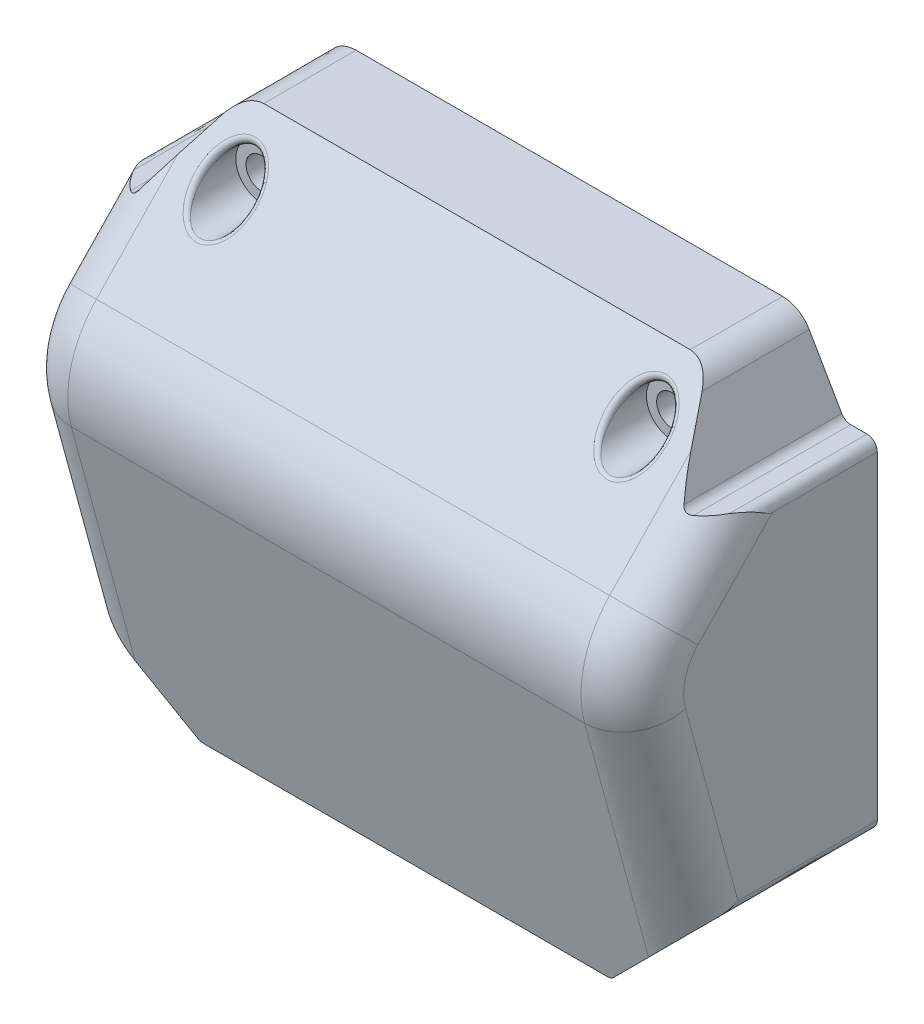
ISO-10303-21;
HEADER;
FILE_DESCRIPTION(('STEP AP214'),'2;1');
FILE_NAME('part.step','',(''),(''),'','','');
FILE_SCHEMA(('AUTOMOTIVE_DESIGN { 1 0 10303 214 1 1 1 1 }'));
ENDSEC;
DATA;
#1=APPLICATION_CONTEXT('core data for automotive mechanical design processes');
#2=APPLICATION_PROTOCOL_DEFINITION('international standard','automotive_design',2000,#1);
#3=PRODUCT_CONTEXT('',#1,'mechanical');
#4=PRODUCT('Part','Part','',(#3));
#5=PRODUCT_RELATED_PRODUCT_CATEGORY('part','',(#4));
#6=PRODUCT_DEFINITION_FORMATION('','',#4);
#7=PRODUCT_DEFINITION_CONTEXT('part definition',#1,'design');
#8=PRODUCT_DEFINITION('design','',#6,#7);
#9=PRODUCT_DEFINITION_SHAPE('','',#8);
#10=(LENGTH_UNIT() NAMED_UNIT(*) SI_UNIT(.MILLI.,.METRE.));
#11=(NAMED_UNIT(*) PLANE_ANGLE_UNIT() SI_UNIT($,.RADIAN.));
#12=(NAMED_UNIT(*) SI_UNIT($,.STERADIAN.) SOLID_ANGLE_UNIT());
#13=UNCERTAINTY_MEASURE_WITH_UNIT(LENGTH_MEASURE(1.E-05),#10,'distance_accuracy_value','');
#14=(GEOMETRIC_REPRESENTATION_CONTEXT(3) GLOBAL_UNCERTAINTY_ASSIGNED_CONTEXT((#13)) GLOBAL_UNIT_ASSIGNED_CONTEXT((#10,
#11,#12)) REPRESENTATION_CONTEXT('',''));
#15=CARTESIAN_POINT('',(0.,0.,0.));
#16=DIRECTION('',(0.,0.,1.));
#17=DIRECTION('',(1.,0.,0.));
#18=AXIS2_PLACEMENT_3D('',#15,#16,#17);
#19=CARTESIAN_POINT('',(-20.,136.833222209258,-2.50000000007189E-05));
#20=DIRECTION('',(0.,0.,1.));
#21=DIRECTION('',(1.,0.,0.));
#22=AXIS2_PLACEMENT_3D('',#19,#20,#21);
#23=CYLINDRICAL_SURFACE('',#22,3.00000000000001);
#24=CARTESIAN_POINT('',(-20.,136.833222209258,0.));
#25=DIRECTION('',(0.,0.,-1.));
#26=DIRECTION('',(-1.,0.,0.));
#27=AXIS2_PLACEMENT_3D('',#24,#25,#26);
#28=CIRCLE('',#27,3.00000000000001);
#29=CARTESIAN_POINT('',(-23.,136.833222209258,0.));
#30=VERTEX_POINT('',#29);
#31=EDGE_CURVE('E301',#30,#30,#28,.F.);
#32=ORIENTED_EDGE('',*,*,#31,.F.);
#33=EDGE_LOOP('',(#32));
#34=FACE_BOUND('',#33,.T.);
#35=CARTESIAN_POINT('',(-20.,136.833222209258,20.));
#36=DIRECTION('',(0.,0.,1.));
#37=DIRECTION('',(1.,0.,0.));
#38=AXIS2_PLACEMENT_3D('',#35,#36,#37);
#39=CIRCLE('',#38,3.00000000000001);
#40=CARTESIAN_POINT('',(-17.,136.833222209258,20.));
#41=VERTEX_POINT('',#40);
#42=EDGE_CURVE('E300',#41,#41,#39,.T.);
#43=ORIENTED_EDGE('',*,*,#42,.T.);
#44=EDGE_LOOP('',(#43));
#45=FACE_BOUND('',#44,.T.);
#46=ADVANCED_FACE('F54',(#34,#45),#23,.F.);
#47=CARTESIAN_POINT('',(-100.,136.833222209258,-2.50000000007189E-05));
#48=DIRECTION('',(0.,0.,1.));
#49=DIRECTION('',(1.,0.,0.));
#50=AXIS2_PLACEMENT_3D('',#47,#48,#49);
#51=CYLINDRICAL_SURFACE('',#50,3.00000000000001);
#52=CARTESIAN_POINT('',(-100.,136.833222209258,0.));
#53=DIRECTION('',(0.,0.,-1.));
#54=DIRECTION('',(-1.,0.,0.));
#55=AXIS2_PLACEMENT_3D('',#52,#53,#54);
#56=CIRCLE('',#55,3.00000000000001);
#57=CARTESIAN_POINT('',(-103.,136.833222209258,0.));
#58=VERTEX_POINT('',#57);
#59=EDGE_CURVE('E308',#58,#58,#56,.T.);
#60=ORIENTED_EDGE('',*,*,#59,.T.);
#61=EDGE_LOOP('',(#60));
#62=FACE_BOUND('',#61,.T.);
#63=CARTESIAN_POINT('',(-100.,136.833222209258,20.));
#64=DIRECTION('',(0.,0.,1.));
#65=DIRECTION('',(1.,0.,0.));
#66=AXIS2_PLACEMENT_3D('',#63,#64,#65);
#67=CIRCLE('',#66,3.00000000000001);
#68=CARTESIAN_POINT('',(-97.,136.833222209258,20.));
#69=VERTEX_POINT('',#68);
#70=EDGE_CURVE('E307',#69,#69,#67,.F.);
#71=ORIENTED_EDGE('',*,*,#70,.F.);
#72=EDGE_LOOP('',(#71));
#73=FACE_BOUND('',#72,.T.);
#74=ADVANCED_FACE('F350',(#62,#73),#51,.F.);
#75=CARTESIAN_POINT('',(-120.,129.833222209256,50.));
#76=DIRECTION('',(1.,0.,0.));
#77=DIRECTION('',(0.,1.,0.));
#78=AXIS2_PLACEMENT_3D('',#75,#76,#77);
#79=PLANE('',#78);
#80=DIRECTION('',(0.,0.,-1.));
#81=VECTOR('',#80,1.);
#82=CARTESIAN_POINT('',(-120.,67.6616493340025,50.));
#83=LINE('',#82,#81);
#84=CARTESIAN_POINT('',(-120.,67.6616493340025,27.1589678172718));
#85=VERTEX_POINT('',#84);
#86=CARTESIAN_POINT('',(-120.,67.6616493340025,0.));
#87=VERTEX_POINT('',#86);
#88=EDGE_CURVE('E398',#85,#87,#83,.T.);
#89=ORIENTED_EDGE('',*,*,#88,.F.);
#90=DIRECTION('',(0.,0.964881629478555,0.262685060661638));
#91=VECTOR('',#90,1.);
#92=CARTESIAN_POINT('',(-120.,105.187092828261,37.3751156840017));
#93=LINE('',#92,#91);
#94=CARTESIAN_POINT('',(-120.,105.187092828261,37.3751156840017));
#95=VERTEX_POINT('',#94);
#96=EDGE_CURVE('E953',#85,#95,#93,.T.);
#97=ORIENTED_EDGE('',*,*,#96,.T.);
#98=CARTESIAN_POINT('',(-120.,107.813943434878,27.7262993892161));
#99=DIRECTION('',(1.,0.,0.));
#100=DIRECTION('',(0.,1.,0.));
#101=AXIS2_PLACEMENT_3D('',#98,#99,#100);
#102=CIRCLE('',#101,10.);
#103=CARTESIAN_POINT('',(-120.,114.739294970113,34.9401406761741));
#104=VERTEX_POINT('',#103);
#105=EDGE_CURVE('E955',#95,#104,#102,.F.);
#106=ORIENTED_EDGE('',*,*,#105,.T.);
#107=DIRECTION('',(0.,-0.7213841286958,0.692535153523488));
#108=VECTOR('',#107,1.);
#109=CARTESIAN_POINT('',(-120.,115.070437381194,34.6222410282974));
#110=LINE('',#109,#108);
#111=CARTESIAN_POINT('',(-120.,129.833222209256,20.4498368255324));
#112=VERTEX_POINT('',#111);
#113=EDGE_CURVE('E908',#104,#112,#110,.F.);
#114=ORIENTED_EDGE('',*,*,#113,.T.);
#115=DIRECTION('',(0.,0.,-1.));
#116=VECTOR('',#115,1.);
#117=CARTESIAN_POINT('',(-120.,129.833222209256,50.));
#118=LINE('',#117,#116);
#119=CARTESIAN_POINT('',(-120.,129.833222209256,0.));
#120=VERTEX_POINT('',#119);
#121=EDGE_CURVE('E618',#112,#120,#118,.T.);
#122=ORIENTED_EDGE('',*,*,#121,.T.);
#123=DIRECTION('',(0.,-1.,0.));
#124=VECTOR('',#123,1.);
#125=CARTESIAN_POINT('',(-120.,129.833222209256,0.));
#126=LINE('',#125,#124);
#127=EDGE_CURVE('E778',#120,#87,#126,.T.);
#128=ORIENTED_EDGE('',*,*,#127,.T.);
#129=EDGE_LOOP('',(#89,#97,#106,#114,#122,#128));
#130=FACE_BOUND('',#129,.T.);
#131=ADVANCED_FACE('F422',(#130),#79,.F.);
#132=CARTESIAN_POINT('',(-120.,67.6616493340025,50.));
#133=CARTESIAN_POINT('',(-119.988411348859,66.8380223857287,50.));
#134=CARTESIAN_POINT('',(-119.414213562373,66.2474357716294,50.));
#135=B_SPLINE_CURVE_WITH_KNOTS('',2,(#132,#133,#134),.UNSPECIFIED.,.F.,.F.,(3,3),(0.,1.),.UNSPECIFIED.);
#136=DIRECTION('',(0.,0.,-1.));
#137=VECTOR('',#136,1.);
#138=SURFACE_OF_LINEAR_EXTRUSION('',#135,#137);
#139=DIRECTION('',(0.,0.,-1.));
#140=VECTOR('',#139,1.);
#141=CARTESIAN_POINT('',(-119.414213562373,66.2474357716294,50.));
#142=LINE('',#141,#140);
#143=CARTESIAN_POINT('',(-119.414213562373,66.2474357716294,30.2690210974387));
#144=VERTEX_POINT('',#143);
#145=CARTESIAN_POINT('',(-119.414213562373,66.2474357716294,0.));
#146=VERTEX_POINT('',#145);
#147=EDGE_CURVE('E383',#144,#146,#142,.T.);
#148=ORIENTED_EDGE('',*,*,#147,.F.);
#149=CARTESIAN_POINT('',(-119.414213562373,66.2474357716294,30.2690210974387));
#150=CARTESIAN_POINT('',(-119.461960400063,66.2965407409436,30.1442573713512));
#151=CARTESIAN_POINT('',(-119.506834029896,66.3469085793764,30.0188918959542));
#152=CARTESIAN_POINT('',(-119.590770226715,66.4501203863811,29.7672905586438));
#153=CARTESIAN_POINT('',(-119.629834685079,66.5029635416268,29.6410549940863));
#154=CARTESIAN_POINT('',(-119.702118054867,66.6111068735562,29.3879685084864));
#155=CARTESIAN_POINT('',(-119.735337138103,66.6664069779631,29.2611176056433));
#156=CARTESIAN_POINT('',(-119.795913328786,66.7794400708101,29.0070433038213));
#157=CARTESIAN_POINT('',(-119.823268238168,66.8371739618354,28.8798197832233));
#158=CARTESIAN_POINT('',(-119.872994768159,66.9571886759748,28.6206062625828));
#159=CARTESIAN_POINT('',(-119.895143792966,67.0195587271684,28.4886145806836));
#160=CARTESIAN_POINT('',(-119.923607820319,67.1148984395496,28.2909227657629));
#161=CARTESIAN_POINT('',(-119.932298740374,67.1469557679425,28.2251146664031));
#162=CARTESIAN_POINT('',(-119.948105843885,67.2116608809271,28.0935990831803));
#163=CARTESIAN_POINT('',(-119.955222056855,67.2443086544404,28.0278915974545));
#164=CARTESIAN_POINT('',(-119.965986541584,67.3002952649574,27.9162764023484));
#165=CARTESIAN_POINT('',(-119.970035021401,67.323492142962,27.8703354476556));
#166=CARTESIAN_POINT('',(-119.977363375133,67.3701411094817,27.7785214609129));
#167=CARTESIAN_POINT('',(-119.980643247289,67.3935931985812,27.7326484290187));
#168=CARTESIAN_POINT('',(-119.986449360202,67.4408100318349,27.6407552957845));
#169=CARTESIAN_POINT('',(-119.988972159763,67.4645757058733,27.5947354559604));
#170=CARTESIAN_POINT('',(-119.993246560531,67.5122292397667,27.5027267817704));
#171=CARTESIAN_POINT('',(-119.994998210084,67.536117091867,27.4567379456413));
#172=CARTESIAN_POINT('',(-119.996797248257,67.5672917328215,27.3960848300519));
#173=CARTESIAN_POINT('',(-119.997190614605,67.5747525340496,27.3815206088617));
#174=CARTESIAN_POINT('',(-119.997900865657,67.5895763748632,27.3523390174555));
#175=CARTESIAN_POINT('',(-119.998217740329,67.5969394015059,27.3377216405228));
#176=CARTESIAN_POINT('',(-119.998772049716,67.611377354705,27.3085258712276));
#177=CARTESIAN_POINT('',(-119.999010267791,67.6184544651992,27.2939486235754));
#178=CARTESIAN_POINT('',(-119.999411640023,67.6321240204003,27.2645728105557));
#179=CARTESIAN_POINT('',(-119.999574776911,67.638716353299,27.2497741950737));
#180=CARTESIAN_POINT('',(-119.999799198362,67.6493190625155,27.2226032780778));
#181=CARTESIAN_POINT('',(-119.999874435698,67.6535819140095,27.2103482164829));
#182=CARTESIAN_POINT('',(-119.999975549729,67.6597860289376,27.185167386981));
#183=CARTESIAN_POINT('',(-120.00000087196,67.6617011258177,27.1722357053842));
#184=CARTESIAN_POINT('',(-120.,67.6616493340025,27.1589678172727));
#185=B_SPLINE_CURVE_WITH_KNOTS('',3,(#149,#150,#151,#152,#153,#154,#155,#156,#157,#158,#159,
#160,#161,#162,#163,#164,#165,#166,#167,#168,#169,#170,#171,#172,#173,#174,#175,#176,#177,#178,
#179,#180,#181,#182,#183,#184),.UNSPECIFIED.,.F.,.F.,(4,2,2,2,2,2,2,2,2,2,2,2,2,2,2,2,2,4),(0.,
0.426944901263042,0.853750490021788,1.2805435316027,1.70749626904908,2.1502928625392,
2.37142265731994,2.59254830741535,2.74741507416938,2.90228219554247,3.05784294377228,
3.2133939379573,3.26249931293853,3.31161112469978,3.36021792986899,3.40883591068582,
3.4475851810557,3.48676251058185),.UNSPECIFIED.);
#186=EDGE_CURVE('E403',#144,#85,#185,.T.);
#187=ORIENTED_EDGE('',*,*,#186,.T.);
#188=ORIENTED_EDGE('',*,*,#88,.T.);
#189=CARTESIAN_POINT('',(-120.,67.6616493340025,0.));
#190=CARTESIAN_POINT('',(-119.988411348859,66.8380223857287,0.));
#191=CARTESIAN_POINT('',(-119.414213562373,66.2474357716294,0.));
#192=B_SPLINE_CURVE_WITH_KNOTS('',2,(#189,#190,#191),.UNSPECIFIED.,.F.,.F.,(3,3),(0.,1.),.UNSPECIFIED.);
#193=EDGE_CURVE('E781',#87,#146,#192,.T.);
#194=ORIENTED_EDGE('',*,*,#193,.T.);
#195=EDGE_LOOP('',(#148,#187,#188,#194));
#196=FACE_BOUND('',#195,.T.);
#197=ADVANCED_FACE('F415',(#196),#138,.F.);
#198=CARTESIAN_POINT('',(-119.414213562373,66.2474357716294,50.));
#199=DIRECTION('',(0.707106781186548,0.707106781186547,0.));
#200=DIRECTION('',(-0.707106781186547,0.707106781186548,0.));
#201=AXIS2_PLACEMENT_3D('',#198,#199,#200);
#202=PLANE('',#201);
#203=DIRECTION('',(-0.694357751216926,0.694357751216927,0.18903604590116));
#204=VECTOR('',#203,1.);
#205=CARTESIAN_POINT('',(-82.8823953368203,29.7156175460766,27.1922820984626));
#206=LINE('',#205,#204);
#207=CARTESIAN_POINT('',(-100.585786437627,47.419008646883,32.0119576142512));
#208=VERTEX_POINT('',#207);
#209=CARTESIAN_POINT('',(-110.,56.8332222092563,34.5749385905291));
#210=VERTEX_POINT('',#209);
#211=EDGE_CURVE('E364',#208,#210,#206,.T.);
#212=ORIENTED_EDGE('',*,*,#211,.T.);
#213=CARTESIAN_POINT('',(-110.,56.8332222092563,24.2109730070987));
#214=DIRECTION('',(0.707106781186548,0.707106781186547,0.));
#215=DIRECTION('',(0.659886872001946,-0.659886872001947,-0.359302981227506));
#216=AXIS2_PLACEMENT_3D('',#213,#214,#215);
#217=ELLIPSE('',#216,14.6568606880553,10.);
#218=EDGE_CURVE('E401',#210,#144,#217,.F.);
#219=ORIENTED_EDGE('',*,*,#218,.T.);
#220=ORIENTED_EDGE('',*,*,#147,.T.);
#221=DIRECTION('',(0.707106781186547,-0.707106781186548,0.));
#222=VECTOR('',#221,1.);
#223=CARTESIAN_POINT('',(-119.414213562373,66.2474357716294,0.));
#224=LINE('',#223,#222);
#225=CARTESIAN_POINT('',(-100.585786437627,47.419008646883,0.));
#226=VERTEX_POINT('',#225);
#227=EDGE_CURVE('E795',#146,#226,#224,.T.);
#228=ORIENTED_EDGE('',*,*,#227,.T.);
#229=DIRECTION('',(0.,0.,-1.));
#230=VECTOR('',#229,1.);
#231=CARTESIAN_POINT('',(-100.585786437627,47.419008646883,50.));
#232=LINE('',#231,#230);
#233=EDGE_CURVE('E379',#208,#226,#232,.T.);
#234=ORIENTED_EDGE('',*,*,#233,.F.);
#235=EDGE_LOOP('',(#212,#219,#220,#228,#234));
#236=FACE_BOUND('',#235,.T.);
#237=ADVANCED_FACE('F421',(#236),#202,.F.);
#238=CARTESIAN_POINT('',(-100.585786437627,47.419008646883,50.));
#239=CARTESIAN_POINT('',(-99.9951998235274,46.8448108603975,50.));
#240=CARTESIAN_POINT('',(-99.1715728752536,46.8332222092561,50.));
#241=B_SPLINE_CURVE_WITH_KNOTS('',2,(#238,#239,#240),.UNSPECIFIED.,.F.,.F.,(3,3),(0.,1.),.UNSPECIFIED.);
#242=DIRECTION('',(0.,0.,-1.));
#243=VECTOR('',#242,1.);
#244=SURFACE_OF_LINEAR_EXTRUSION('',#241,#243);
#245=CARTESIAN_POINT('',(-99.1715728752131,46.8332222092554,31.8524796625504));
#246=CARTESIAN_POINT('',(-99.240561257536,46.8341557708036,31.8527338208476));
#247=CARTESIAN_POINT('',(-99.3095699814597,46.8381383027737,31.8538180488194));
#248=CARTESIAN_POINT('',(-99.4469106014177,46.8525987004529,31.8577548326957));
#249=CARTESIAN_POINT('',(-99.515241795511,46.8630827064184,31.8606090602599));
#250=CARTESIAN_POINT('',(-99.6352111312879,46.8878165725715,31.8673427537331));
#251=CARTESIAN_POINT('',(-99.6871537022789,46.900693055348,31.8708483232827));
#252=CARTESIAN_POINT('',(-99.789743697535,46.930631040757,31.8789988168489));
#253=CARTESIAN_POINT('',(-99.8403908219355,46.9476935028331,31.8836440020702));
#254=CARTESIAN_POINT('',(-99.9400116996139,46.9859377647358,31.8940558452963));
#255=CARTESIAN_POINT('',(-99.9889847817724,47.0071211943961,31.8998229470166));
#256=CARTESIAN_POINT('',(-100.084906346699,47.0534030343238,31.9124229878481));
#257=CARTESIAN_POINT('',(-100.131854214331,47.078502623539,31.9192562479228));
#258=CARTESIAN_POINT('',(-100.252148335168,47.1492000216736,31.9385033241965));
#259=CARTESIAN_POINT('',(-100.323631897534,47.1977970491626,31.9517336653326));
#260=CARTESIAN_POINT('',(-100.42575262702,47.2766215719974,31.9731933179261));
#261=CARTESIAN_POINT('',(-100.458932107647,47.3038747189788,31.9806128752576));
#262=CARTESIAN_POINT('',(-100.523609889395,47.3601564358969,31.9959353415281));
#263=CARTESIAN_POINT('',(-100.555108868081,47.3891842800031,32.0038380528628));
#264=CARTESIAN_POINT('',(-100.585786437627,47.419008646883,32.0119576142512));
#265=B_SPLINE_CURVE_WITH_KNOTS('',3,(#245,#246,#247,#248,#249,#250,#251,#252,#253,#254,#255,
#256,#257,#258,#259,#260,#261,#262,#263,#264),.UNSPECIFIED.,.F.,.F.,(4,2,2,2,2,2,2,2,2,4),(0.,
0.207017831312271,0.414231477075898,0.57493674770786,0.735678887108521,0.89648472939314,
1.057339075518,1.3188402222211,1.4495055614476,1.58011781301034),.UNSPECIFIED.);
#266=CARTESIAN_POINT('',(-99.1715728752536,46.8332222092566,31.8524796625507));
#267=VERTEX_POINT('',#266);
#268=EDGE_CURVE('E360',#267,#208,#265,.T.);
#269=ORIENTED_EDGE('',*,*,#268,.T.);
#270=ORIENTED_EDGE('',*,*,#233,.T.);
#271=CARTESIAN_POINT('',(-100.585786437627,47.419008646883,0.));
#272=CARTESIAN_POINT('',(-99.9951998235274,46.8448108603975,0.));
#273=CARTESIAN_POINT('',(-99.1715728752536,46.8332222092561,0.));
#274=B_SPLINE_CURVE_WITH_KNOTS('',2,(#271,#272,#273),.UNSPECIFIED.,.F.,.F.,(3,3),(0.,1.),.UNSPECIFIED.);
#275=CARTESIAN_POINT('',(-99.1715728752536,46.8332222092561,0.));
#276=VERTEX_POINT('',#275);
#277=EDGE_CURVE('E801',#226,#276,#274,.T.);
#278=ORIENTED_EDGE('',*,*,#277,.T.);
#279=DIRECTION('',(0.,0.,-1.));
#280=VECTOR('',#279,1.);
#281=CARTESIAN_POINT('',(-99.1715728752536,46.8332222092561,50.));
#282=LINE('',#281,#280);
#283=EDGE_CURVE('E384',#267,#276,#282,.T.);
#284=ORIENTED_EDGE('',*,*,#283,.F.);
#285=EDGE_LOOP('',(#269,#270,#278,#284));
#286=FACE_BOUND('',#285,.T.);
#287=ADVANCED_FACE('F448',(#286),#244,.F.);
#288=CARTESIAN_POINT('',(-99.1715728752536,46.8332222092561,50.));
#289=DIRECTION('',(0.,1.,0.));
#290=DIRECTION('',(-1.,0.,0.));
#291=AXIS2_PLACEMENT_3D('',#288,#289,#290);
#292=PLANE('',#291);
#293=DIRECTION('',(1.,0.,0.));
#294=VECTOR('',#293,1.);
#295=CARTESIAN_POINT('',(-120.001000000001,46.8332222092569,31.8524796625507));
#296=LINE('',#295,#294);
#297=CARTESIAN_POINT('',(-20.8284271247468,46.8332222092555,31.8524796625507));
#298=VERTEX_POINT('',#297);
#299=EDGE_CURVE('E362',#267,#298,#296,.T.);
#300=ORIENTED_EDGE('',*,*,#299,.F.);
#301=ORIENTED_EDGE('',*,*,#283,.T.);
#302=DIRECTION('',(1.,0.,0.));
#303=VECTOR('',#302,1.);
#304=CARTESIAN_POINT('',(-99.1715728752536,46.8332222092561,0.));
#305=LINE('',#304,#303);
#306=CARTESIAN_POINT('',(-20.8284271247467,46.8332222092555,0.));
#307=VERTEX_POINT('',#306);
#308=EDGE_CURVE('E806',#276,#307,#305,.T.);
#309=ORIENTED_EDGE('',*,*,#308,.T.);
#310=DIRECTION('',(0.,0.,-1.));
#311=VECTOR('',#310,1.);
#312=CARTESIAN_POINT('',(-20.8284271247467,46.8332222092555,50.));
#313=LINE('',#312,#311);
#314=EDGE_CURVE('E928',#298,#307,#313,.T.);
#315=ORIENTED_EDGE('',*,*,#314,.F.);
#316=EDGE_LOOP('',(#300,#301,#309,#315));
#317=FACE_BOUND('',#316,.T.);
#318=ADVANCED_FACE('F451',(#317),#292,.F.);
#319=CARTESIAN_POINT('',(-20.8284271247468,46.8332222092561,50.));
#320=CARTESIAN_POINT('',(-20.0048001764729,46.8448108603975,50.));
#321=CARTESIAN_POINT('',(-19.4142135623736,47.419008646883,50.));
#322=B_SPLINE_CURVE_WITH_KNOTS('',2,(#319,#320,#321),.UNSPECIFIED.,.F.,.F.,(3,3),(0.,1.),.UNSPECIFIED.);
#323=DIRECTION('',(0.,0.,-1.));
#324=VECTOR('',#323,1.);
#325=SURFACE_OF_LINEAR_EXTRUSION('',#322,#324);
#326=CARTESIAN_POINT('',(-19.4142135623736,47.419008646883,32.0119576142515));
#327=CARTESIAN_POINT('',(-19.4627358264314,47.3717930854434,31.9991033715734));
#328=CARTESIAN_POINT('',(-19.513418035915,47.3265522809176,31.9867867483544));
#329=CARTESIAN_POINT('',(-19.6190549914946,47.2407529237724,31.9634282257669));
#330=CARTESIAN_POINT('',(-19.6740189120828,47.2002049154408,31.9523891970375));
#331=CARTESIAN_POINT('',(-19.7758265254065,47.1327736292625,31.9340313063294));
#332=CARTESIAN_POINT('',(-19.8219073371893,47.1048191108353,31.9264208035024));
#333=CARTESIAN_POINT('',(-19.9163376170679,47.0527499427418,31.9122451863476));
#334=CARTESIAN_POINT('',(-19.9646866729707,47.0286345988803,31.9056798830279));
#335=CARTESIAN_POINT('',(-20.0633637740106,46.9845168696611,31.8936690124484));
#336=CARTESIAN_POINT('',(-20.1136917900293,46.9645144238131,31.8882234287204));
#337=CARTESIAN_POINT('',(-20.2159291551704,46.9287861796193,31.8784965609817));
#338=CARTESIAN_POINT('',(-20.2678381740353,46.9130594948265,31.8742150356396));
#339=CARTESIAN_POINT('',(-20.4030955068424,46.878106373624,31.8646991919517));
#340=CARTESIAN_POINT('',(-20.4873557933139,46.8620688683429,31.8603330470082));
#341=CARTESIAN_POINT('',(-20.6147230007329,46.8456882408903,31.8558734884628));
#342=CARTESIAN_POINT('',(-20.6573574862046,46.8415071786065,31.8547352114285));
#343=CARTESIAN_POINT('',(-20.7427954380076,46.8355761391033,31.8531205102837));
#344=CARTESIAN_POINT('',(-20.785598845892,46.8338253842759,31.8526438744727));
#345=CARTESIAN_POINT('',(-20.8284271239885,46.8332222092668,31.8524796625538));
#346=B_SPLINE_CURVE_WITH_KNOTS('',3,(#326,#327,#328,#329,#330,#331,#332,#333,#334,#335,#336,
#337,#338,#339,#340,#341,#342,#343,#344,#345),.UNSPECIFIED.,.F.,.F.,(4,2,2,2,2,2,2,2,2,4),(0.,
0.206781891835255,0.414019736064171,0.577131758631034,0.740214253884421,0.903294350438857,
1.06634061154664,1.32315694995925,1.45166023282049,1.58012238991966),.UNSPECIFIED.);
#347=CARTESIAN_POINT('',(-19.414213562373,47.419008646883,32.0119576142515));
#348=VERTEX_POINT('',#347);
#349=EDGE_CURVE('E339',#348,#298,#346,.T.);
#350=ORIENTED_EDGE('',*,*,#349,.T.);
#351=ORIENTED_EDGE('',*,*,#314,.T.);
#352=CARTESIAN_POINT('',(-20.8284271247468,46.8332222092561,0.));
#353=CARTESIAN_POINT('',(-20.0048001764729,46.8448108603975,0.));
#354=CARTESIAN_POINT('',(-19.4142135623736,47.419008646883,0.));
#355=B_SPLINE_CURVE_WITH_KNOTS('',2,(#352,#353,#354),.UNSPECIFIED.,.F.,.F.,(3,3),(0.,1.),.UNSPECIFIED.);
#356=CARTESIAN_POINT('',(-19.4142135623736,47.419008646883,0.));
#357=VERTEX_POINT('',#356);
#358=EDGE_CURVE('E812',#307,#357,#355,.T.);
#359=ORIENTED_EDGE('',*,*,#358,.T.);
#360=DIRECTION('',(0.,0.,-1.));
#361=VECTOR('',#360,1.);
#362=CARTESIAN_POINT('',(-19.4142135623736,47.419008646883,50.));
#363=LINE('',#362,#361);
#364=EDGE_CURVE('E670',#348,#357,#363,.T.);
#365=ORIENTED_EDGE('',*,*,#364,.F.);
#366=EDGE_LOOP('',(#350,#351,#359,#365));
#367=FACE_BOUND('',#366,.T.);
#368=ADVANCED_FACE('F455',(#367),#325,.F.);
#369=CARTESIAN_POINT('',(-0.585786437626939,66.2474357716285,50.));
#370=DIRECTION('',(-0.707106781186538,0.707106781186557,0.));
#371=DIRECTION('',(-0.707106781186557,-0.707106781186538,0.));
#372=AXIS2_PLACEMENT_3D('',#369,#370,#371);
#373=PLANE('',#372);
#374=DIRECTION('',(0.,0.,-1.));
#375=VECTOR('',#374,1.);
#376=CARTESIAN_POINT('',(-0.585786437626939,66.2474357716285,50.));
#377=LINE('',#376,#375);
#378=CARTESIAN_POINT('',(-0.585786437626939,66.2474357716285,30.2690210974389));
#379=VERTEX_POINT('',#378);
#380=CARTESIAN_POINT('',(-0.585786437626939,66.2474357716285,0.));
#381=VERTEX_POINT('',#380);
#382=EDGE_CURVE('E668',#379,#381,#377,.T.);
#383=ORIENTED_EDGE('',*,*,#382,.F.);
#384=CARTESIAN_POINT('',(-10.0000000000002,56.8332222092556,24.2109730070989));
#385=DIRECTION('',(-0.707106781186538,0.707106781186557,0.));
#386=DIRECTION('',(0.659886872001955,0.659886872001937,0.359302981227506));
#387=AXIS2_PLACEMENT_3D('',#384,#385,#386);
#388=ELLIPSE('',#387,14.6568606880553,10.);
#389=CARTESIAN_POINT('',(-10.0000000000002,56.8332222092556,34.5749385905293));
#390=VERTEX_POINT('',#389);
#391=EDGE_CURVE('E678',#379,#390,#388,.F.);
#392=ORIENTED_EDGE('',*,*,#391,.T.);
#393=DIRECTION('',(-0.694357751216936,-0.694357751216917,-0.189036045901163));
#394=VECTOR('',#393,1.);
#395=CARTESIAN_POINT('',(-94.9744913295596,-28.1412691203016,11.4409823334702));
#396=LINE('',#395,#394);
#397=EDGE_CURVE('E311',#390,#348,#396,.T.);
#398=ORIENTED_EDGE('',*,*,#397,.T.);
#399=ORIENTED_EDGE('',*,*,#364,.T.);
#400=DIRECTION('',(0.707106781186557,0.707106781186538,0.));
#401=VECTOR('',#400,1.);
#402=CARTESIAN_POINT('',(-0.585786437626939,66.2474357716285,0.));
#403=LINE('',#402,#401);
#404=EDGE_CURVE('E817',#357,#381,#403,.T.);
#405=ORIENTED_EDGE('',*,*,#404,.T.);
#406=EDGE_LOOP('',(#383,#392,#398,#399,#405));
#407=FACE_BOUND('',#406,.T.);
#408=ADVANCED_FACE('F459',(#407),#373,.F.);
#409=CARTESIAN_POINT('',(-0.585786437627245,66.2474357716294,50.));
#410=CARTESIAN_POINT('',(-0.0115886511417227,66.8380223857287,50.));
#411=CARTESIAN_POINT('',(-3.60822483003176E-13,67.6616493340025,50.));
#412=B_SPLINE_CURVE_WITH_KNOTS('',2,(#409,#410,#411),.UNSPECIFIED.,.F.,.F.,(3,3),(0.,1.),.UNSPECIFIED.);
#413=DIRECTION('',(0.,0.,-1.));
#414=VECTOR('',#413,1.);
#415=SURFACE_OF_LINEAR_EXTRUSION('',#412,#414);
#416=DIRECTION('',(0.,0.,-1.));
#417=VECTOR('',#416,1.);
#418=CARTESIAN_POINT('',(-3.60822483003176E-13,67.6616493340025,50.));
#419=LINE('',#418,#417);
#420=CARTESIAN_POINT('',(-3.60822483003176E-13,67.6616493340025,27.1589678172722));
#421=VERTEX_POINT('',#420);
#422=CARTESIAN_POINT('',(-3.60822483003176E-13,67.6616493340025,0.));
#423=VERTEX_POINT('',#422);
#424=EDGE_CURVE('E511',#421,#423,#419,.T.);
#425=ORIENTED_EDGE('',*,*,#424,.F.);
#426=CARTESIAN_POINT('',(0.,67.6616493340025,27.1589678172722));
#427=CARTESIAN_POINT('',(1.60287017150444E-07,67.6616839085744,27.1656466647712));
#428=CARTESIAN_POINT('',(-6.20181062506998E-06,67.6612049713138,27.1723014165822));
#429=CARTESIAN_POINT('',(-3.2039302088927E-05,67.6594285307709,27.185443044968));
#430=CARTESIAN_POINT('',(-5.13948459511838E-05,67.6581385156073,27.1919308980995));
#431=CARTESIAN_POINT('',(-0.000103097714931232,67.6549528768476,27.2046979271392));
#432=CARTESIAN_POINT('',(-0.000135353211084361,67.6530615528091,27.2109782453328));
#433=CARTESIAN_POINT('',(-0.000212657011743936,67.6488875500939,27.2234235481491));
#434=CARTESIAN_POINT('',(-0.000257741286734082,67.6466037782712,27.2295881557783));
#435=CARTESIAN_POINT('',(-0.000442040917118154,67.6379958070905,27.2515398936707));
#436=CARTESIAN_POINT('',(-0.000617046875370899,67.6310144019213,27.2670623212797));
#437=CARTESIAN_POINT('',(-0.00104977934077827,67.6165761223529,27.2978657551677));
#438=CARTESIAN_POINT('',(-0.00130750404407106,67.6091192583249,27.3131467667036));
#439=CARTESIAN_POINT('',(-0.00190564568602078,67.5939900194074,27.3436064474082));
#440=CARTESIAN_POINT('',(-0.00224607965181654,67.5863176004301,27.3587850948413));
#441=CARTESIAN_POINT('',(-0.00301480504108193,67.5707765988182,27.3892994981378));
#442=CARTESIAN_POINT('',(-0.00344423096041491,67.5629067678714,27.4046345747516));
#443=CARTESIAN_POINT('',(-0.00438790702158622,67.5471283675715,27.4352751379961));
#444=CARTESIAN_POINT('',(-0.00490212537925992,67.5392198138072,27.4505806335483));
#445=CARTESIAN_POINT('',(-0.00601550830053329,67.5233892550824,27.4811788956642));
#446=CARTESIAN_POINT('',(-0.00661466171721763,67.5154672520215,27.4964716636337));
#447=CARTESIAN_POINT('',(-0.0098086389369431,67.4760474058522,27.572585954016));
#448=CARTESIAN_POINT('',(-0.0130340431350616,67.4445810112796,27.633399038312));
#449=CARTESIAN_POINT('',(-0.0208373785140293,67.3820391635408,27.7551552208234));
#450=CARTESIAN_POINT('',(-0.0254155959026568,67.3509637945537,27.8160983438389));
#451=CARTESIAN_POINT('',(-0.0359293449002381,67.2892732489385,27.9381051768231));
#452=CARTESIAN_POINT('',(-0.0418649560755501,67.2586580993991,27.9991688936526));
#453=CARTESIAN_POINT('',(-0.0550644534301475,67.198077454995,28.1210959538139));
#454=CARTESIAN_POINT('',(-0.0623216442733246,67.16810950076,28.1819588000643));
#455=CARTESIAN_POINT('',(-0.0781859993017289,67.1086873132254,28.3037562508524));
#456=CARTESIAN_POINT('',(-0.0867931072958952,67.0792330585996,28.3646908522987));
#457=CARTESIAN_POINT('',(-0.105358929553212,67.0208510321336,28.4866033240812));
#458=CARTESIAN_POINT('',(-0.115317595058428,66.9919232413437,28.5475811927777));
#459=CARTESIAN_POINT('',(-0.138027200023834,66.930723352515,28.6778066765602));
#460=CARTESIAN_POINT('',(-0.150973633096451,66.8985284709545,28.7470566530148));
#461=CARTESIAN_POINT('',(-0.178609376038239,66.8348406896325,28.8855281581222));
#462=CARTESIAN_POINT('',(-0.193298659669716,66.8033477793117,28.9547496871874));
#463=CARTESIAN_POINT('',(-0.240010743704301,66.7098724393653,29.1624447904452));
#464=CARTESIAN_POINT('',(-0.274655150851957,66.6489544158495,29.3008189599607));
#465=CARTESIAN_POINT('',(-0.351254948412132,66.529467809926,29.5782047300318));
#466=CARTESIAN_POINT('',(-0.393276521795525,66.470926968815,29.7172099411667));
#467=CARTESIAN_POINT('',(-0.484306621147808,66.35689571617,29.9940581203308));
#468=CARTESIAN_POINT('',(-0.533310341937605,66.3014032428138,30.1319018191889));
#469=CARTESIAN_POINT('',(-0.585786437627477,66.2474357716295,30.2690210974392));
#470=B_SPLINE_CURVE_WITH_KNOTS('',3,(#426,#427,#428,#429,#430,#431,#432,#433,#434,#435,#436,
#437,#438,#439,#440,#441,#442,#443,#444,#445,#446,#447,#448,#449,#450,#451,#452,#453,#454,#455,
#456,#457,#458,#459,#460,#461,#462,#463,#464,#465,#466,#467,#468,#469),.UNSPECIFIED.,.F.,.F.,(4,
2,2,2,2,2,2,2,2,2,2,2,2,2,2,2,2,2,2,2,2,4),(0.,0.0199792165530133,0.039776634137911,
0.0594355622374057,0.0791501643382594,0.130170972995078,0.181190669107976,0.232220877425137,
0.283946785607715,0.335653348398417,0.387353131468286,0.592980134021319,0.798650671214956,
1.004333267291,1.20900145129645,1.41366111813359,1.61831340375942,1.85066182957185,
2.08300675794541,2.54813207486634,3.01766596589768,3.48687826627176),.UNSPECIFIED.);
#471=EDGE_CURVE('E673',#421,#379,#470,.T.);
#472=ORIENTED_EDGE('',*,*,#471,.T.);
#473=ORIENTED_EDGE('',*,*,#382,.T.);
#474=CARTESIAN_POINT('',(-0.585786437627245,66.2474357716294,0.));
#475=CARTESIAN_POINT('',(-0.0115886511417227,66.8380223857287,0.));
#476=CARTESIAN_POINT('',(-3.60822483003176E-13,67.6616493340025,0.));
#477=B_SPLINE_CURVE_WITH_KNOTS('',2,(#474,#475,#476),.UNSPECIFIED.,.F.,.F.,(3,3),(0.,1.),.UNSPECIFIED.);
#478=EDGE_CURVE('E823',#381,#423,#477,.T.);
#479=ORIENTED_EDGE('',*,*,#478,.T.);
#480=EDGE_LOOP('',(#425,#472,#473,#479));
#481=FACE_BOUND('',#480,.T.);
#482=ADVANCED_FACE('F463',(#481),#415,.F.);
#483=CARTESIAN_POINT('',(8.74300631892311E-13,129.833222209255,50.));
#484=DIRECTION('',(-1.,0.,0.));
#485=DIRECTION('',(0.,-1.,0.));
#486=AXIS2_PLACEMENT_3D('',#483,#484,#485);
#487=PLANE('',#486);
#488=DIRECTION('',(0.,0.,-1.));
#489=VECTOR('',#488,1.);
#490=CARTESIAN_POINT('',(8.74300631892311E-13,129.833222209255,50.));
#491=LINE('',#490,#489);
#492=CARTESIAN_POINT('',(8.74300631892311E-13,129.833222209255,20.4498368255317));
#493=VERTEX_POINT('',#492);
#494=CARTESIAN_POINT('',(8.74300631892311E-13,129.833222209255,0.));
#495=VERTEX_POINT('',#494);
#496=EDGE_CURVE('E508',#493,#495,#491,.T.);
#497=ORIENTED_EDGE('',*,*,#496,.F.);
#498=DIRECTION('',(0.,0.7213841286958,-0.692535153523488));
#499=VECTOR('',#498,1.);
#500=CARTESIAN_POINT('',(6.6340059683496E-13,115.070437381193,34.622241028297));
#501=LINE('',#500,#499);
#502=CARTESIAN_POINT('',(6.58669921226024E-13,114.739294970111,34.9401406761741));
#503=VERTEX_POINT('',#502);
#504=EDGE_CURVE('E671',#493,#503,#501,.F.);
#505=ORIENTED_EDGE('',*,*,#504,.T.);
#506=CARTESIAN_POINT('',(5.60315682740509E-13,107.813943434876,27.7262993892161));
#507=DIRECTION('',(-1.,0.,0.));
#508=DIRECTION('',(0.,-1.,0.));
#509=AXIS2_PLACEMENT_3D('',#506,#507,#508);
#510=CIRCLE('',#509,10.);
#511=CARTESIAN_POINT('',(5.22207878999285E-13,105.18709282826,37.3751156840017));
#512=VERTEX_POINT('',#511);
#513=EDGE_CURVE('E506',#503,#512,#510,.F.);
#514=ORIENTED_EDGE('',*,*,#513,.T.);
#515=DIRECTION('',(0.,-0.964881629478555,-0.262685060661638));
#516=VECTOR('',#515,1.);
#517=CARTESIAN_POINT('',(0.,70.2884999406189,27.874117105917));
#518=LINE('',#517,#516);
#519=EDGE_CURVE('E1241',#512,#421,#518,.T.);
#520=ORIENTED_EDGE('',*,*,#519,.T.);
#521=ORIENTED_EDGE('',*,*,#424,.T.);
#522=DIRECTION('',(0.,1.,0.));
#523=VECTOR('',#522,1.);
#524=CARTESIAN_POINT('',(8.74300631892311E-13,129.833222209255,0.));
#525=LINE('',#524,#523);
#526=EDGE_CURVE('E828',#423,#495,#525,.T.);
#527=ORIENTED_EDGE('',*,*,#526,.T.);
#528=EDGE_LOOP('',(#497,#505,#514,#520,#521,#527));
#529=FACE_BOUND('',#528,.T.);
#530=ADVANCED_FACE('F468',(#529),#487,.F.);
#531=CARTESIAN_POINT('',(-118.,131.833222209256,50.));
#532=CARTESIAN_POINT('',(-119.828427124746,131.661649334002,50.));
#533=CARTESIAN_POINT('',(-120.,129.833222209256,50.));
#534=B_SPLINE_CURVE_WITH_KNOTS('',2,(#531,#532,#533),.UNSPECIFIED.,.F.,.F.,(3,3),(0.,1.),.UNSPECIFIED.);
#535=DIRECTION('',(0.,0.,-1.));
#536=VECTOR('',#535,1.);
#537=SURFACE_OF_LINEAR_EXTRUSION('',#534,#536);
#538=ORIENTED_EDGE('',*,*,#121,.F.);
#539=CARTESIAN_POINT('',(-120.,129.833222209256,20.4498368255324));
#540=CARTESIAN_POINT('',(-119.999999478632,129.833197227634,20.4853330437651));
#541=CARTESIAN_POINT('',(-119.99990172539,129.834266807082,20.5208480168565));
#542=CARTESIAN_POINT('',(-119.999474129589,129.838797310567,20.5915002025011));
#543=CARTESIAN_POINT('',(-119.999145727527,129.842243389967,20.626638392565));
#544=CARTESIAN_POINT('',(-119.998221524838,129.851709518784,20.6964624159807));
#545=CARTESIAN_POINT('',(-119.997626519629,129.857721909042,20.7311492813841));
#546=CARTESIAN_POINT('',(-119.996143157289,129.872186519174,20.7995647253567));
#547=CARTESIAN_POINT('',(-119.995258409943,129.88060856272,20.8332998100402));
#548=CARTESIAN_POINT('',(-119.99316728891,129.899686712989,20.9001547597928));
#549=CARTESIAN_POINT('',(-119.991960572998,129.910345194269,20.9332739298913));
#550=CARTESIAN_POINT('',(-119.989208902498,129.933526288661,20.9988652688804));
#551=CARTESIAN_POINT('',(-119.987663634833,129.946050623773,21.0313368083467));
#552=CARTESIAN_POINT('',(-119.983482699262,129.97828265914,21.1095874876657));
#553=CARTESIAN_POINT('',(-119.980664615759,129.998752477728,21.1550403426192));
#554=CARTESIAN_POINT('',(-119.974308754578,130.041604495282,21.2449914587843));
#555=CARTESIAN_POINT('',(-119.970770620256,130.063987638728,21.2894892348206));
#556=CARTESIAN_POINT('',(-119.962969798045,130.109914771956,21.3779226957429));
#557=CARTESIAN_POINT('',(-119.958705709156,130.133460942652,21.4218571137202));
#558=CARTESIAN_POINT('',(-119.949464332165,130.181123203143,21.5093253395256));
#559=CARTESIAN_POINT('',(-119.944487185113,130.205239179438,21.5528592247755));
#560=CARTESIAN_POINT('',(-119.928472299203,130.277962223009,21.6833680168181));
#561=CARTESIAN_POINT('',(-119.916367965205,130.326841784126,21.7700614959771));
#562=CARTESIAN_POINT('',(-119.889385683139,130.423563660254,21.9436306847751));
#563=CARTESIAN_POINT('',(-119.874506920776,130.47140566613,22.0305064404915));
#564=CARTESIAN_POINT('',(-119.841853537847,130.565797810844,22.2058889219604));
#565=CARTESIAN_POINT('',(-119.824044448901,130.612323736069,22.2944023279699));
#566=CARTESIAN_POINT('',(-119.785772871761,130.702942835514,22.4720401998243));
#567=CARTESIAN_POINT('',(-119.765311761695,130.747037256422,22.5611643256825));
#568=CARTESIAN_POINT('',(-119.72183682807,130.832564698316,22.7400293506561));
#569=CARTESIAN_POINT('',(-119.698823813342,130.873998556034,22.8297700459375));
#570=CARTESIAN_POINT('',(-119.650346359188,130.954099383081,23.0098142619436));
#571=CARTESIAN_POINT('',(-119.62488205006,130.992766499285,23.1001177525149));
#572=CARTESIAN_POINT('',(-119.563657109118,131.078412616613,23.3082070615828));
#573=CARTESIAN_POINT('',(-119.527091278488,131.124429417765,23.4261537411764));
#574=CARTESIAN_POINT('',(-119.450228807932,131.211752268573,23.6625879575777));
#575=CARTESIAN_POINT('',(-119.409931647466,131.253057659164,23.7810755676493));
#576=CARTESIAN_POINT('',(-119.325824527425,131.331057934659,24.0183477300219));
#577=CARTESIAN_POINT('',(-119.282013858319,131.367751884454,24.1371323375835));
#578=CARTESIAN_POINT('',(-119.191097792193,131.436660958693,24.3747402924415));
#579=CARTESIAN_POINT('',(-119.143992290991,131.468875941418,24.4935636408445));
#580=CARTESIAN_POINT('',(-119.046413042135,131.529159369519,24.7316990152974));
#581=CARTESIAN_POINT('',(-118.995921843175,131.557203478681,24.8510100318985));
#582=CARTESIAN_POINT('',(-118.892001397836,131.609103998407,25.0892489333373));
#583=CARTESIAN_POINT('',(-118.83857235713,131.632960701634,25.2081768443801));
#584=CARTESIAN_POINT('',(-118.728951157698,131.676668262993,25.4454763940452));
#585=CARTESIAN_POINT('',(-118.672759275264,131.696519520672,25.563848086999));
#586=CARTESIAN_POINT('',(-118.557783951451,131.732392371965,25.7998604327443));
#587=CARTESIAN_POINT('',(-118.49900133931,131.748415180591,25.9175013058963));
#588=CARTESIAN_POINT('',(-118.368769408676,131.779227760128,26.1718898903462));
#589=CARTESIAN_POINT('',(-118.296865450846,131.793344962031,26.3084862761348));
#590=CARTESIAN_POINT('',(-118.150445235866,131.816759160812,26.5793459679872));
#591=CARTESIAN_POINT('',(-118.075952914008,131.826091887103,26.7136191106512));
#592=CARTESIAN_POINT('',(-118.,131.833222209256,26.8471631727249));
#593=B_SPLINE_CURVE_WITH_KNOTS('',3,(#539,#540,#541,#542,#543,#544,#545,#546,#547,#548,#549,
#550,#551,#552,#553,#554,#555,#556,#557,#558,#559,#560,#561,#562,#563,#564,#565,#566,#567,#568,
#569,#570,#571,#572,#573,#574,#575,#576,#577,#578,#579,#580,#581,#582,#583,#584,#585,#586,#587,
#588,#589,#590,#591,#592),.UNSPECIFIED.,.F.,.F.,(4,2,2,2,2,2,2,2,2,2,2,2,2,2,2,2,2,2,2,2,2,2,2,
2,2,2,4),(0.,0.106499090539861,0.212338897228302,0.317865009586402,0.422123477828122,
0.526493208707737,0.630959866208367,0.780663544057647,0.930441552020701,1.08051195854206,
1.23055272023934,1.53127997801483,1.83209563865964,2.13674250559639,2.44123169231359,
2.74562464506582,3.05000142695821,3.44519284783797,3.84043948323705,4.23576613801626,
4.63110529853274,5.02866759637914,5.42620209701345,5.82369692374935,6.22106543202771,
6.68598024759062,7.1473706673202),.UNSPECIFIED.);
#594=CARTESIAN_POINT('',(-118.,131.833222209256,26.8471631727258));
#595=VERTEX_POINT('',#594);
#596=EDGE_CURVE('E892',#112,#595,#593,.T.);
#597=ORIENTED_EDGE('',*,*,#596,.T.);
#598=DIRECTION('',(0.,0.,-1.));
#599=VECTOR('',#598,1.);
#600=CARTESIAN_POINT('',(-118.,131.833222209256,50.));
#601=LINE('',#600,#599);
#602=CARTESIAN_POINT('',(-118.,131.833222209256,0.));
#603=VERTEX_POINT('',#602);
#604=EDGE_CURVE('E887',#595,#603,#601,.T.);
#605=ORIENTED_EDGE('',*,*,#604,.T.);
#606=CARTESIAN_POINT('',(-118.,131.833222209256,0.));
#607=CARTESIAN_POINT('',(-119.828427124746,131.661649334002,0.));
#608=CARTESIAN_POINT('',(-120.,129.833222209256,0.));
#609=B_SPLINE_CURVE_WITH_KNOTS('',2,(#606,#607,#608),.UNSPECIFIED.,.F.,.F.,(3,3),(0.,1.),.UNSPECIFIED.);
#610=EDGE_CURVE('E772',#603,#120,#609,.T.);
#611=ORIENTED_EDGE('',*,*,#610,.T.);
#612=EDGE_LOOP('',(#538,#597,#605,#611));
#613=FACE_BOUND('',#612,.T.);
#614=ADVANCED_FACE('F495',(#613),#537,.F.);
#615=CARTESIAN_POINT('',(-3.60784386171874E-13,129.833222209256,50.));
#616=CARTESIAN_POINT('',(-0.171572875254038,131.661649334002,50.));
#617=CARTESIAN_POINT('',(-2.00000000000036,131.833222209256,50.));
#618=B_SPLINE_CURVE_WITH_KNOTS('',2,(#615,#616,#617),.UNSPECIFIED.,.F.,.F.,(3,3),(0.,1.),.UNSPECIFIED.);
#619=DIRECTION('',(0.,0.,-1.));
#620=VECTOR('',#619,1.);
#621=SURFACE_OF_LINEAR_EXTRUSION('',#618,#620);
#622=DIRECTION('',(0.,0.,-1.));
#623=VECTOR('',#622,1.);
#624=CARTESIAN_POINT('',(-2.00000000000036,131.833222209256,50.));
#625=LINE('',#624,#623);
#626=CARTESIAN_POINT('',(-2.00000000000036,131.833222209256,26.8471631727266));
#627=VERTEX_POINT('',#626);
#628=CARTESIAN_POINT('',(-2.00000000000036,131.833222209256,0.));
#629=VERTEX_POINT('',#628);
#630=EDGE_CURVE('E538',#627,#629,#625,.T.);
#631=ORIENTED_EDGE('',*,*,#630,.F.);
#632=CARTESIAN_POINT('',(-2.00000000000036,131.833222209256,26.8471631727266));
#633=CARTESIAN_POINT('',(-1.85964187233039,131.820025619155,26.6003657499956));
#634=CARTESIAN_POINT('',(-1.72417526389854,131.799326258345,26.3509224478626));
#635=CARTESIAN_POINT('',(-1.46349678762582,131.741016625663,25.8462108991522));
#636=CARTESIAN_POINT('',(-1.33837301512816,131.703275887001,25.5909124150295));
#637=CARTESIAN_POINT('',(-1.18239346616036,131.641389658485,25.2536513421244));
#638=CARTESIAN_POINT('',(-1.14569932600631,131.62565217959,25.1728010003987));
#639=CARTESIAN_POINT('',(-1.07364553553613,131.592268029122,25.010900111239));
#640=CARTESIAN_POINT('',(-1.03828583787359,131.574621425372,24.9298495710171));
#641=CARTESIAN_POINT('',(-0.968962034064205,131.537365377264,24.7676164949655));
#642=CARTESIAN_POINT('',(-0.934997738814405,131.517756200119,24.6864339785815));
#643=CARTESIAN_POINT('',(-0.868685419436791,131.476620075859,24.5243933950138));
#644=CARTESIAN_POINT('',(-0.836330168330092,131.4551031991,24.4435357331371));
#645=CARTESIAN_POINT('',(-0.773113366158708,131.410013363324,24.281795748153));
#646=CARTESIAN_POINT('',(-0.742252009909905,131.38644013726,24.2009134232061));
#647=CARTESIAN_POINT('',(-0.682078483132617,131.337180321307,24.0391684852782));
#648=CARTESIAN_POINT('',(-0.652767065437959,131.311492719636,23.9583059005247));
#649=CARTESIAN_POINT('',(-0.586754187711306,131.249497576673,23.7711315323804));
#650=CARTESIAN_POINT('',(-0.550650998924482,131.212402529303,23.6648676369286));
#651=CARTESIAN_POINT('',(-0.481426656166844,131.134411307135,23.4527278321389));
#652=CARTESIAN_POINT('',(-0.448306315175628,131.09351410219,23.3468520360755));
#653=CARTESIAN_POINT('',(-0.385234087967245,131.007918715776,23.1357349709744));
#654=CARTESIAN_POINT('',(-0.355281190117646,130.963221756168,23.0304935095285));
#655=CARTESIAN_POINT('',(-0.298722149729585,130.870110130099,22.8208649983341));
#656=CARTESIAN_POINT('',(-0.272113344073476,130.821698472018,22.7164773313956));
#657=CARTESIAN_POINT('',(-0.222103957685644,130.720767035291,22.5074342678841));
#658=CARTESIAN_POINT('',(-0.198742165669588,130.668207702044,22.4027887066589));
#659=CARTESIAN_POINT('',(-0.155739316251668,130.559894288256,22.1943750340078));
#660=CARTESIAN_POINT('',(-0.136098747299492,130.504139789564,22.0906070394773));
#661=CARTESIAN_POINT('',(-0.109540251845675,130.418875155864,21.9353445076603));
#662=CARTESIAN_POINT('',(-0.101169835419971,130.390175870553,21.8836454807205));
#663=CARTESIAN_POINT('',(-0.0854141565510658,130.332469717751,21.7802690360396));
#664=CARTESIAN_POINT('',(-0.0780288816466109,130.303462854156,21.7285916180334));
#665=CARTESIAN_POINT('',(-0.0642586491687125,130.24547801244,21.6250866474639));
#666=CARTESIAN_POINT('',(-0.0578737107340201,130.216500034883,21.5732590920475));
#667=CARTESIAN_POINT('',(-0.0461181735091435,130.159097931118,21.4691863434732));
#668=CARTESIAN_POINT('',(-0.0407474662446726,130.130673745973,21.4169411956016));
#669=CARTESIAN_POINT('',(-0.0324198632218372,130.083144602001,21.3266815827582));
#670=CARTESIAN_POINT('',(-0.0292119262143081,130.063699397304,21.2888707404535));
#671=CARTESIAN_POINT('',(-0.0233219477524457,130.025975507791,21.2126552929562));
#672=CARTESIAN_POINT('',(-0.0206395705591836,130.007696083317,21.1742510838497));
#673=CARTESIAN_POINT('',(-0.0157962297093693,129.972868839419,21.0966088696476));
#674=CARTESIAN_POINT('',(-0.0136354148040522,129.956321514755,21.0573706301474));
#675=CARTESIAN_POINT('',(-0.0098580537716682,129.925927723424,20.9785413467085));
#676=CARTESIAN_POINT('',(-0.00823336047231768,129.912042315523,20.9389659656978));
#677=CARTESIAN_POINT('',(-0.00546047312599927,129.887355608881,20.8588448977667));
#678=CARTESIAN_POINT('',(-0.00431216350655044,129.876553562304,20.8182994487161));
#679=CARTESIAN_POINT('',(-0.0024518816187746,129.858541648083,20.7364599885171));
#680=CARTESIAN_POINT('',(-0.00173924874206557,129.851326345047,20.6951672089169));
#681=CARTESIAN_POINT('',(-0.00100178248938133,129.843743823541,20.6368570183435));
#682=CARTESIAN_POINT('',(-0.000820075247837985,129.841857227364,20.6200263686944));
#683=CARTESIAN_POINT('',(-0.000513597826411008,129.83865675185,20.5863105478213));
#684=CARTESIAN_POINT('',(-0.000388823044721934,129.837342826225,20.5694253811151));
#685=CARTESIAN_POINT('',(-0.000190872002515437,129.835251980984,20.5354302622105));
#686=CARTESIAN_POINT('',(-0.000118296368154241,129.834481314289,20.518319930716));
#687=CARTESIAN_POINT('',(-2.28905366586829E-05,129.833466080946,20.4840849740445));
#688=CARTESIAN_POINT('',(-5.5603220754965E-08,129.833221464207,20.4669603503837));
#689=CARTESIAN_POINT('',(-1.60111167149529E-12,129.833222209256,20.4498368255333));
#690=B_SPLINE_CURVE_WITH_KNOTS('',3,(#632,#633,#634,#635,#636,#637,#638,#639,#640,#641,#642,
#643,#644,#645,#646,#647,#648,#649,#650,#651,#652,#653,#654,#655,#656,#657,#658,#659,#660,#661,
#662,#663,#664,#665,#666,#667,#668,#669,#670,#671,#672,#673,#674,#675,#676,#677,#678,#679,#680,
#681,#682,#683,#684,#685,#686,#687,#688,#689),.UNSPECIFIED.,.F.,.F.,(4,2,2,2,2,2,2,2,2,2,2,2,2,
2,2,2,2,2,2,2,2,2,2,2,2,2,2,2,4),(0.,0.852907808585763,1.71245909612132,1.98295037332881,
2.25343204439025,2.52387693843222,2.79297072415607,3.06209950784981,3.33135783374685,
3.68586123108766,4.04046095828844,4.39494708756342,4.74914910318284,5.10727333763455,
5.46544454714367,5.64459806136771,5.82374930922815,6.002903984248,6.18203948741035,
6.30994047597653,6.43775949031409,6.56561491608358,6.69142679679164,6.81720813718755,
6.94279828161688,6.99360207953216,7.04440177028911,7.09577701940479,7.14714737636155),.UNSPECIFIED.);
#691=EDGE_CURVE('E499',#627,#493,#690,.T.);
#692=ORIENTED_EDGE('',*,*,#691,.T.);
#693=ORIENTED_EDGE('',*,*,#496,.T.);
#694=CARTESIAN_POINT('',(-3.60784386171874E-13,129.833222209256,0.));
#695=CARTESIAN_POINT('',(-0.171572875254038,131.661649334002,0.));
#696=CARTESIAN_POINT('',(-2.00000000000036,131.833222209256,0.));
#697=B_SPLINE_CURVE_WITH_KNOTS('',2,(#694,#695,#696),.UNSPECIFIED.,.F.,.F.,(3,3),(0.,1.),.UNSPECIFIED.);
#698=EDGE_CURVE('E834',#495,#629,#697,.T.);
#699=ORIENTED_EDGE('',*,*,#698,.T.);
#700=EDGE_LOOP('',(#631,#692,#693,#699));
#701=FACE_BOUND('',#700,.T.);
#702=ADVANCED_FACE('F490',(#701),#621,.F.);
#703=CARTESIAN_POINT('',(-1.9999999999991,131.833222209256,50.));
#704=DIRECTION('',(0.,-1.,0.));
#705=DIRECTION('',(1.,0.,0.));
#706=AXIS2_PLACEMENT_3D('',#703,#704,#705);
#707=PLANE('',#706);
#708=DIRECTION('',(0.,0.,-1.));
#709=VECTOR('',#708,1.);
#710=CARTESIAN_POINT('',(-5.18504542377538,131.833222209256,50.));
#711=LINE('',#710,#709);
#712=CARTESIAN_POINT('',(-5.18504542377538,131.833222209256,30.6793598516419));
#713=VERTEX_POINT('',#712);
#714=CARTESIAN_POINT('',(-5.18504542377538,131.833222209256,0.));
#715=VERTEX_POINT('',#714);
#716=EDGE_CURVE('E535',#713,#715,#711,.T.);
#717=ORIENTED_EDGE('',*,*,#716,.F.);
#718=CARTESIAN_POINT('',(-9.99999999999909,131.833222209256,18.5298191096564));
#719=DIRECTION('',(0.,-1.,0.));
#720=DIRECTION('',(0.,0.,-1.));
#721=AXIS2_PLACEMENT_3D('',#718,#719,#720);
#722=ELLIPSE('',#721,13.8622401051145,10.);
#723=EDGE_CURVE('E507',#713,#627,#722,.F.);
#724=ORIENTED_EDGE('',*,*,#723,.T.);
#725=ORIENTED_EDGE('',*,*,#630,.T.);
#726=DIRECTION('',(-1.,0.,0.));
#727=VECTOR('',#726,1.);
#728=CARTESIAN_POINT('',(-1.9999999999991,131.833222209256,0.));
#729=LINE('',#728,#727);
#730=EDGE_CURVE('E839',#629,#715,#729,.T.);
#731=ORIENTED_EDGE('',*,*,#730,.T.);
#732=EDGE_LOOP('',(#717,#724,#725,#731));
#733=FACE_BOUND('',#732,.T.);
#734=ADVANCED_FACE('F494',(#733),#707,.F.);
#735=CARTESIAN_POINT('',(-5.18504542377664,131.833222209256,50.));
#736=CARTESIAN_POINT('',(-6.31902001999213,131.869120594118,50.));
#737=CARTESIAN_POINT('',(-6.91709623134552,132.833222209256,50.));
#738=B_SPLINE_CURVE_WITH_KNOTS('',2,(#735,#736,#737),.UNSPECIFIED.,.F.,.F.,(3,3),(0.,1.),.UNSPECIFIED.);
#739=DIRECTION('',(0.,0.,-1.));
#740=VECTOR('',#739,1.);
#741=SURFACE_OF_LINEAR_EXTRUSION('',#738,#740);
#742=DIRECTION('',(0.,0.,-1.));
#743=VECTOR('',#742,1.);
#744=CARTESIAN_POINT('',(-6.91709623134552,132.833222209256,50.));
#745=LINE('',#744,#743);
#746=CARTESIAN_POINT('',(-6.91709623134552,132.833222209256,30.7568525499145));
#747=VERTEX_POINT('',#746);
#748=CARTESIAN_POINT('',(-6.91709623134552,132.833222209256,0.));
#749=VERTEX_POINT('',#748);
#750=EDGE_CURVE('E643',#747,#749,#745,.T.);
#751=ORIENTED_EDGE('',*,*,#750,.F.);
#752=CARTESIAN_POINT('',(-6.91709623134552,132.833222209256,30.7568525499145));
#753=CARTESIAN_POINT('',(-6.89618750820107,132.799528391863,30.7798028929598));
#754=CARTESIAN_POINT('',(-6.87434668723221,132.765952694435,30.8021212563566));
#755=CARTESIAN_POINT('',(-6.82854237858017,132.69912663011,30.845213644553));
#756=CARTESIAN_POINT('',(-6.80457431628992,132.665877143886,30.8659841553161));
#757=CARTESIAN_POINT('',(-6.75396839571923,132.599445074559,30.9058952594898));
#758=CARTESIAN_POINT('',(-6.72729570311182,132.566271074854,30.9250065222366));
#759=CARTESIAN_POINT('',(-6.67141878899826,132.500797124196,30.9607781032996));
#760=CARTESIAN_POINT('',(-6.64221667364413,132.468496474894,30.9774404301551));
#761=CARTESIAN_POINT('',(-6.56545762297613,132.388844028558,31.0155873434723));
#762=CARTESIAN_POINT('',(-6.51614243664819,132.342228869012,31.0351897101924));
#763=CARTESIAN_POINT('',(-6.41153645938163,132.253480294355,31.065565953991));
#764=CARTESIAN_POINT('',(-6.35627958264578,132.211323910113,31.0763872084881));
#765=CARTESIAN_POINT('',(-6.24001475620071,132.132621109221,31.0877204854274));
#766=CARTESIAN_POINT('',(-6.17895444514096,132.096135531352,31.088127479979));
#767=CARTESIAN_POINT('',(-6.05377290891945,132.030699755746,31.0778120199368));
#768=CARTESIAN_POINT('',(-5.98964954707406,132.001754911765,31.067081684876));
#769=CARTESIAN_POINT('',(-5.86823575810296,131.954524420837,31.0373292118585));
#770=CARTESIAN_POINT('',(-5.81099281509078,131.935403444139,31.0193822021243));
#771=CARTESIAN_POINT('',(-5.69728245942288,131.902727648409,30.976833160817));
#772=CARTESIAN_POINT('',(-5.64081753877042,131.889187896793,30.9522134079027));
#773=CARTESIAN_POINT('',(-5.51521055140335,131.864049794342,30.890674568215));
#774=CARTESIAN_POINT('',(-5.44654947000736,131.853849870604,30.85222087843));
#775=CARTESIAN_POINT('',(-5.34630329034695,131.843044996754,30.7901958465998));
#776=CARTESIAN_POINT('',(-5.31347949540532,131.840195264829,30.7688965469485));
#777=CARTESIAN_POINT('',(-5.24865960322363,131.835787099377,30.725034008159));
#778=CARTESIAN_POINT('',(-5.216662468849,131.834226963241,30.7024724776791));
#779=CARTESIAN_POINT('',(-5.18504542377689,131.833222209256,30.6793598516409));
#780=B_SPLINE_CURVE_WITH_KNOTS('',3,(#752,#753,#754,#755,#756,#757,#758,#759,#760,#761,#762,
#763,#764,#765,#766,#767,#768,#769,#770,#771,#772,#773,#774,#775,#776,#777,#778,#779),
.UNSPECIFIED.,.F.,.F.,(4,2,2,2,2,2,2,2,2,2,2,2,2,4),(0.,0.137468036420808,0.27523921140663,
0.415089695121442,0.554824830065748,0.765913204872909,0.975854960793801,1.1879131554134,
1.40012149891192,1.58832775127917,1.77703882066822,2.01435878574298,2.13202087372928,
2.2495273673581),.UNSPECIFIED.);
#781=EDGE_CURVE('E528',#747,#713,#780,.T.);
#782=ORIENTED_EDGE('',*,*,#781,.T.);
#783=ORIENTED_EDGE('',*,*,#716,.T.);
#784=CARTESIAN_POINT('',(-5.18504542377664,131.833222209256,0.));
#785=CARTESIAN_POINT('',(-6.31902001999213,131.869120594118,0.));
#786=CARTESIAN_POINT('',(-6.91709623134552,132.833222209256,0.));
#787=B_SPLINE_CURVE_WITH_KNOTS('',2,(#784,#785,#786),.UNSPECIFIED.,.F.,.F.,(3,3),(0.,1.),.UNSPECIFIED.);
#788=EDGE_CURVE('E845',#715,#749,#787,.T.);
#789=ORIENTED_EDGE('',*,*,#788,.T.);
#790=EDGE_LOOP('',(#751,#782,#783,#789));
#791=FACE_BOUND('',#790,.T.);
#792=ADVANCED_FACE('F540',(#791),#741,.F.);
#793=CARTESIAN_POINT('',(-6.91709623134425,132.833222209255,50.));
#794=DIRECTION('',(-0.866025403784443,-0.499999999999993,0.));
#795=DIRECTION('',(0.499999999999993,-0.866025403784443,0.));
#796=AXIS2_PLACEMENT_3D('',#793,#794,#795);
#797=PLANE('',#796);
#798=DIRECTION('',(-0.384477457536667,0.665934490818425,-0.639303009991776));
#799=VECTOR('',#798,1.);
#800=CARTESIAN_POINT('',(2.65078215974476,116.261170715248,47.3413665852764));
#801=LINE('',#800,#799);
#802=CARTESIAN_POINT('',(-9.999999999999,138.172968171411,26.3058469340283));
#803=VERTEX_POINT('',#802);
#804=CARTESIAN_POINT('',(-13.2679491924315,143.833222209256,20.8719529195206));
#805=VERTEX_POINT('',#804);
#806=EDGE_CURVE('E649',#803,#805,#801,.T.);
#807=ORIENTED_EDGE('',*,*,#806,.F.);
#808=CARTESIAN_POINT('',(-9.999999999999,138.172968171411,12.4436068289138));
#809=DIRECTION('',(-0.866025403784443,-0.499999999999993,0.));
#810=DIRECTION('',(-0.334913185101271,0.580086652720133,-0.742517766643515));
#811=AXIS2_PLACEMENT_3D('',#808,#809,#810);
#812=ELLIPSE('',#811,27.7244802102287,10.);
#813=EDGE_CURVE('E534',#803,#747,#812,.F.);
#814=ORIENTED_EDGE('',*,*,#813,.T.);
#815=ORIENTED_EDGE('',*,*,#750,.T.);
#816=DIRECTION('',(-0.499999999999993,0.866025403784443,0.));
#817=VECTOR('',#816,1.);
#818=CARTESIAN_POINT('',(-6.91709623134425,132.833222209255,0.));
#819=LINE('',#818,#817);
#820=CARTESIAN_POINT('',(-13.2679491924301,143.833222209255,0.));
#821=VERTEX_POINT('',#820);
#822=EDGE_CURVE('E850',#749,#821,#819,.T.);
#823=ORIENTED_EDGE('',*,*,#822,.T.);
#824=DIRECTION('',(0.,0.,-1.));
#825=VECTOR('',#824,1.);
#826=CARTESIAN_POINT('',(-13.2679491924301,143.833222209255,50.));
#827=LINE('',#826,#825);
#828=EDGE_CURVE('E641',#805,#821,#827,.T.);
#829=ORIENTED_EDGE('',*,*,#828,.F.);
#830=EDGE_LOOP('',(#807,#814,#815,#823,#829));
#831=FACE_BOUND('',#830,.T.);
#832=ADVANCED_FACE('F544',(#831),#797,.F.);
#833=CARTESIAN_POINT('',(-13.2679491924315,143.833222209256,50.));
#834=CARTESIAN_POINT('',(-15.0621778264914,146.72552705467,50.));
#835=CARTESIAN_POINT('',(-18.4641016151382,146.833222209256,50.));
#836=B_SPLINE_CURVE_WITH_KNOTS('',2,(#833,#834,#835),.UNSPECIFIED.,.F.,.F.,(3,3),(0.,1.),.UNSPECIFIED.);
#837=DIRECTION('',(0.,0.,-1.));
#838=VECTOR('',#837,1.);
#839=SURFACE_OF_LINEAR_EXTRUSION('',#836,#838);
#840=DIRECTION('',(0.,0.,-1.));
#841=VECTOR('',#840,1.);
#842=CARTESIAN_POINT('',(-18.4641016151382,146.833222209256,50.));
#843=LINE('',#842,#841);
#844=CARTESIAN_POINT('',(-18.4641016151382,146.833222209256,17.9919263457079));
#845=VERTEX_POINT('',#844);
#846=CARTESIAN_POINT('',(-18.4641016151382,146.833222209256,0.));
#847=VERTEX_POINT('',#846);
#848=EDGE_CURVE('E639',#845,#847,#843,.T.);
#849=ORIENTED_EDGE('',*,*,#848,.F.);
#850=CARTESIAN_POINT('',(-13.2679491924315,143.833222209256,20.8719529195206));
#851=CARTESIAN_POINT('',(-13.3157377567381,143.910250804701,20.7980047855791));
#852=CARTESIAN_POINT('',(-13.3649961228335,143.986802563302,20.7245144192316));
#853=CARTESIAN_POINT('',(-13.4666836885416,144.138824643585,20.5785718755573));
#854=CARTESIAN_POINT('',(-13.5191136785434,144.214294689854,20.5061199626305));
#855=CARTESIAN_POINT('',(-13.6818447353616,144.43934958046,20.2900652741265));
#856=CARTESIAN_POINT('',(-13.7972600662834,144.587045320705,20.148276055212));
#857=CARTESIAN_POINT('',(-14.0455589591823,144.87809865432,19.8688622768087));
#858=CARTESIAN_POINT('',(-14.17870541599,145.0213403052,19.7313490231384));
#859=CARTESIAN_POINT('',(-14.4626489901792,145.298226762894,19.4655355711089));
#860=CARTESIAN_POINT('',(-14.6134188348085,145.431885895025,19.3372216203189));
#861=CARTESIAN_POINT('',(-14.8741682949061,145.639019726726,19.1383713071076));
#862=CARTESIAN_POINT('',(-14.978332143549,145.716317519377,19.0641647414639));
#863=CARTESIAN_POINT('',(-15.1943719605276,145.865128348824,18.9213050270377));
#864=CARTESIAN_POINT('',(-15.3062481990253,145.936641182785,18.8526520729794));
#865=CARTESIAN_POINT('',(-15.5369720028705,146.072544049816,18.72218411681));
#866=CARTESIAN_POINT('',(-15.6557754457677,146.13697293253,18.6603318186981));
#867=CARTESIAN_POINT('',(-15.9005828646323,146.258281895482,18.543874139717));
#868=CARTESIAN_POINT('',(-16.02658635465,146.315162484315,18.4892682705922));
#869=CARTESIAN_POINT('',(-16.2862183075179,146.421036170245,18.387628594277));
#870=CARTESIAN_POINT('',(-16.4199017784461,146.469959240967,18.3406620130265));
#871=CARTESIAN_POINT('',(-16.6929473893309,146.558751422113,18.2554207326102));
#872=CARTESIAN_POINT('',(-16.8323101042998,146.59861961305,18.2171469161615));
#873=CARTESIAN_POINT('',(-17.1157080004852,146.669054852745,18.1495284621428));
#874=CARTESIAN_POINT('',(-17.2597499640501,146.699607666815,18.1201974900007));
#875=CARTESIAN_POINT('',(-17.5509686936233,146.751349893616,18.0705244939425));
#876=CARTESIAN_POINT('',(-17.698144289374,146.772542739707,18.0501791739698));
#877=CARTESIAN_POINT('',(-17.9487444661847,146.800760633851,18.02308974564));
#878=CARTESIAN_POINT('',(-18.0516770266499,146.810139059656,18.014086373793));
#879=CARTESIAN_POINT('',(-18.2577370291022,146.824730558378,18.0000784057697));
#880=CARTESIAN_POINT('',(-18.3608624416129,146.82995847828,17.995059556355));
#881=CARTESIAN_POINT('',(-18.4641016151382,146.833222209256,17.9919263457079));
#882=B_SPLINE_CURVE_WITH_KNOTS('',3,(#850,#851,#852,#853,#854,#855,#856,#857,#858,#859,#860,
#861,#862,#863,#864,#865,#866,#867,#868,#869,#870,#871,#872,#873,#874,#875,#876,#877,#878,#879,
#880,#881),.UNSPECIFIED.,.F.,.F.,(4,2,2,2,2,2,2,2,2,2,2,2,2,2,2,4),(0.,0.350933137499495,
0.701954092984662,1.40641880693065,2.12282250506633,2.83813186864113,3.28609220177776,
3.73406823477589,4.17945005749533,4.62480185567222,5.07388241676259,5.52300855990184,
5.9728176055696,6.42246151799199,6.73356080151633,7.04354215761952),.UNSPECIFIED.);
#883=EDGE_CURVE('E646',#805,#845,#882,.T.);
#884=ORIENTED_EDGE('',*,*,#883,.F.);
#885=ORIENTED_EDGE('',*,*,#828,.T.);
#886=CARTESIAN_POINT('',(-13.2679491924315,143.833222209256,0.));
#887=CARTESIAN_POINT('',(-15.0621778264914,146.72552705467,0.));
#888=CARTESIAN_POINT('',(-18.4641016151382,146.833222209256,0.));
#889=B_SPLINE_CURVE_WITH_KNOTS('',2,(#886,#887,#888),.UNSPECIFIED.,.F.,.F.,(3,3),(0.,1.),.UNSPECIFIED.);
#890=EDGE_CURVE('E856',#821,#847,#889,.T.);
#891=ORIENTED_EDGE('',*,*,#890,.T.);
#892=EDGE_LOOP('',(#849,#884,#885,#891));
#893=FACE_BOUND('',#892,.T.);
#894=ADVANCED_FACE('F548',(#893),#839,.F.);
#895=CARTESIAN_POINT('',(-101.535898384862,146.833222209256,50.));
#896=DIRECTION('',(0.,-1.,0.));
#897=DIRECTION('',(1.,0.,0.));
#898=AXIS2_PLACEMENT_3D('',#895,#896,#897);
#899=PLANE('',#898);
#900=DIRECTION('',(0.,0.,-1.));
#901=VECTOR('',#900,1.);
#902=CARTESIAN_POINT('',(-101.535898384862,146.833222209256,50.));
#903=LINE('',#902,#901);
#904=CARTESIAN_POINT('',(-101.535898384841,146.833222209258,17.9919263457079));
#905=VERTEX_POINT('',#904);
#906=CARTESIAN_POINT('',(-101.535898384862,146.833222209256,0.));
#907=VERTEX_POINT('',#906);
#908=EDGE_CURVE('E627',#905,#907,#903,.T.);
#909=ORIENTED_EDGE('',*,*,#908,.F.);
#910=DIRECTION('',(1.,0.,0.));
#911=VECTOR('',#910,1.);
#912=CARTESIAN_POINT('',(-120.001,146.833222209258,17.9919263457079));
#913=LINE('',#912,#911);
#914=EDGE_CURVE('E651',#905,#845,#913,.T.);
#915=ORIENTED_EDGE('',*,*,#914,.T.);
#916=ORIENTED_EDGE('',*,*,#848,.T.);
#917=DIRECTION('',(-1.,0.,0.));
#918=VECTOR('',#917,1.);
#919=CARTESIAN_POINT('',(-101.535898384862,146.833222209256,0.));
#920=LINE('',#919,#918);
#921=EDGE_CURVE('E861',#847,#907,#920,.T.);
#922=ORIENTED_EDGE('',*,*,#921,.T.);
#923=EDGE_LOOP('',(#909,#915,#916,#922));
#924=FACE_BOUND('',#923,.T.);
#925=ADVANCED_FACE('F552',(#924),#899,.F.);
#926=CARTESIAN_POINT('',(-101.535898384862,146.833222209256,50.));
#927=CARTESIAN_POINT('',(-104.937822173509,146.725527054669,50.));
#928=CARTESIAN_POINT('',(-106.732050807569,143.833222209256,50.));
#929=B_SPLINE_CURVE_WITH_KNOTS('',2,(#926,#927,#928),.UNSPECIFIED.,.F.,.F.,(3,3),(0.,1.),.UNSPECIFIED.);
#930=DIRECTION('',(0.,0.,-1.));
#931=VECTOR('',#930,1.);
#932=SURFACE_OF_LINEAR_EXTRUSION('',#929,#931);
#933=DIRECTION('',(0.,0.,-1.));
#934=VECTOR('',#933,1.);
#935=CARTESIAN_POINT('',(-106.732050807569,143.833222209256,50.));
#936=LINE('',#935,#934);
#937=CARTESIAN_POINT('',(-106.732050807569,143.833222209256,20.8719529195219));
#938=VERTEX_POINT('',#937);
#939=CARTESIAN_POINT('',(-106.732050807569,143.833222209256,0.));
#940=VERTEX_POINT('',#939);
#941=EDGE_CURVE('E624',#938,#940,#936,.T.);
#942=ORIENTED_EDGE('',*,*,#941,.F.);
#943=CARTESIAN_POINT('',(-101.535898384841,146.833222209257,17.9919263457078));
#944=CARTESIAN_POINT('',(-101.632159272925,146.830179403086,17.9948474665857));
#945=CARTESIAN_POINT('',(-101.728329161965,146.825427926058,17.9994089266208));
#946=CARTESIAN_POINT('',(-101.920282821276,146.812357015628,18.0119571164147));
#947=CARTESIAN_POINT('',(-102.016066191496,146.804034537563,18.0199467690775));
#948=CARTESIAN_POINT('',(-102.206896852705,146.78367361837,18.0394934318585));
#949=CARTESIAN_POINT('',(-102.30194398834,146.771634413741,18.0510511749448));
#950=CARTESIAN_POINT('',(-102.490605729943,146.743791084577,18.0777810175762));
#951=CARTESIAN_POINT('',(-102.584224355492,146.728001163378,18.0929394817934));
#952=CARTESIAN_POINT('',(-102.770031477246,146.692578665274,18.1269453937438));
#953=CARTESIAN_POINT('',(-102.862220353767,146.672947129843,18.1457918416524));
#954=CARTESIAN_POINT('',(-103.044835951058,146.62983866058,18.1871763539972));
#955=CARTESIAN_POINT('',(-103.135262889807,146.606362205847,18.2097139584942));
#956=CARTESIAN_POINT('',(-103.359346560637,146.542739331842,18.2707924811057));
#957=CARTESIAN_POINT('',(-103.491699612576,146.500172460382,18.311657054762));
#958=CARTESIAN_POINT('',(-103.750677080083,146.406783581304,18.4013112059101));
#959=CARTESIAN_POINT('',(-103.877300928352,146.35596075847,18.450101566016));
#960=CARTESIAN_POINT('',(-104.123978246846,146.246712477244,18.5549808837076));
#961=CARTESIAN_POINT('',(-104.244035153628,146.188291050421,18.6110659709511));
#962=CARTESIAN_POINT('',(-104.477150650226,146.064603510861,18.7298071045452));
#963=CARTESIAN_POINT('',(-104.590208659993,145.999336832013,18.7924636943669));
#964=CARTESIAN_POINT('',(-104.842983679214,145.841665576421,18.9438294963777));
#965=CARTESIAN_POINT('',(-104.980128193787,145.747111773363,19.0346019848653));
#966=CARTESIAN_POINT('',(-105.242176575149,145.549555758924,19.2242575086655));
#967=CARTESIAN_POINT('',(-105.367075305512,145.446550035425,19.3231439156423));
#968=CARTESIAN_POINT('',(-105.605681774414,145.233356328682,19.5278117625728));
#969=CARTESIAN_POINT('',(-105.719342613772,145.12314119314,19.6336192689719));
#970=CARTESIAN_POINT('',(-105.935748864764,144.897343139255,19.8503874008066));
#971=CARTESIAN_POINT('',(-106.038496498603,144.78176132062,19.9613469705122));
#972=CARTESIAN_POINT('',(-106.247946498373,144.529652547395,20.2033736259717));
#973=CARTESIAN_POINT('',(-106.353147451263,144.392477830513,20.3350625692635));
#974=CARTESIAN_POINT('',(-106.501888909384,144.184156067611,20.5350533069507));
#975=CARTESIAN_POINT('',(-106.549772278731,144.114594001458,20.6018335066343));
#976=CARTESIAN_POINT('',(-106.642868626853,143.974563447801,20.7362640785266));
#977=CARTESIAN_POINT('',(-106.688082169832,143.904095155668,20.8039142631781));
#978=CARTESIAN_POINT('',(-106.732050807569,143.833222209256,20.8719529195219));
#979=B_SPLINE_CURVE_WITH_KNOTS('',3,(#943,#944,#945,#946,#947,#948,#949,#950,#951,#952,#953,
#954,#955,#956,#957,#958,#959,#960,#961,#962,#963,#964,#965,#966,#967,#968,#969,#970,#971,#972,
#973,#974,#975,#976,#977,#978),.UNSPECIFIED.,.F.,.F.,(4,2,2,2,2,2,2,2,2,2,2,2,2,2,2,2,2,4),(0.,
0.289049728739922,0.578346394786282,0.867702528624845,1.15597991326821,1.44417925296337,
1.73234270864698,2.16646834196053,2.60063686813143,3.03457597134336,3.46855099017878,
4.0367771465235,4.60524063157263,5.17598435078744,5.74661162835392,6.39806821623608,
6.72102526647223,7.04391382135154),.UNSPECIFIED.);
#980=EDGE_CURVE('E370',#905,#938,#979,.T.);
#981=ORIENTED_EDGE('',*,*,#980,.F.);
#982=ORIENTED_EDGE('',*,*,#908,.T.);
#983=CARTESIAN_POINT('',(-101.535898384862,146.833222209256,0.));
#984=CARTESIAN_POINT('',(-104.937822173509,146.725527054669,0.));
#985=CARTESIAN_POINT('',(-106.732050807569,143.833222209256,0.));
#986=B_SPLINE_CURVE_WITH_KNOTS('',2,(#983,#984,#985),.UNSPECIFIED.,.F.,.F.,(3,3),(0.,1.),.UNSPECIFIED.);
#987=EDGE_CURVE('E867',#907,#940,#986,.T.);
#988=ORIENTED_EDGE('',*,*,#987,.T.);
#989=EDGE_LOOP('',(#942,#981,#982,#988));
#990=FACE_BOUND('',#989,.T.);
#991=ADVANCED_FACE('F573',(#990),#932,.F.);
#992=CARTESIAN_POINT('',(-113.082903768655,132.833222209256,50.));
#993=DIRECTION('',(0.866025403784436,-0.500000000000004,0.));
#994=DIRECTION('',(0.500000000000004,0.866025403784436,0.));
#995=AXIS2_PLACEMENT_3D('',#992,#993,#994);
#996=PLANE('',#995);
#997=DIRECTION('',(0.,0.,-1.));
#998=VECTOR('',#997,1.);
#999=CARTESIAN_POINT('',(-113.082903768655,132.833222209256,50.));
#1000=LINE('',#999,#998);
#1001=CARTESIAN_POINT('',(-113.082903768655,132.833222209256,30.7568525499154));
#1002=VERTEX_POINT('',#1001);
#1003=CARTESIAN_POINT('',(-113.082903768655,132.833222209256,0.));
#1004=VERTEX_POINT('',#1003);
#1005=EDGE_CURVE('E593',#1002,#1004,#1000,.T.);
#1006=ORIENTED_EDGE('',*,*,#1005,.F.);
#1007=CARTESIAN_POINT('',(-110.,138.172968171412,12.4436068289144));
#1008=DIRECTION('',(0.866025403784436,-0.500000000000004,0.));
#1009=DIRECTION('',(-0.334913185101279,-0.580086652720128,0.742517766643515));
#1010=AXIS2_PLACEMENT_3D('',#1007,#1008,#1009);
#1011=ELLIPSE('',#1010,27.7244802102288,10.);
#1012=CARTESIAN_POINT('',(-110.,138.172968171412,26.3058469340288));
#1013=VERTEX_POINT('',#1012);
#1014=EDGE_CURVE('E64',#1002,#1013,#1011,.F.);
#1015=ORIENTED_EDGE('',*,*,#1014,.T.);
#1016=DIRECTION('',(-0.384477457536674,-0.665934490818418,0.63930300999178));
#1017=VECTOR('',#1016,1.);
#1018=CARTESIAN_POINT('',(-140.389827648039,85.5362426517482,76.8375696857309));
#1019=LINE('',#1018,#1017);
#1020=EDGE_CURVE('E363',#938,#1013,#1019,.T.);
#1021=ORIENTED_EDGE('',*,*,#1020,.F.);
#1022=ORIENTED_EDGE('',*,*,#941,.T.);
#1023=DIRECTION('',(-0.500000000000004,-0.866025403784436,0.));
#1024=VECTOR('',#1023,1.);
#1025=CARTESIAN_POINT('',(-113.082903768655,132.833222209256,0.));
#1026=LINE('',#1025,#1024);
#1027=EDGE_CURVE('E872',#940,#1004,#1026,.T.);
#1028=ORIENTED_EDGE('',*,*,#1027,.T.);
#1029=EDGE_LOOP('',(#1006,#1015,#1021,#1022,#1028));
#1030=FACE_BOUND('',#1029,.T.);
#1031=ADVANCED_FACE('F576',(#1030),#996,.F.);
#1032=CARTESIAN_POINT('',(-113.082903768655,132.833222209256,50.));
#1033=CARTESIAN_POINT('',(-113.680979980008,131.869120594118,50.));
#1034=CARTESIAN_POINT('',(-114.814954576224,131.833222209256,50.));
#1035=B_SPLINE_CURVE_WITH_KNOTS('',2,(#1032,#1033,#1034),.UNSPECIFIED.,.F.,.F.,(3,3),(0.,1.),.UNSPECIFIED.);
#1036=DIRECTION('',(0.,0.,-1.));
#1037=VECTOR('',#1036,1.);
#1038=SURFACE_OF_LINEAR_EXTRUSION('',#1035,#1037);
#1039=DIRECTION('',(0.,0.,-1.));
#1040=VECTOR('',#1039,1.);
#1041=CARTESIAN_POINT('',(-114.814954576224,131.833222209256,50.));
#1042=LINE('',#1041,#1040);
#1043=CARTESIAN_POINT('',(-114.814954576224,131.833222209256,30.6793598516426));
#1044=VERTEX_POINT('',#1043);
#1045=CARTESIAN_POINT('',(-114.814954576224,131.833222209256,0.));
#1046=VERTEX_POINT('',#1045);
#1047=EDGE_CURVE('E891',#1044,#1046,#1042,.T.);
#1048=ORIENTED_EDGE('',*,*,#1047,.F.);
#1049=CARTESIAN_POINT('',(-114.814954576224,131.833222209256,30.6793598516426));
#1050=CARTESIAN_POINT('',(-114.779339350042,131.834355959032,30.7053942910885));
#1051=CARTESIAN_POINT('',(-114.743221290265,131.836192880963,30.7307447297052));
#1052=CARTESIAN_POINT('',(-114.669916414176,131.841531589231,30.7798260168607));
#1053=CARTESIAN_POINT('',(-114.632727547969,131.845036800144,30.803553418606));
#1054=CARTESIAN_POINT('',(-114.556823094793,131.854032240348,30.8493541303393));
#1055=CARTESIAN_POINT('',(-114.518093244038,131.859550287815,30.8713987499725));
#1056=CARTESIAN_POINT('',(-114.43975077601,131.872856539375,30.9130280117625));
#1057=CARTESIAN_POINT('',(-114.400138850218,131.8806430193,30.9326145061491));
#1058=CARTESIAN_POINT('',(-114.297839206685,131.903875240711,30.9790150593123));
#1059=CARTESIAN_POINT('',(-114.234593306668,131.921171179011,31.0037743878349));
#1060=CARTESIAN_POINT('',(-114.107908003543,131.962967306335,31.0442443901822));
#1061=CARTESIAN_POINT('',(-114.044471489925,131.987428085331,31.060003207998));
#1062=CARTESIAN_POINT('',(-113.918606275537,132.044186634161,31.0812506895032));
#1063=CARTESIAN_POINT('',(-113.856192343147,132.076554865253,31.0866429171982));
#1064=CARTESIAN_POINT('',(-113.735425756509,132.148199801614,31.0865523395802));
#1065=CARTESIAN_POINT('',(-113.677077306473,132.18748351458,31.0810584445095));
#1066=CARTESIAN_POINT('',(-113.560478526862,132.275570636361,31.0592975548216));
#1067=CARTESIAN_POINT('',(-113.502862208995,132.324938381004,31.0419753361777));
#1068=CARTESIAN_POINT('',(-113.395114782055,132.427836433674,30.9980782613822));
#1069=CARTESIAN_POINT('',(-113.345016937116,132.481383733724,30.9714639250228));
#1070=CARTESIAN_POINT('',(-113.257225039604,132.58455336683,30.9149439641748));
#1071=CARTESIAN_POINT('',(-113.218769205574,132.633936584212,30.885748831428));
#1072=CARTESIAN_POINT('',(-113.147192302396,132.733226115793,30.8237337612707));
#1073=CARTESIAN_POINT('',(-113.114015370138,132.783120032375,30.7909589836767));
#1074=CARTESIAN_POINT('',(-113.082903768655,132.833222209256,30.7568525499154));
#1075=B_SPLINE_CURVE_WITH_KNOTS('',3,(#1049,#1050,#1051,#1052,#1053,#1054,#1055,#1056,#1057,
#1058,#1059,#1060,#1061,#1062,#1063,#1064,#1065,#1066,#1067,#1068,#1069,#1070,#1071,#1072,#1073,
#1074),.UNSPECIFIED.,.F.,.F.,(4,2,2,2,2,2,2,2,2,2,2,2,4),(0.,0.132408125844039,
0.265089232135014,0.399678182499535,0.534165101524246,0.7435961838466,0.951896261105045,
1.16212486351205,1.37256773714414,1.60477092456,1.83797294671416,2.04485478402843,
2.24937610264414),.UNSPECIFIED.);
#1076=EDGE_CURVE('E72',#1044,#1002,#1075,.T.);
#1077=ORIENTED_EDGE('',*,*,#1076,.T.);
#1078=ORIENTED_EDGE('',*,*,#1005,.T.);
#1079=CARTESIAN_POINT('',(-113.082903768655,132.833222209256,0.));
#1080=CARTESIAN_POINT('',(-113.680979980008,131.869120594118,0.));
#1081=CARTESIAN_POINT('',(-114.814954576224,131.833222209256,0.));
#1082=B_SPLINE_CURVE_WITH_KNOTS('',2,(#1079,#1080,#1081),.UNSPECIFIED.,.F.,.F.,(3,3),(0.,1.),.UNSPECIFIED.);
#1083=EDGE_CURVE('E878',#1004,#1046,#1082,.T.);
#1084=ORIENTED_EDGE('',*,*,#1083,.T.);
#1085=EDGE_LOOP('',(#1048,#1077,#1078,#1084));
#1086=FACE_BOUND('',#1085,.T.);
#1087=ADVANCED_FACE('F580',(#1086),#1038,.F.);
#1088=CARTESIAN_POINT('',(-118.,131.833222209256,50.));
#1089=DIRECTION('',(0.,-1.,0.));
#1090=DIRECTION('',(0.,0.,-1.));
#1091=AXIS2_PLACEMENT_3D('',#1088,#1089,#1090);
#1092=PLANE('',#1091);
#1093=ORIENTED_EDGE('',*,*,#604,.F.);
#1094=CARTESIAN_POINT('',(-110.,131.833222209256,18.5298191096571));
#1095=DIRECTION('',(0.,-1.,0.));
#1096=DIRECTION('',(0.,0.,1.));
#1097=AXIS2_PLACEMENT_3D('',#1094,#1095,#1096);
#1098=ELLIPSE('',#1097,13.8622401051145,10.);
#1099=EDGE_CURVE('E80',#595,#1044,#1098,.F.);
#1100=ORIENTED_EDGE('',*,*,#1099,.T.);
#1101=ORIENTED_EDGE('',*,*,#1047,.T.);
#1102=DIRECTION('',(-1.,0.,0.));
#1103=VECTOR('',#1102,1.);
#1104=CARTESIAN_POINT('',(-118.,131.833222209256,0.));
#1105=LINE('',#1104,#1103);
#1106=EDGE_CURVE('E775',#1046,#603,#1105,.T.);
#1107=ORIENTED_EDGE('',*,*,#1106,.T.);
#1108=EDGE_LOOP('',(#1093,#1100,#1101,#1107));
#1109=FACE_BOUND('',#1108,.T.);
#1110=ADVANCED_FACE('F585',(#1109),#1092,.F.);
#1111=CARTESIAN_POINT('',(-119.414213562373,131.247435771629,0.));
#1112=DIRECTION('',(0.,0.,-1.));
#1113=DIRECTION('',(-1.,0.,0.));
#1114=AXIS2_PLACEMENT_3D('',#1111,#1112,#1113);
#1115=PLANE('',#1114);
#1116=DIRECTION('',(0.,1.,0.));
#1117=VECTOR('',#1116,1.);
#1118=CARTESIAN_POINT('',(-75.2167727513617,114.071859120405,0.));
#1119=LINE('',#1118,#1117);
#1120=CARTESIAN_POINT('',(-75.2167727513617,84.0718591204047,0.));
#1121=VERTEX_POINT('',#1120);
#1122=CARTESIAN_POINT('',(-75.2167727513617,114.071859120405,0.));
#1123=VERTEX_POINT('',#1122);
#1124=EDGE_CURVE('E261',#1121,#1123,#1119,.T.);
#1125=ORIENTED_EDGE('',*,*,#1124,.F.);
#1126=DIRECTION('',(-1.,0.,0.));
#1127=VECTOR('',#1126,1.);
#1128=CARTESIAN_POINT('',(-45.2167727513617,84.0718591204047,0.));
#1129=LINE('',#1128,#1127);
#1130=CARTESIAN_POINT('',(-45.2167727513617,84.0718591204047,0.));
#1131=VERTEX_POINT('',#1130);
#1132=EDGE_CURVE('E278',#1131,#1121,#1129,.T.);
#1133=ORIENTED_EDGE('',*,*,#1132,.F.);
#1134=DIRECTION('',(0.,-1.,0.));
#1135=VECTOR('',#1134,1.);
#1136=CARTESIAN_POINT('',(-45.2167727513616,114.071859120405,0.));
#1137=LINE('',#1136,#1135);
#1138=CARTESIAN_POINT('',(-45.2167727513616,114.071859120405,0.));
#1139=VERTEX_POINT('',#1138);
#1140=EDGE_CURVE('E281',#1139,#1131,#1137,.T.);
#1141=ORIENTED_EDGE('',*,*,#1140,.F.);
#1142=DIRECTION('',(1.,0.,0.));
#1143=VECTOR('',#1142,1.);
#1144=CARTESIAN_POINT('',(-45.2167727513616,114.071859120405,0.));
#1145=LINE('',#1144,#1143);
#1146=EDGE_CURVE('E287',#1123,#1139,#1145,.T.);
#1147=ORIENTED_EDGE('',*,*,#1146,.F.);
#1148=EDGE_LOOP('',(#1125,#1133,#1141,#1147));
#1149=FACE_BOUND('',#1148,.T.);
#1150=ORIENTED_EDGE('',*,*,#31,.T.);
#1151=EDGE_LOOP('',(#1150));
#1152=FACE_BOUND('',#1151,.T.);
#1153=ORIENTED_EDGE('',*,*,#59,.F.);
#1154=EDGE_LOOP('',(#1153));
#1155=FACE_BOUND('',#1154,.T.);
#1156=ORIENTED_EDGE('',*,*,#610,.F.);
#1157=ORIENTED_EDGE('',*,*,#1106,.F.);
#1158=ORIENTED_EDGE('',*,*,#1083,.F.);
#1159=ORIENTED_EDGE('',*,*,#1027,.F.);
#1160=ORIENTED_EDGE('',*,*,#987,.F.);
#1161=ORIENTED_EDGE('',*,*,#921,.F.);
#1162=ORIENTED_EDGE('',*,*,#890,.F.);
#1163=ORIENTED_EDGE('',*,*,#822,.F.);
#1164=ORIENTED_EDGE('',*,*,#788,.F.);
#1165=ORIENTED_EDGE('',*,*,#730,.F.);
#1166=ORIENTED_EDGE('',*,*,#698,.F.);
#1167=ORIENTED_EDGE('',*,*,#526,.F.);
#1168=ORIENTED_EDGE('',*,*,#478,.F.);
#1169=ORIENTED_EDGE('',*,*,#404,.F.);
#1170=ORIENTED_EDGE('',*,*,#358,.F.);
#1171=ORIENTED_EDGE('',*,*,#308,.F.);
#1172=ORIENTED_EDGE('',*,*,#277,.F.);
#1173=ORIENTED_EDGE('',*,*,#227,.F.);
#1174=ORIENTED_EDGE('',*,*,#193,.F.);
#1175=ORIENTED_EDGE('',*,*,#127,.F.);
#1176=EDGE_LOOP('',(#1156,#1157,#1158,#1159,#1160,#1161,#1162,#1163,#1164,#1165,#1166,#1167,
#1168,#1169,#1170,#1171,#1172,#1173,#1174,#1175));
#1177=FACE_BOUND('',#1176,.T.);
#1178=ADVANCED_FACE('F762',(#1149,#1152,#1155,#1177),#1115,.T.);
#1179=CARTESIAN_POINT('',(-120.001000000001,79.4104147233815,82.7184187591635));
#1180=DIRECTION('',(0.,-0.692535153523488,-0.7213841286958));
#1181=DIRECTION('',(0.,0.7213841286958,-0.692535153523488));
#1182=AXIS2_PLACEMENT_3D('',#1179,#1180,#1181);
#1183=PLANE('',#1182);
#1184=CARTESIAN_POINT('',(-20.,137.525757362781,26.9271750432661));
#1185=DIRECTION('',(0.,-0.692535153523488,-0.7213841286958));
#1186=DIRECTION('',(0.,-0.7213841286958,0.692535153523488));
#1187=AXIS2_PLACEMENT_3D('',#1184,#1185,#1186);
#1188=ELLIPSE('',#1187,8.31734406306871,6.00000000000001);
#1189=CARTESIAN_POINT('',(-20.0000000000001,131.525757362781,32.6872281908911));
#1190=VERTEX_POINT('',#1189);
#1191=EDGE_CURVE('E657',#1190,#1190,#1188,.T.);
#1192=ORIENTED_EDGE('',*,*,#1191,.T.);
#1193=EDGE_LOOP('',(#1192));
#1194=FACE_BOUND('',#1193,.T.);
#1195=CARTESIAN_POINT('',(-100.,137.525757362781,26.9271750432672));
#1196=DIRECTION('',(0.,-0.692535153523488,-0.7213841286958));
#1197=DIRECTION('',(0.,-0.7213841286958,0.692535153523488));
#1198=AXIS2_PLACEMENT_3D('',#1195,#1196,#1197);
#1199=ELLIPSE('',#1198,8.31734406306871,6.00000000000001);
#1200=CARTESIAN_POINT('',(-100.,131.525757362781,32.6872281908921));
#1201=VERTEX_POINT('',#1200);
#1202=EDGE_CURVE('E950',#1201,#1201,#1199,.T.);
#1203=ORIENTED_EDGE('',*,*,#1202,.T.);
#1204=EDGE_LOOP('',(#1203));
#1205=FACE_BOUND('',#1204,.T.);
#1206=ORIENTED_EDGE('',*,*,#1020,.T.);
#1207=DIRECTION('',(0.,-0.7213841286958,0.692535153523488));
#1208=VECTOR('',#1207,1.);
#1209=CARTESIAN_POINT('',(-110.,79.4104147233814,82.7184187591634));
#1210=LINE('',#1209,#1208);
#1211=CARTESIAN_POINT('',(-110.,121.664646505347,42.1539819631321));
#1212=VERTEX_POINT('',#1211);
#1213=EDGE_CURVE('E410',#1013,#1212,#1210,.T.);
#1214=ORIENTED_EDGE('',*,*,#1213,.T.);
#1215=DIRECTION('',(1.,0.,0.));
#1216=VECTOR('',#1215,1.);
#1217=CARTESIAN_POINT('',(1.73830455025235E-12,121.664646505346,42.1539819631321));
#1218=LINE('',#1217,#1216);
#1219=CARTESIAN_POINT('',(-9.99999999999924,121.664646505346,42.1539819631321));
#1220=VERTEX_POINT('',#1219);
#1221=EDGE_CURVE('E620',#1212,#1220,#1218,.T.);
#1222=ORIENTED_EDGE('',*,*,#1221,.T.);
#1223=DIRECTION('',(0.,0.7213841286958,-0.692535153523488));
#1224=VECTOR('',#1223,1.);
#1225=CARTESIAN_POINT('',(-9.99999999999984,79.4104147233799,82.7184187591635));
#1226=LINE('',#1225,#1224);
#1227=EDGE_CURVE('E654',#1220,#803,#1226,.T.);
#1228=ORIENTED_EDGE('',*,*,#1227,.T.);
#1229=ORIENTED_EDGE('',*,*,#806,.T.);
#1230=ORIENTED_EDGE('',*,*,#883,.T.);
#1231=ORIENTED_EDGE('',*,*,#914,.F.);
#1232=ORIENTED_EDGE('',*,*,#980,.T.);
#1233=EDGE_LOOP('',(#1206,#1214,#1222,#1228,#1229,#1230,#1231,#1232));
#1234=FACE_BOUND('',#1233,.T.);
#1235=ADVANCED_FACE('F348',(#1194,#1205,#1234),#1183,.F.);
#1236=CARTESIAN_POINT('',(-120.001000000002,-4.84167566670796,17.7842009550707));
#1237=DIRECTION('',(0.,-0.262685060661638,0.964881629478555));
#1238=DIRECTION('',(0.,-0.964881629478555,-0.262685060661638));
#1239=AXIS2_PLACEMENT_3D('',#1236,#1237,#1238);
#1240=PLANE('',#1239);
#1241=DIRECTION('',(1.,0.,0.));
#1242=VECTOR('',#1241,1.);
#1243=CARTESIAN_POINT('',(-120.,102.560242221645,47.0239319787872));
#1244=LINE('',#1243,#1242);
#1245=CARTESIAN_POINT('',(-9.99999999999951,102.560242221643,47.0239319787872));
#1246=VERTEX_POINT('',#1245);
#1247=CARTESIAN_POINT('',(-110.,102.560242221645,47.0239319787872));
#1248=VERTEX_POINT('',#1247);
#1249=EDGE_CURVE('E945',#1246,#1248,#1244,.F.);
#1250=ORIENTED_EDGE('',*,*,#1249,.T.);
#1251=DIRECTION('',(0.,0.964881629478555,0.262685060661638));
#1252=VECTOR('',#1251,1.);
#1253=CARTESIAN_POINT('',(-110.,67.6616493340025,37.5229334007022));
#1254=LINE('',#1253,#1252);
#1255=EDGE_CURVE('E399',#1248,#210,#1254,.F.);
#1256=ORIENTED_EDGE('',*,*,#1255,.T.);
#1257=ORIENTED_EDGE('',*,*,#211,.F.);
#1258=ORIENTED_EDGE('',*,*,#268,.F.);
#1259=ORIENTED_EDGE('',*,*,#299,.T.);
#1260=ORIENTED_EDGE('',*,*,#349,.F.);
#1261=ORIENTED_EDGE('',*,*,#397,.F.);
#1262=DIRECTION('',(0.,-0.964881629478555,-0.262685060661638));
#1263=VECTOR('',#1262,1.);
#1264=CARTESIAN_POINT('',(-9.99999999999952,102.560242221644,47.0239319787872));
#1265=LINE('',#1264,#1263);
#1266=EDGE_CURVE('E946',#390,#1246,#1265,.F.);
#1267=ORIENTED_EDGE('',*,*,#1266,.T.);
#1268=EDGE_LOOP('',(#1250,#1256,#1257,#1258,#1259,#1260,#1261,#1267));
#1269=FACE_BOUND('',#1268,.T.);
#1270=ADVANCED_FACE('F343',(#1269),#1240,.T.);
#1271=CARTESIAN_POINT('',(-120.001000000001,107.813943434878,27.7262993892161));
#1272=DIRECTION('',(-1.,0.,0.));
#1273=DIRECTION('',(0.,-1.,0.));
#1274=AXIS2_PLACEMENT_3D('',#1271,#1272,#1273);
#1275=CYLINDRICAL_SURFACE('',#1274,20.);
#1276=ORIENTED_EDGE('',*,*,#1221,.F.);
#1277=CARTESIAN_POINT('',(-110.,107.813943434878,27.7262993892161));
#1278=DIRECTION('',(1.,0.,0.));
#1279=DIRECTION('',(0.,1.,0.));
#1280=AXIS2_PLACEMENT_3D('',#1277,#1278,#1279);
#1281=CIRCLE('',#1280,20.);
#1282=EDGE_CURVE('E12',#1212,#1248,#1281,.T.);
#1283=ORIENTED_EDGE('',*,*,#1282,.T.);
#1284=ORIENTED_EDGE('',*,*,#1249,.F.);
#1285=CARTESIAN_POINT('',(-9.99999999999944,107.813943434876,27.7262993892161));
#1286=DIRECTION('',(-1.,0.,0.));
#1287=DIRECTION('',(0.,-1.,0.));
#1288=AXIS2_PLACEMENT_3D('',#1285,#1286,#1287);
#1289=CIRCLE('',#1288,20.);
#1290=EDGE_CURVE('E615',#1246,#1220,#1289,.T.);
#1291=ORIENTED_EDGE('',*,*,#1290,.T.);
#1292=EDGE_LOOP('',(#1276,#1283,#1284,#1291));
#1293=FACE_BOUND('',#1292,.T.);
#1294=ADVANCED_FACE('F347',(#1293),#1275,.T.);
#1295=CARTESIAN_POINT('',(-100.,136.833222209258,20.));
#1296=DIRECTION('',(0.,0.,1.));
#1297=DIRECTION('',(1.,0.,0.));
#1298=AXIS2_PLACEMENT_3D('',#1295,#1296,#1297);
#1299=CYLINDRICAL_SURFACE('',#1298,5.00000000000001);
#1300=CARTESIAN_POINT('',(-100.,136.833222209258,26.2057909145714));
#1301=DIRECTION('',(0.,0.755172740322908,0.655525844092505));
#1302=DIRECTION('',(0.,-0.655525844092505,0.755172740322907));
#1303=AXIS2_PLACEMENT_3D('',#1300,#1301,#1302);
#1304=ELLIPSE('',#1303,7.62746434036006,5.00000000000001);
#1305=CARTESIAN_POINT('',(-100.,131.833222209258,31.9658440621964));
#1306=VERTEX_POINT('',#1305);
#1307=EDGE_CURVE('E720',#1306,#1306,#1304,.T.);
#1308=ORIENTED_EDGE('',*,*,#1307,.T.);
#1309=EDGE_LOOP('',(#1308));
#1310=FACE_BOUND('',#1309,.T.);
#1311=CARTESIAN_POINT('',(-100.,136.833222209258,20.));
#1312=DIRECTION('',(0.,0.,1.));
#1313=DIRECTION('',(1.,0.,0.));
#1314=AXIS2_PLACEMENT_3D('',#1311,#1312,#1313);
#1315=CIRCLE('',#1314,5.00000000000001);
#1316=CARTESIAN_POINT('',(-95.,136.833222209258,20.));
#1317=VERTEX_POINT('',#1316);
#1318=EDGE_CURVE('E304',#1317,#1317,#1315,.T.);
#1319=ORIENTED_EDGE('',*,*,#1318,.F.);
#1320=EDGE_LOOP('',(#1319));
#1321=FACE_BOUND('',#1320,.T.);
#1322=ADVANCED_FACE('F707',(#1310,#1321),#1299,.F.);
#1323=CARTESIAN_POINT('',(-100.,136.833222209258,20.));
#1324=DIRECTION('',(0.,0.,1.));
#1325=DIRECTION('',(1.,0.,0.));
#1326=AXIS2_PLACEMENT_3D('',#1323,#1324,#1325);
#1327=PLANE('',#1326);
#1328=ORIENTED_EDGE('',*,*,#1318,.T.);
#1329=EDGE_LOOP('',(#1328));
#1330=FACE_BOUND('',#1329,.T.);
#1331=ORIENTED_EDGE('',*,*,#70,.T.);
#1332=EDGE_LOOP('',(#1331));
#1333=FACE_BOUND('',#1332,.T.);
#1334=ADVANCED_FACE('F704',(#1330,#1333),#1327,.T.);
#1335=CARTESIAN_POINT('',(-100.,131.833222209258,31.9658440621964));
#1336=CARTESIAN_POINT('',(-100.,131.833222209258,32.1700638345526));
#1337=CARTESIAN_POINT('',(-100.,131.753150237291,32.3579313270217));
#1338=CARTESIAN_POINT('',(-100.,131.673078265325,32.5457988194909));
#1339=CARTESIAN_POINT('',(-100.,131.525757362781,32.6872281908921));
#1340=CARTESIAN_POINT('',(-100.218730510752,131.833222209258,31.9658440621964));
#1341=CARTESIAN_POINT('',(-100.227305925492,131.833222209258,32.1700638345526));
#1342=CARTESIAN_POINT('',(-100.238699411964,131.753150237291,32.3579313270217));
#1343=CARTESIAN_POINT('',(-100.250091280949,131.673078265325,32.5457988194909));
#1344=CARTESIAN_POINT('',(-100.262476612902,131.525757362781,32.6872281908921));
#1345=CARTESIAN_POINT('',(-100.437461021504,131.847674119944,31.9491953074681));
#1346=CARTESIAN_POINT('',(-100.454676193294,131.848818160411,32.153583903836));
#1347=CARTESIAN_POINT('',(-100.477398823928,131.769466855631,32.3415138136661));
#1348=CARTESIAN_POINT('',(-100.500253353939,131.690133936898,32.5294252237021));
#1349=CARTESIAN_POINT('',(-100.524953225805,131.543099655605,32.6705794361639));
#1350=CARTESIAN_POINT('',(-100.871111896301,131.904757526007,31.8834346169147));
#1351=CARTESIAN_POINT('',(-100.905024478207,131.910362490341,32.0885332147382));
#1352=CARTESIAN_POINT('',(-100.950390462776,131.833899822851,32.2766737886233));
#1353=CARTESIAN_POINT('',(-100.995889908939,131.757454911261,32.4647964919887));
#1354=CARTESIAN_POINT('',(-101.045334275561,131.61159974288,32.6048187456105));
#1355=CARTESIAN_POINT('',(-101.085921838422,131.947819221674,31.8338270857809));
#1356=CARTESIAN_POINT('',(-101.128001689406,131.956808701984,32.0394361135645));
#1357=CARTESIAN_POINT('',(-101.184558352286,131.88250163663,32.2277626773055));
#1358=CARTESIAN_POINT('',(-101.241365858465,131.808264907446,32.4160184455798));
#1359=CARTESIAN_POINT('',(-101.303106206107,131.663273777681,32.5552112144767));
#1360=CARTESIAN_POINT('',(-101.508231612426,132.060964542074,31.7034824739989));
#1361=CARTESIAN_POINT('',(-101.565662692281,132.078707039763,31.9105216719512));
#1362=CARTESIAN_POINT('',(-101.644434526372,132.010151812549,32.0992719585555));
#1363=CARTESIAN_POINT('',(-101.723471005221,131.941669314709,32.2879490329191));
#1364=CARTESIAN_POINT('',(-101.809877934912,131.799048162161,32.4248666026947));
#1365=CARTESIAN_POINT('',(-101.715345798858,132.13178686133,31.6218944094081));
#1366=CARTESIAN_POINT('',(-101.780020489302,132.155015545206,31.8297973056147));
#1367=CARTESIAN_POINT('',(-101.869708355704,132.090032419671,32.0188540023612));
#1368=CARTESIAN_POINT('',(-101.959749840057,132.02520216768,32.2077567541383));
#1369=CARTESIAN_POINT('',(-102.058414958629,131.884034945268,32.3432785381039));
#1370=CARTESIAN_POINT('',(-102.119036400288,132.29898842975,31.4292764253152));
#1371=CARTESIAN_POINT('',(-102.196865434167,132.334928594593,31.6393516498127));
#1372=CARTESIAN_POINT('',(-102.308062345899,132.278511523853,31.8290488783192));
#1373=CARTESIAN_POINT('',(-102.419641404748,132.222257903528,32.0185815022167));
#1374=CARTESIAN_POINT('',(-102.542843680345,132.084676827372,32.150660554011));
#1375=CARTESIAN_POINT('',(-102.314910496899,132.396238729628,31.3172430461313));
#1376=CARTESIAN_POINT('',(-102.398645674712,132.439545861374,31.5285541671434));
#1377=CARTESIAN_POINT('',(-102.520350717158,132.388088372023,31.7186745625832));
#1378=CARTESIAN_POINT('',(-102.642491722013,132.336893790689,31.9085300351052));
#1379=CARTESIAN_POINT('',(-102.777892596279,132.201377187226,32.0386271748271));
#1380=CARTESIAN_POINT('',(-102.693085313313,132.614567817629,31.0657256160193));
#1381=CARTESIAN_POINT('',(-102.786996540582,132.674054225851,31.2799873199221));
#1382=CARTESIAN_POINT('',(-102.929234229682,132.633906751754,31.4709689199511));
#1383=CARTESIAN_POINT('',(-103.071948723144,132.594045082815,31.6616625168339));
#1384=CARTESIAN_POINT('',(-103.231702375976,132.463372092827,31.7871097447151));
#1385=CARTESIAN_POINT('',(-102.874434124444,132.736494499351,30.9252647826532));
#1386=CARTESIAN_POINT('',(-102.972548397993,132.804934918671,31.1411605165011));
#1387=CARTESIAN_POINT('',(-103.124755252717,132.771095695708,31.3326790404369));
#1388=CARTESIAN_POINT('',(-103.277455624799,132.737653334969,31.5237973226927));
#1389=CARTESIAN_POINT('',(-103.449320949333,132.609684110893,31.646648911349));
#1390=CARTESIAN_POINT('',(-103.220675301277,133.002167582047,30.619206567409));
#1391=CARTESIAN_POINT('',(-103.325301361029,133.089618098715,30.8388833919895));
#1392=CARTESIAN_POINT('',(-103.496800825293,133.069742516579,31.0314869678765));
#1393=CARTESIAN_POINT('',(-103.668841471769,133.050300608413,31.2236531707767));
#1394=CARTESIAN_POINT('',(-103.864810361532,132.928491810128,31.3405906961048));
#1395=CARTESIAN_POINT('',(-103.384484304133,133.146640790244,30.4527718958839));
#1396=CARTESIAN_POINT('',(-103.491301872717,133.24427319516,30.6745140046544));
#1397=CARTESIAN_POINT('',(-103.672101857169,133.232005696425,30.8677664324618));
#1398=CARTESIAN_POINT('',(-103.853423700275,133.220288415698,31.0604633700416));
#1399=CARTESIAN_POINT('',(-104.06138116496,133.101859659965,31.1741560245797));
#1400=CARTESIAN_POINT('',(-103.692936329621,133.455088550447,30.0974367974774));
#1401=CARTESIAN_POINT('',(-103.802036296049,133.573791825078,30.3238605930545));
#1402=CARTESIAN_POINT('',(-104.00063040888,133.578030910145,30.518424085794));
#1403=CARTESIAN_POINT('',(-104.199794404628,133.58286963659,30.712382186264));
#1404=CARTESIAN_POINT('',(-104.431523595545,133.471996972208,30.8188209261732));
#1405=CARTESIAN_POINT('',(-103.836483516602,133.619627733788,29.9078859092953));
#1406=CARTESIAN_POINT('',(-103.945521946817,133.74932281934,30.1368472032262));
#1407=CARTESIAN_POINT('',(-104.152619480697,133.762410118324,30.3321707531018));
#1408=CARTESIAN_POINT('',(-104.360233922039,133.776214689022,30.5267692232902));
#1409=CARTESIAN_POINT('',(-104.603780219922,133.669443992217,30.6292700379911));
#1410=CARTESIAN_POINT('',(-104.101934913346,133.96556864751,29.5093582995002));
#1411=CARTESIAN_POINT('',(-104.208607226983,134.117508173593,29.7439913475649));
#1412=CARTESIAN_POINT('',(-104.431746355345,134.14951262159,29.9408530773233));
#1413=CARTESIAN_POINT('',(-104.655444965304,134.182292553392,30.1369308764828));
#1414=CARTESIAN_POINT('',(-104.922321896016,134.084573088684,30.230742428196));
#1415=CARTESIAN_POINT('',(-104.222825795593,134.147371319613,29.2999196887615));
#1416=CARTESIAN_POINT('',(-104.327019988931,134.310643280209,29.5376122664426));
#1417=CARTESIAN_POINT('',(-104.557738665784,134.352664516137,29.7353452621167));
#1418=CARTESIAN_POINT('',(-104.788932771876,134.395576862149,29.9321760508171));
#1419=CARTESIAN_POINT('',(-105.067390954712,134.302736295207,30.0213038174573));
#1420=CARTESIAN_POINT('',(-104.440789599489,134.524895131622,28.8650082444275));
#1421=CARTESIAN_POINT('',(-104.537721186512,134.71059977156,29.1094731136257));
#1422=CARTESIAN_POINT('',(-104.782479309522,134.773792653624,29.3089714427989));
#1423=CARTESIAN_POINT('',(-105.027745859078,134.837938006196,29.5075054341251));
#1424=CARTESIAN_POINT('',(-105.328947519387,134.755764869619,29.5863923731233));
#1425=CARTESIAN_POINT('',(-104.536997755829,134.720873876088,28.6392386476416));
#1426=CARTESIAN_POINT('',(-104.628961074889,134.917740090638,28.8873449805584));
#1427=CARTESIAN_POINT('',(-104.880250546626,134.992033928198,29.0878259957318));
#1428=CARTESIAN_POINT('',(-105.13193551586,135.067391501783,29.2872280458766));
#1429=CARTESIAN_POINT('',(-105.444397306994,134.990939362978,29.3606227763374));
#1430=CARTESIAN_POINT('',(-104.703786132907,135.123537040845,28.1753664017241));
#1431=CARTESIAN_POINT('',(-104.783538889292,135.34196320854,28.4314786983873));
#1432=CARTESIAN_POINT('',(-105.046621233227,135.439500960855,28.6339510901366));
#1433=CARTESIAN_POINT('',(-105.310120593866,135.538160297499,28.8352858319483));
#1434=CARTESIAN_POINT('',(-105.644543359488,135.474135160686,28.8967505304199));
#1435=CARTESIAN_POINT('',(-104.773691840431,135.330365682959,27.9370976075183));
#1436=CARTESIAN_POINT('',(-104.846015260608,135.559240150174,28.1975045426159));
#1437=CARTESIAN_POINT('',(-105.114459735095,135.668864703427,28.4010708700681));
#1438=CARTESIAN_POINT('',(-105.383181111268,135.7797155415,28.6033906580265));
#1439=CARTESIAN_POINT('',(-105.728430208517,135.722329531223,28.6584817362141));
#1440=CARTESIAN_POINT('',(-104.886480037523,135.751297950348,27.4521791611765));
#1441=CARTESIAN_POINT('',(-104.941815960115,135.999749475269,27.7219829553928));
#1442=CARTESIAN_POINT('',(-105.219568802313,136.134478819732,27.9277641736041));
#1443=CARTESIAN_POINT('',(-105.497609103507,136.270481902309,28.1322506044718));
#1444=CARTESIAN_POINT('',(-105.863776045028,136.227448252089,28.1735632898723));
#1445=CARTESIAN_POINT('',(-104.928902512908,135.965465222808,27.2054561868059));
#1446=CARTESIAN_POINT('',(-104.974493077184,136.223092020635,27.4802913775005));
#1447=CARTESIAN_POINT('',(-105.256322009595,136.370780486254,27.6872765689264));
#1448=CARTESIAN_POINT('',(-105.538272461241,136.519838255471,27.8928662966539));
#1449=CARTESIAN_POINT('',(-105.914683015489,136.484448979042,27.9268403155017));
#1450=CARTESIAN_POINT('',(-104.985778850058,136.39748518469,26.7077645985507));
#1451=CARTESIAN_POINT('',(-105.010025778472,136.671577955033,26.9935693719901));
#1452=CARTESIAN_POINT('',(-105.298448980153,136.845987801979,27.2029884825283));
#1453=CARTESIAN_POINT('',(-105.586996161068,137.021797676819,27.4109808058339));
#1454=CARTESIAN_POINT('',(-105.98293462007,137.0028729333,27.4291487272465));
#1455=CARTESIAN_POINT('',(-105.,136.615353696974,26.456777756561));
#1456=CARTESIAN_POINT('',(-105.012460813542,136.896788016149,26.7484469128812));
#1457=CARTESIAN_POINT('',(-105.303562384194,137.084898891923,26.9591770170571));
#1458=CARTESIAN_POINT('',(-105.594597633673,137.274492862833,27.1683911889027));
#1459=CARTESIAN_POINT('',(-106.,137.264315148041,27.1781618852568));
#1460=CARTESIAN_POINT('',(-105.,137.051090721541,25.9548040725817));
#1461=CARTESIAN_POINT('',(-104.987461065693,137.344771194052,26.2592203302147));
#1462=CARTESIAN_POINT('',(-105.282224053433,137.560938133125,26.4725960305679));
#1463=CARTESIAN_POINT('',(-105.576920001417,137.778597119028,26.6844466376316));
#1464=CARTESIAN_POINT('',(-106.,137.787199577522,26.6761882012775));
#1465=CARTESIAN_POINT('',(-104.985778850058,137.268959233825,25.7038172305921));
#1466=CARTESIAN_POINT('',(-104.959834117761,137.567605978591,26.015038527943));
#1467=CARTESIAN_POINT('',(-105.255772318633,137.798066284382,26.2298265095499));
#1468=CARTESIAN_POINT('',(-105.551431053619,138.030084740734,26.4430162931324));
#1469=CARTESIAN_POINT('',(-105.98293462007,138.048641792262,26.4252013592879));
#1470=CARTESIAN_POINT('',(-104.928902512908,137.700979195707,25.2061256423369));
#1471=CARTESIAN_POINT('',(-104.875313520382,138.00660946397,25.5320933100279));
#1472=CARTESIAN_POINT('',(-105.171775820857,138.266134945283,25.7497269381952));
#1473=CARTESIAN_POINT('',(-105.467961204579,138.527202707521,25.9657786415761));
#1474=CARTESIAN_POINT('',(-105.914683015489,138.567065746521,25.9275097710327));
#1475=CARTESIAN_POINT('',(-104.886480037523,137.915146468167,24.9594026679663));
#1476=CARTESIAN_POINT('',(-104.81844965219,138.222870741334,25.2932310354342));
#1477=CARTESIAN_POINT('',(-105.114486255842,138.497110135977,25.5123686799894));
#1478=CARTESIAN_POINT('',(-105.410015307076,138.772935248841,25.7298732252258));
#1479=CARTESIAN_POINT('',(-105.863776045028,138.824066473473,25.6807867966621));
#1480=CARTESIAN_POINT('',(-104.773691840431,138.336078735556,24.4744842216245));
#1481=CARTESIAN_POINT('',(-104.67673092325,138.644606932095,24.8252827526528));
#1482=CARTESIAN_POINT('',(-104.969968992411,138.948543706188,25.0474481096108));
#1483=CARTESIAN_POINT('',(-105.262712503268,139.254025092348,25.2680227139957));
#1484=CARTESIAN_POINT('',(-105.728430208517,139.329185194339,25.1958683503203));
#1485=CARTESIAN_POINT('',(-104.703786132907,138.54290737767,24.2362154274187));
#1486=CARTESIAN_POINT('',(-104.592113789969,138.850238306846,24.5960432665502));
#1487=CARTESIAN_POINT('',(-104.883237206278,139.169111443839,24.8197896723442));
#1488=CARTESIAN_POINT('',(-105.173623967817,139.489543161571,25.0419232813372));
#1489=CARTESIAN_POINT('',(-105.644543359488,139.577379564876,24.9575995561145));
#1490=CARTESIAN_POINT('',(-104.536997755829,138.945570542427,23.7723431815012));
#1491=CARTESIAN_POINT('',(-104.396848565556,139.246814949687,24.1515636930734));
#1492=CARTESIAN_POINT('',(-104.681691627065,139.595579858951,24.378492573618));
#1493=CARTESIAN_POINT('',(-104.965828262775,139.945839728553,24.6038745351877));
#1494=CARTESIAN_POINT('',(-105.444397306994,140.060575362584,24.493727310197));
#1495=CARTESIAN_POINT('',(-104.440789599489,139.141549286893,23.5465735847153));
#1496=CARTESIAN_POINT('',(-104.286623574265,139.438009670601,23.936084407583));
#1497=CARTESIAN_POINT('',(-104.56758773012,139.801703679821,24.1646499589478));
#1498=CARTESIAN_POINT('',(-104.847602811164,140.166869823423,24.3916836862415));
#1499=CARTESIAN_POINT('',(-105.328947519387,140.295749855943,24.2679577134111));
#1500=CARTESIAN_POINT('',(-104.222825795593,139.519073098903,23.1116621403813));
#1501=CARTESIAN_POINT('',(-104.042784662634,139.802162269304,23.5231085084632));
#1502=CARTESIAN_POINT('',(-104.313863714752,140.195432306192,23.7549706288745));
#1503=CARTESIAN_POINT('',(-104.58404608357,140.590094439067,23.9853843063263));
#1504=CARTESIAN_POINT('',(-105.067390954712,140.748778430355,23.8330462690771));
#1505=CARTESIAN_POINT('',(-104.101934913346,139.700875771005,22.9022235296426));
#1506=CARTESIAN_POINT('',(-103.909745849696,139.975485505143,23.3252597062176));
#1507=CARTESIAN_POINT('',(-104.17512392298,140.383409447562,23.5587842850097));
#1508=CARTESIAN_POINT('',(-104.439378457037,140.792659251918,23.790920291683));
#1509=CARTESIAN_POINT('',(-104.922321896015,140.966941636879,23.6236076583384));
#1510=CARTESIAN_POINT('',(-103.836483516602,140.046816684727,22.5036959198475));
#1511=CARTESIAN_POINT('',(-103.62357388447,140.300845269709,22.9511630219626));
#1512=CARTESIAN_POINT('',(-103.875390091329,140.737434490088,23.1880389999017));
#1513=CARTESIAN_POINT('',(-104.126158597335,141.175262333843,23.4236179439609));
#1514=CARTESIAN_POINT('',(-104.603780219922,141.382070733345,23.2250800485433));
#1515=CARTESIAN_POINT('',(-103.692936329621,140.211355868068,22.3141450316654));
#1516=CARTESIAN_POINT('',(-103.471121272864,140.45337516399,22.7744303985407));
#1517=CARTESIAN_POINT('',(-103.715381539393,140.904029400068,23.0129546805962));
#1518=CARTESIAN_POINT('',(-103.958405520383,141.355808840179,23.2502916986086));
#1519=CARTESIAN_POINT('',(-104.431523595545,141.579517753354,23.0355291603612));
#1520=CARTESIAN_POINT('',(-103.384484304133,140.519803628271,21.9588099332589));
#1521=CARTESIAN_POINT('',(-103.14998424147,140.734778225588,22.4456664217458));
#1522=CARTESIAN_POINT('',(-103.377005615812,141.212495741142,22.687512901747));
#1523=CARTESIAN_POINT('',(-103.602885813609,141.6912553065,22.9282601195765));
#1524=CARTESIAN_POINT('',(-104.06138116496,141.949655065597,22.6801940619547));
#1525=CARTESIAN_POINT('',(-103.220675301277,140.664276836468,21.7923752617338));
#1526=CARTESIAN_POINT('',(-102.982025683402,140.864266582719,22.2930133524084));
#1527=CARTESIAN_POINT('',(-103.199639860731,141.355093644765,22.5364426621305));
#1528=CARTESIAN_POINT('',(-103.415990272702,141.846804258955,22.7789317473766));
#1529=CARTESIAN_POINT('',(-103.864810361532,142.123022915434,22.5137593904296));
#1530=CARTESIAN_POINT('',(-102.874434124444,140.929949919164,21.4863170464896));
#1531=CARTESIAN_POINT('',(-102.63411819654,141.098091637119,22.0148110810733));
#1532=CARTESIAN_POINT('',(-102.830916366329,141.613587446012,22.2614185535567));
#1533=CARTESIAN_POINT('',(-103.026554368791,142.1298989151,22.5071583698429));
#1534=CARTESIAN_POINT('',(-103.449320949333,142.441830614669,22.2077011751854));
#1535=CARTESIAN_POINT('',(-102.693085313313,141.051876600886,21.3458562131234));
#1536=CARTESIAN_POINT('',(-102.454872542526,141.203131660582,21.8885249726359));
#1537=CARTESIAN_POINT('',(-102.640470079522,141.730358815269,22.13658686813));
#1538=CARTESIAN_POINT('',(-102.824879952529,142.258209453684,22.383979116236));
#1539=CARTESIAN_POINT('',(-103.231702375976,142.588142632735,22.0672403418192));
#1540=CARTESIAN_POINT('',(-102.314910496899,141.270205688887,21.0943387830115));
#1541=CARTESIAN_POINT('',(-102.088654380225,141.387603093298,21.66458316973));
#1542=CARTESIAN_POINT('',(-102.25009468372,141.93622156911,21.915530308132));
#1543=CARTESIAN_POINT('',(-102.410442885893,142.485418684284,22.1658562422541));
#1544=CARTESIAN_POINT('',(-102.777892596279,142.850137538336,21.8157229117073));
#1545=CARTESIAN_POINT('',(-102.119036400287,141.367455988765,20.9823054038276));
#1546=CARTESIAN_POINT('',(-101.902302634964,141.467758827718,21.5661345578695));
#1547=CARTESIAN_POINT('',(-102.050884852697,142.026258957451,21.8183348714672));
#1548=CARTESIAN_POINT('',(-102.19846512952,142.585134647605,22.0701280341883));
#1549=CARTESIAN_POINT('',(-102.542843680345,142.96683789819,21.7036895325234));
#1550=CARTESIAN_POINT('',(-101.715345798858,141.534657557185,20.7896874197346));
#1551=CARTESIAN_POINT('',(-101.525604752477,141.603059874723,21.398424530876));
#1552=CARTESIAN_POINT('',(-101.647099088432,142.178741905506,21.6530386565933));
#1553=CARTESIAN_POINT('',(-101.767661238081,142.754778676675,21.9072682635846));
#1554=CARTESIAN_POINT('',(-102.058414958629,143.167479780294,21.5110715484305));
#1555=CARTESIAN_POINT('',(-101.508231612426,141.605479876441,20.7080993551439));
#1556=CARTESIAN_POINT('',(-101.335768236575,141.658856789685,21.3284126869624));
#1557=CARTESIAN_POINT('',(-101.442988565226,142.242078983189,21.5840008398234));
#1558=CARTESIAN_POINT('',(-101.549489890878,142.825474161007,21.83939997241));
#1559=CARTESIAN_POINT('',(-101.809877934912,143.252466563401,21.4294834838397));
#1560=CARTESIAN_POINT('',(-101.085921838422,141.718625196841,20.5777547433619));
#1561=CARTESIAN_POINT('',(-100.954674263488,141.746803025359,21.217289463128));
#1562=CARTESIAN_POINT('',(-101.032490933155,142.342102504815,21.4746302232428));
#1563=CARTESIAN_POINT('',(-101.109621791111,142.937571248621,21.7317857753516));
#1564=CARTESIAN_POINT('',(-101.303106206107,143.388240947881,21.2991388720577));
#1565=CARTESIAN_POINT('',(-100.8711118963,141.761686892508,20.5281472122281));
#1566=CARTESIAN_POINT('',(-100.763831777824,141.779436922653,21.1755895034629));
#1567=CARTESIAN_POINT('',(-100.826325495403,142.379481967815,21.4335516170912));
#1568=CARTESIAN_POINT('',(-100.888449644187,142.979569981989,21.691466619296));
#1569=CARTESIAN_POINT('',(-101.04533427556,143.439914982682,21.2495313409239));
#1570=CARTESIAN_POINT('',(-100.437461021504,141.818770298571,20.4623865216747));
#1571=CARTESIAN_POINT('',(-100.381808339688,141.822519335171,21.1203883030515));
#1572=CARTESIAN_POINT('',(-100.413402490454,142.428809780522,21.3792759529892));
#1573=CARTESIAN_POINT('',(-100.444627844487,143.035145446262,21.6381136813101));
#1574=CARTESIAN_POINT('',(-100.524953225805,143.508415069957,21.1837706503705));
#1575=CARTESIAN_POINT('',(-100.218730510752,141.833222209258,20.4457377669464));
#1576=CARTESIAN_POINT('',(-100.190992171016,141.833222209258,21.1065641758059));
#1577=CARTESIAN_POINT('',(-100.206701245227,142.441134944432,21.36566579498));
#1578=CARTESIAN_POINT('',(-100.222416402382,143.049047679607,21.6247674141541));
#1579=CARTESIAN_POINT('',(-100.262476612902,143.525757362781,21.1671218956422));
#1580=CARTESIAN_POINT('',(-99.7812694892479,141.833222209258,20.4457377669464));
#1581=CARTESIAN_POINT('',(-99.8090078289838,141.833222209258,21.1065641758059));
#1582=CARTESIAN_POINT('',(-99.7932987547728,142.441134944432,21.36566579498));
#1583=CARTESIAN_POINT('',(-99.7775835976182,143.049047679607,21.6247674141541));
#1584=CARTESIAN_POINT('',(-99.7375233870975,143.525757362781,21.1671218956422));
#1585=CARTESIAN_POINT('',(-99.5625389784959,141.818770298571,20.4623865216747));
#1586=CARTESIAN_POINT('',(-99.6181916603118,141.822519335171,21.1203883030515));
#1587=CARTESIAN_POINT('',(-99.5865975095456,142.428809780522,21.3792759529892));
#1588=CARTESIAN_POINT('',(-99.5553721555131,143.035145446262,21.6381136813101));
#1589=CARTESIAN_POINT('',(-99.4750467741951,143.508415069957,21.1837706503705));
#1590=CARTESIAN_POINT('',(-99.1288881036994,141.761686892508,20.5281472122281));
#1591=CARTESIAN_POINT('',(-99.2361682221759,141.779436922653,21.1755895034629));
#1592=CARTESIAN_POINT('',(-99.1736745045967,142.379481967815,21.4335516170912));
#1593=CARTESIAN_POINT('',(-99.1115503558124,142.979569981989,21.691466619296));
#1594=CARTESIAN_POINT('',(-98.9546657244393,143.439914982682,21.2495313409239));
#1595=CARTESIAN_POINT('',(-98.9140781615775,141.718625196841,20.5777547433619));
#1596=CARTESIAN_POINT('',(-99.0453257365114,141.746803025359,21.2172894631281));
#1597=CARTESIAN_POINT('',(-98.9675090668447,142.342102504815,21.4746302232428));
#1598=CARTESIAN_POINT('',(-98.8903782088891,142.937571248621,21.7317857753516));
#1599=CARTESIAN_POINT('',(-98.696893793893,143.388240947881,21.2991388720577));
#1600=CARTESIAN_POINT('',(-98.4917683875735,141.605479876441,20.7080993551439));
#1601=CARTESIAN_POINT('',(-98.6642317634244,141.658856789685,21.3284126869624));
#1602=CARTESIAN_POINT('',(-98.5570114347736,142.242078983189,21.5840008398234));
#1603=CARTESIAN_POINT('',(-98.4505101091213,142.825474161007,21.83939997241));
#1604=CARTESIAN_POINT('',(-98.1901220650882,143.252466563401,21.4294834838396));
#1605=CARTESIAN_POINT('',(-98.2846542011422,141.534657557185,20.7896874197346));
#1606=CARTESIAN_POINT('',(-98.4743952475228,141.603059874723,21.398424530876));
#1607=CARTESIAN_POINT('',(-98.3529009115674,142.178741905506,21.6530386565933));
#1608=CARTESIAN_POINT('',(-98.2323387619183,142.754778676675,21.9072682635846));
#1609=CARTESIAN_POINT('',(-97.9415850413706,143.167479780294,21.5110715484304));
#1610=CARTESIAN_POINT('',(-97.8809635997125,141.367455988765,20.9823054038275));
#1611=CARTESIAN_POINT('',(-98.0976973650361,141.467758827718,21.5661345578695));
#1612=CARTESIAN_POINT('',(-97.949115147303,142.026258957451,21.8183348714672));
#1613=CARTESIAN_POINT('',(-97.8015348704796,142.585134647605,22.0701280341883));
#1614=CARTESIAN_POINT('',(-97.4571563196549,142.96683789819,21.7036895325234));
#1615=CARTESIAN_POINT('',(-97.685089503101,141.270205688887,21.0943387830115));
#1616=CARTESIAN_POINT('',(-97.9113456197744,141.387603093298,21.66458316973));
#1617=CARTESIAN_POINT('',(-97.7499053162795,141.93622156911,21.915530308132));
#1618=CARTESIAN_POINT('',(-97.589557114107,142.485418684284,22.1658562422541));
#1619=CARTESIAN_POINT('',(-97.2221074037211,142.850137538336,21.8157229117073));
#1620=CARTESIAN_POINT('',(-97.3069146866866,141.051876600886,21.3458562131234));
#1621=CARTESIAN_POINT('',(-97.5451274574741,141.203131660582,21.8885249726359));
#1622=CARTESIAN_POINT('',(-97.3595299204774,141.730358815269,22.13658686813));
#1623=CARTESIAN_POINT('',(-97.1751200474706,142.258209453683,22.3839791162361));
#1624=CARTESIAN_POINT('',(-96.7682976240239,142.588142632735,22.0672403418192));
#1625=CARTESIAN_POINT('',(-97.1255658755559,140.929949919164,21.4863170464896));
#1626=CARTESIAN_POINT('',(-97.36588180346,141.098091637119,22.0148110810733));
#1627=CARTESIAN_POINT('',(-97.1690836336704,141.613587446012,22.2614185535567));
#1628=CARTESIAN_POINT('',(-96.9734456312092,142.1298989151,22.507158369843));
#1629=CARTESIAN_POINT('',(-96.550679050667,142.441830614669,22.2077011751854));
#1630=CARTESIAN_POINT('',(-96.7793246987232,140.664276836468,21.7923752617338));
#1631=CARTESIAN_POINT('',(-97.0179743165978,140.864266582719,22.2930133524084));
#1632=CARTESIAN_POINT('',(-96.8003601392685,141.355093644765,22.5364426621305));
#1633=CARTESIAN_POINT('',(-96.5840097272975,141.846804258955,22.7789317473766));
#1634=CARTESIAN_POINT('',(-96.1351896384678,142.123022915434,22.5137593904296));
#1635=CARTESIAN_POINT('',(-96.6155156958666,140.519803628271,21.9588099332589));
#1636=CARTESIAN_POINT('',(-96.8500157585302,140.734778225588,22.4456664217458));
#1637=CARTESIAN_POINT('',(-96.6229943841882,141.212495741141,22.687512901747));
#1638=CARTESIAN_POINT('',(-96.3971141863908,141.6912553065,22.9282601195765));
#1639=CARTESIAN_POINT('',(-95.9386188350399,141.949655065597,22.6801940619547));
#1640=CARTESIAN_POINT('',(-96.3070636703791,140.211355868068,22.3141450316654));
#1641=CARTESIAN_POINT('',(-96.5288787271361,140.45337516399,22.7744303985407));
#1642=CARTESIAN_POINT('',(-96.2846184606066,140.904029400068,23.0129546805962));
#1643=CARTESIAN_POINT('',(-96.0415944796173,141.355808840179,23.2502916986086));
#1644=CARTESIAN_POINT('',(-95.5684764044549,141.579517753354,23.0355291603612));
#1645=CARTESIAN_POINT('',(-96.1635164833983,140.046816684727,22.5036959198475));
#1646=CARTESIAN_POINT('',(-96.3764261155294,140.300845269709,22.9511630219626));
#1647=CARTESIAN_POINT('',(-96.1246099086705,140.737434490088,23.1880389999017));
#1648=CARTESIAN_POINT('',(-95.873841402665,141.175262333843,23.4236179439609));
#1649=CARTESIAN_POINT('',(-95.3962197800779,141.382070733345,23.2250800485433));
#1650=CARTESIAN_POINT('',(-95.8980650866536,139.700875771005,22.9022235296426));
#1651=CARTESIAN_POINT('',(-96.0902541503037,139.975485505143,23.3252597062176));
#1652=CARTESIAN_POINT('',(-95.8248760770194,140.383409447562,23.5587842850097));
#1653=CARTESIAN_POINT('',(-95.5606215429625,140.792659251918,23.790920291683));
#1654=CARTESIAN_POINT('',(-95.0776781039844,140.966941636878,23.6236076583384));
#1655=CARTESIAN_POINT('',(-95.7771742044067,139.519073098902,23.1116621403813));
#1656=CARTESIAN_POINT('',(-95.957215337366,139.802162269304,23.5231085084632));
#1657=CARTESIAN_POINT('',(-95.6861362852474,140.195432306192,23.7549706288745));
#1658=CARTESIAN_POINT('',(-95.4159539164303,140.590094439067,23.9853843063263));
#1659=CARTESIAN_POINT('',(-94.9326090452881,140.748778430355,23.8330462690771));
#1660=CARTESIAN_POINT('',(-95.5592104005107,139.141549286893,23.5465735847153));
#1661=CARTESIAN_POINT('',(-95.7133764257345,139.438009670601,23.936084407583));
#1662=CARTESIAN_POINT('',(-95.4324122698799,139.801703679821,24.1646499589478));
#1663=CARTESIAN_POINT('',(-95.1523971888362,140.166869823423,24.3916836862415));
#1664=CARTESIAN_POINT('',(-94.6710524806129,140.295749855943,24.2679577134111));
#1665=CARTESIAN_POINT('',(-95.4630022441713,138.945570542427,23.7723431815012));
#1666=CARTESIAN_POINT('',(-95.6031514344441,139.246814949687,24.1515636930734));
#1667=CARTESIAN_POINT('',(-95.3183083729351,139.595579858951,24.378492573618));
#1668=CARTESIAN_POINT('',(-95.0341717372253,139.945839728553,24.6038745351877));
#1669=CARTESIAN_POINT('',(-94.5556026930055,140.060575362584,24.493727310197));
#1670=CARTESIAN_POINT('',(-95.2962138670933,138.54290737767,24.2362154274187));
#1671=CARTESIAN_POINT('',(-95.4078862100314,138.850238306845,24.5960432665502));
#1672=CARTESIAN_POINT('',(-95.1167627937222,139.169111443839,24.8197896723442));
#1673=CARTESIAN_POINT('',(-94.8263760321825,139.489543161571,25.0419232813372));
#1674=CARTESIAN_POINT('',(-94.3554566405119,139.577379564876,24.9575995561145));
#1675=CARTESIAN_POINT('',(-95.226308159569,138.336078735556,24.4744842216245));
#1676=CARTESIAN_POINT('',(-95.3232690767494,138.644606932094,24.8252827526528));
#1677=CARTESIAN_POINT('',(-95.0300310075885,138.948543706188,25.0474481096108));
#1678=CARTESIAN_POINT('',(-94.7372874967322,139.254025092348,25.2680227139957));
#1679=CARTESIAN_POINT('',(-94.2715697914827,139.329185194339,25.1958683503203));
#1680=CARTESIAN_POINT('',(-95.1135199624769,137.915146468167,24.9594026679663));
#1681=CARTESIAN_POINT('',(-95.18155034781,138.222870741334,25.2932310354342));
#1682=CARTESIAN_POINT('',(-94.8855137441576,138.497110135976,25.5123686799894));
#1683=CARTESIAN_POINT('',(-94.5899846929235,138.772935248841,25.7298732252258));
#1684=CARTESIAN_POINT('',(-94.1362239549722,138.824066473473,25.6807867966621));
#1685=CARTESIAN_POINT('',(-95.0710974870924,137.700979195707,25.2061256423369));
#1686=CARTESIAN_POINT('',(-95.1246864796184,138.006609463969,25.5320933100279));
#1687=CARTESIAN_POINT('',(-94.8282241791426,138.266134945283,25.7497269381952));
#1688=CARTESIAN_POINT('',(-94.5320387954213,138.527202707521,25.9657786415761));
#1689=CARTESIAN_POINT('',(-94.0853169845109,138.56706574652,25.9275097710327));
#1690=CARTESIAN_POINT('',(-95.0142211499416,137.268959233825,25.7038172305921));
#1691=CARTESIAN_POINT('',(-95.0401658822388,137.567605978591,26.015038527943));
#1692=CARTESIAN_POINT('',(-94.7442276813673,137.798066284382,26.2298265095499));
#1693=CARTESIAN_POINT('',(-94.4485689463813,138.030084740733,26.4430162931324));
#1694=CARTESIAN_POINT('',(-94.01706537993,138.048641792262,26.4252013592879));
#1695=CARTESIAN_POINT('',(-95.,137.051090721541,25.9548040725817));
#1696=CARTESIAN_POINT('',(-95.0125389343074,137.344771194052,26.2592203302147));
#1697=CARTESIAN_POINT('',(-94.7177759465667,137.560938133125,26.472596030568));
#1698=CARTESIAN_POINT('',(-94.4230799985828,137.778597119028,26.6844466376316));
#1699=CARTESIAN_POINT('',(-94.,137.787199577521,26.6761882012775));
#1700=CARTESIAN_POINT('',(-95.,136.615353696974,26.456777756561));
#1701=CARTESIAN_POINT('',(-94.9875391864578,136.896788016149,26.7484469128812));
#1702=CARTESIAN_POINT('',(-94.6964376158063,137.084898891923,26.9591770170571));
#1703=CARTESIAN_POINT('',(-94.4054023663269,137.274492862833,27.1683911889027));
#1704=CARTESIAN_POINT('',(-94.,137.26431514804,27.1781618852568));
#1705=CARTESIAN_POINT('',(-95.0142211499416,136.39748518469,26.7077645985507));
#1706=CARTESIAN_POINT('',(-94.9899742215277,136.671577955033,26.9935693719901));
#1707=CARTESIAN_POINT('',(-94.7015510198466,136.845987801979,27.2029884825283));
#1708=CARTESIAN_POINT('',(-94.4130038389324,137.021797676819,27.4109808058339));
#1709=CARTESIAN_POINT('',(-94.01706537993,137.0028729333,27.4291487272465));
#1710=CARTESIAN_POINT('',(-95.0710974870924,135.965465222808,27.2054561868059));
#1711=CARTESIAN_POINT('',(-95.0255069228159,136.223092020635,27.4802913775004));
#1712=CARTESIAN_POINT('',(-94.7436779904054,136.370780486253,27.6872765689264));
#1713=CARTESIAN_POINT('',(-94.4617275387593,136.51983825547,27.8928662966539));
#1714=CARTESIAN_POINT('',(-94.0853169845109,136.484448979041,27.9268403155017));
#1715=CARTESIAN_POINT('',(-95.1135199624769,135.751297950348,27.4521791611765));
#1716=CARTESIAN_POINT('',(-95.0581840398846,135.999749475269,27.7219829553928));
#1717=CARTESIAN_POINT('',(-94.7804311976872,136.134478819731,27.9277641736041));
#1718=CARTESIAN_POINT('',(-94.5023908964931,136.270481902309,28.1322506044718));
#1719=CARTESIAN_POINT('',(-94.1362239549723,136.227448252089,28.1735632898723));
#1720=CARTESIAN_POINT('',(-95.226308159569,135.330365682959,27.9370976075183));
#1721=CARTESIAN_POINT('',(-95.1539847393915,135.559240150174,28.1975045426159));
#1722=CARTESIAN_POINT('',(-94.8855402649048,135.668864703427,28.4010708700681));
#1723=CARTESIAN_POINT('',(-94.6168188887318,135.7797155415,28.6033906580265));
#1724=CARTESIAN_POINT('',(-94.2715697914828,135.722329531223,28.6584817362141));
#1725=CARTESIAN_POINT('',(-95.2962138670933,135.123537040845,28.1753664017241));
#1726=CARTESIAN_POINT('',(-95.2164611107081,135.341963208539,28.4314786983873));
#1727=CARTESIAN_POINT('',(-94.9533787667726,135.439500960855,28.6339510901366));
#1728=CARTESIAN_POINT('',(-94.6898794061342,135.538160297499,28.8352858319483));
#1729=CARTESIAN_POINT('',(-94.355456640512,135.474135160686,28.8967505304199));
#1730=CARTESIAN_POINT('',(-95.4630022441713,134.720873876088,28.6392386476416));
#1731=CARTESIAN_POINT('',(-95.3710389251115,134.917740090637,28.8873449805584));
#1732=CARTESIAN_POINT('',(-95.1197494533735,134.992033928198,29.0878259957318));
#1733=CARTESIAN_POINT('',(-94.8680644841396,135.067391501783,29.2872280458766));
#1734=CARTESIAN_POINT('',(-94.5556026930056,134.990939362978,29.3606227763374));
#1735=CARTESIAN_POINT('',(-95.5592104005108,134.524895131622,28.8650082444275));
#1736=CARTESIAN_POINT('',(-95.4622788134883,134.71059977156,29.1094731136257));
#1737=CARTESIAN_POINT('',(-95.2175206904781,134.773792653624,29.3089714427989));
#1738=CARTESIAN_POINT('',(-94.9722541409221,134.837938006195,29.5075054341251));
#1739=CARTESIAN_POINT('',(-94.6710524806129,134.755764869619,29.5863923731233));
#1740=CARTESIAN_POINT('',(-95.7771742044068,134.147371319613,29.2999196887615));
#1741=CARTESIAN_POINT('',(-95.6729800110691,134.310643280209,29.5376122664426));
#1742=CARTESIAN_POINT('',(-95.4422613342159,134.352664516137,29.7353452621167));
#1743=CARTESIAN_POINT('',(-95.2110672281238,134.395576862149,29.9321760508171));
#1744=CARTESIAN_POINT('',(-94.9326090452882,134.302736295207,30.0213038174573));
#1745=CARTESIAN_POINT('',(-95.8980650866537,133.96556864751,29.5093582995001));
#1746=CARTESIAN_POINT('',(-95.791392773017,134.117508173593,29.7439913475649));
#1747=CARTESIAN_POINT('',(-95.5682536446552,134.14951262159,29.9408530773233));
#1748=CARTESIAN_POINT('',(-95.3445550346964,134.182292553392,30.1369308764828));
#1749=CARTESIAN_POINT('',(-95.0776781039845,134.084573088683,30.230742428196));
#1750=CARTESIAN_POINT('',(-96.1635164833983,133.619627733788,29.9078859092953));
#1751=CARTESIAN_POINT('',(-96.0544780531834,133.74932281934,30.1368472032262));
#1752=CARTESIAN_POINT('',(-95.847380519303,133.762410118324,30.3321707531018));
#1753=CARTESIAN_POINT('',(-95.6397660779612,133.776214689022,30.5267692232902));
#1754=CARTESIAN_POINT('',(-95.396219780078,133.669443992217,30.6292700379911));
#1755=CARTESIAN_POINT('',(-96.3070636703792,133.455088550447,30.0974367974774));
#1756=CARTESIAN_POINT('',(-96.1979637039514,133.573791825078,30.3238605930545));
#1757=CARTESIAN_POINT('',(-95.9993695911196,133.578030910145,30.518424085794));
#1758=CARTESIAN_POINT('',(-95.8002055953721,133.58286963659,30.712382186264));
#1759=CARTESIAN_POINT('',(-95.568476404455,133.471996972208,30.8188209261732));
#1760=CARTESIAN_POINT('',(-96.6155156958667,133.146640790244,30.4527718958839));
#1761=CARTESIAN_POINT('',(-96.5086981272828,133.24427319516,30.6745140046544));
#1762=CARTESIAN_POINT('',(-96.3278981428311,133.232005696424,30.8677664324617));
#1763=CARTESIAN_POINT('',(-96.1465762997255,133.220288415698,31.0604633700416));
#1764=CARTESIAN_POINT('',(-95.93861883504,133.101859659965,31.1741560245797));
#1765=CARTESIAN_POINT('',(-96.7793246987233,133.002167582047,30.619206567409));
#1766=CARTESIAN_POINT('',(-96.674698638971,133.089618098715,30.8388833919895));
#1767=CARTESIAN_POINT('',(-96.5031991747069,133.069742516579,31.0314869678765));
#1768=CARTESIAN_POINT('',(-96.3311585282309,133.050300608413,31.2236531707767));
#1769=CARTESIAN_POINT('',(-96.135189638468,132.928491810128,31.3405906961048));
#1770=CARTESIAN_POINT('',(-97.125565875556,132.736494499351,30.9252647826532));
#1771=CARTESIAN_POINT('',(-97.0274516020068,132.804934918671,31.1411605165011));
#1772=CARTESIAN_POINT('',(-96.8752447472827,132.771095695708,31.3326790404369));
#1773=CARTESIAN_POINT('',(-96.7225443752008,132.737653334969,31.5237973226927));
#1774=CARTESIAN_POINT('',(-96.5506790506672,132.609684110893,31.646648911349));
#1775=CARTESIAN_POINT('',(-97.3069146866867,132.614567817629,31.0657256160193));
#1776=CARTESIAN_POINT('',(-97.2130034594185,132.674054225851,31.2799873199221));
#1777=CARTESIAN_POINT('',(-97.0707657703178,132.633906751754,31.4709689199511));
#1778=CARTESIAN_POINT('',(-96.9280512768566,132.594045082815,31.6616625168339));
#1779=CARTESIAN_POINT('',(-96.768297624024,132.463372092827,31.7871097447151));
#1780=CARTESIAN_POINT('',(-97.6850895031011,132.396238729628,31.3172430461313));
#1781=CARTESIAN_POINT('',(-97.6013543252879,132.439545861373,31.5285541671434));
#1782=CARTESIAN_POINT('',(-97.4796492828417,132.388088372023,31.7186745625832));
#1783=CARTESIAN_POINT('',(-97.3575082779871,132.336893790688,31.9085300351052));
#1784=CARTESIAN_POINT('',(-97.2221074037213,132.201377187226,32.0386271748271));
#1785=CARTESIAN_POINT('',(-97.8809635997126,132.29898842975,31.4292764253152));
#1786=CARTESIAN_POINT('',(-97.8031345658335,132.334928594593,31.6393516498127));
#1787=CARTESIAN_POINT('',(-97.6919376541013,132.278511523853,31.8290488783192));
#1788=CARTESIAN_POINT('',(-97.5803585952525,132.222257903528,32.0185815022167));
#1789=CARTESIAN_POINT('',(-97.4571563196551,132.084676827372,32.150660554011));
#1790=CARTESIAN_POINT('',(-98.2846542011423,132.13178686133,31.6218944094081));
#1791=CARTESIAN_POINT('',(-98.2199795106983,132.155015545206,31.8297973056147));
#1792=CARTESIAN_POINT('',(-98.1302916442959,132.090032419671,32.0188540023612));
#1793=CARTESIAN_POINT('',(-98.0402501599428,132.02520216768,32.2077567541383));
#1794=CARTESIAN_POINT('',(-97.9415850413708,131.884034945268,32.3432785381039));
#1795=CARTESIAN_POINT('',(-98.4917683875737,132.060964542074,31.7034824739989));
#1796=CARTESIAN_POINT('',(-98.4343373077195,132.078707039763,31.9105216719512));
#1797=CARTESIAN_POINT('',(-98.3555654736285,132.010151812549,32.0992719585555));
#1798=CARTESIAN_POINT('',(-98.2765289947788,131.941669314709,32.2879490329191));
#1799=CARTESIAN_POINT('',(-98.1901220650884,131.799048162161,32.4248666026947));
#1800=CARTESIAN_POINT('',(-98.9140781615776,131.947819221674,31.8338270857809));
#1801=CARTESIAN_POINT('',(-98.8719983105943,131.956808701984,32.0394361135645));
#1802=CARTESIAN_POINT('',(-98.8154416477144,131.88250163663,32.2277626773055));
#1803=CARTESIAN_POINT('',(-98.7586341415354,131.808264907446,32.4160184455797));
#1804=CARTESIAN_POINT('',(-98.6968937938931,131.663273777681,32.5552112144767));
#1805=CARTESIAN_POINT('',(-99.1288881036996,131.904757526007,31.8834346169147));
#1806=CARTESIAN_POINT('',(-99.0949755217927,131.910362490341,32.0885332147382));
#1807=CARTESIAN_POINT('',(-99.0496095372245,131.833899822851,32.2766737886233));
#1808=CARTESIAN_POINT('',(-99.004110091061,131.757454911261,32.4647964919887));
#1809=CARTESIAN_POINT('',(-98.9546657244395,131.61159974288,32.6048187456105));
#1810=CARTESIAN_POINT('',(-99.5625389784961,131.847674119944,31.9491953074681));
#1811=CARTESIAN_POINT('',(-99.5453238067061,131.848818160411,32.1535839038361));
#1812=CARTESIAN_POINT('',(-99.5226011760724,131.769466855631,32.3415138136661));
#1813=CARTESIAN_POINT('',(-99.4997466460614,131.690133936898,32.5294252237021));
#1814=CARTESIAN_POINT('',(-99.4750467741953,131.543099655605,32.6705794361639));
#1815=CARTESIAN_POINT('',(-99.7812694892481,131.833222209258,31.9658440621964));
#1816=CARTESIAN_POINT('',(-99.7726940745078,131.833222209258,32.1700638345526));
#1817=CARTESIAN_POINT('',(-99.7613005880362,131.753150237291,32.3579313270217));
#1818=CARTESIAN_POINT('',(-99.7499087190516,131.673078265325,32.5457988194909));
#1819=CARTESIAN_POINT('',(-99.7375233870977,131.525757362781,32.6872281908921));
#1820=CARTESIAN_POINT('',(-100.,131.833222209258,31.9658440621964));
#1821=CARTESIAN_POINT('',(-100.,131.833222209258,32.1700638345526));
#1822=CARTESIAN_POINT('',(-100.,131.753150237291,32.3579313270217));
#1823=CARTESIAN_POINT('',(-100.,131.673078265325,32.5457988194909));
#1824=CARTESIAN_POINT('',(-100.,131.525757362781,32.6872281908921));
#1825=(BOUNDED_SURFACE() B_SPLINE_SURFACE(3,2,((#1335,#1336,#1337,#1338,#1339),(#1340,#1341,
#1342,#1343,#1344),(#1345,#1346,#1347,#1348,#1349),(#1350,#1351,#1352,#1353,#1354),(#1355,#1356,
#1357,#1358,#1359),(#1360,#1361,#1362,#1363,#1364),(#1365,#1366,#1367,#1368,#1369),(#1370,#1371,
#1372,#1373,#1374),(#1375,#1376,#1377,#1378,#1379),(#1380,#1381,#1382,#1383,#1384),(#1385,#1386,
#1387,#1388,#1389),(#1390,#1391,#1392,#1393,#1394),(#1395,#1396,#1397,#1398,#1399),(#1400,#1401,
#1402,#1403,#1404),(#1405,#1406,#1407,#1408,#1409),(#1410,#1411,#1412,#1413,#1414),(#1415,#1416,
#1417,#1418,#1419),(#1420,#1421,#1422,#1423,#1424),(#1425,#1426,#1427,#1428,#1429),(#1430,#1431,
#1432,#1433,#1434),(#1435,#1436,#1437,#1438,#1439),(#1440,#1441,#1442,#1443,#1444),(#1445,#1446,
#1447,#1448,#1449),(#1450,#1451,#1452,#1453,#1454),(#1455,#1456,#1457,#1458,#1459),(#1460,#1461,
#1462,#1463,#1464),(#1465,#1466,#1467,#1468,#1469),(#1470,#1471,#1472,#1473,#1474),(#1475,#1476,
#1477,#1478,#1479),(#1480,#1481,#1482,#1483,#1484),(#1485,#1486,#1487,#1488,#1489),(#1490,#1491,
#1492,#1493,#1494),(#1495,#1496,#1497,#1498,#1499),(#1500,#1501,#1502,#1503,#1504),(#1505,#1506,
#1507,#1508,#1509),(#1510,#1511,#1512,#1513,#1514),(#1515,#1516,#1517,#1518,#1519),(#1520,#1521,
#1522,#1523,#1524),(#1525,#1526,#1527,#1528,#1529),(#1530,#1531,#1532,#1533,#1534),(#1535,#1536,
#1537,#1538,#1539),(#1540,#1541,#1542,#1543,#1544),(#1545,#1546,#1547,#1548,#1549),(#1550,#1551,
#1552,#1553,#1554),(#1555,#1556,#1557,#1558,#1559),(#1560,#1561,#1562,#1563,#1564),(#1565,#1566,
#1567,#1568,#1569),(#1570,#1571,#1572,#1573,#1574),(#1575,#1576,#1577,#1578,#1579),(#1580,#1581,
#1582,#1583,#1584),(#1585,#1586,#1587,#1588,#1589),(#1590,#1591,#1592,#1593,#1594),(#1595,#1596,
#1597,#1598,#1599),(#1600,#1601,#1602,#1603,#1604),(#1605,#1606,#1607,#1608,#1609),(#1610,#1611,
#1612,#1613,#1614),(#1615,#1616,#1617,#1618,#1619),(#1620,#1621,#1622,#1623,#1624),(#1625,#1626,
#1627,#1628,#1629),(#1630,#1631,#1632,#1633,#1634),(#1635,#1636,#1637,#1638,#1639),(#1640,#1641,
#1642,#1643,#1644),(#1645,#1646,#1647,#1648,#1649),(#1650,#1651,#1652,#1653,#1654),(#1655,#1656,
#1657,#1658,#1659),(#1660,#1661,#1662,#1663,#1664),(#1665,#1666,#1667,#1668,#1669),(#1670,#1671,
#1672,#1673,#1674),(#1675,#1676,#1677,#1678,#1679),(#1680,#1681,#1682,#1683,#1684),(#1685,#1686,
#1687,#1688,#1689),(#1690,#1691,#1692,#1693,#1694),(#1695,#1696,#1697,#1698,#1699),(#1700,#1701,
#1702,#1703,#1704),(#1705,#1706,#1707,#1708,#1709),(#1710,#1711,#1712,#1713,#1714),(#1715,#1716,
#1717,#1718,#1719),(#1720,#1721,#1722,#1723,#1724),(#1725,#1726,#1727,#1728,#1729),(#1730,#1731,
#1732,#1733,#1734),(#1735,#1736,#1737,#1738,#1739),(#1740,#1741,#1742,#1743,#1744),(#1745,#1746,
#1747,#1748,#1749),(#1750,#1751,#1752,#1753,#1754),(#1755,#1756,#1757,#1758,#1759),(#1760,#1761,
#1762,#1763,#1764),(#1765,#1766,#1767,#1768,#1769),(#1770,#1771,#1772,#1773,#1774),(#1775,#1776,
#1777,#1778,#1779),(#1780,#1781,#1782,#1783,#1784),(#1785,#1786,#1787,#1788,#1789),(#1790,#1791,
#1792,#1793,#1794),(#1795,#1796,#1797,#1798,#1799),(#1800,#1801,#1802,#1803,#1804),(#1805,#1806,
#1807,#1808,#1809),(#1810,#1811,#1812,#1813,#1814),(#1815,#1816,#1817,#1818,#1819),(#1820,#1821,
#1822,#1823,#1824)),.UNSPECIFIED.,.T.,.F.,.F.) B_SPLINE_SURFACE_WITH_KNOTS((4,2,2,2,2,2,2,2,2,2,
2,2,2,2,2,2,2,2,2,2,2,2,2,2,2,2,2,2,2,2,2,2,2,2,2,2,2,2,2,2,2,2,2,2,2,2,2,2,4),(3,2,3),(0.,
0.786383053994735,1.58486682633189,2.40622267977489,3.25887781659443,4.14836739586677,
5.07721888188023,6.04513586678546,7.04934533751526,8.08501304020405,9.14567459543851,
10.2236597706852,11.3105038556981,12.3973479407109,13.4753331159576,14.5359946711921,
15.5716623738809,16.5758718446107,17.5437888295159,18.4726403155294,19.3621298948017,
20.2147850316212,21.0361408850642,21.8346246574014,22.6210077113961,23.4073907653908,
24.205874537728,25.027230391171,25.8798855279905,26.7693751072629,27.6982265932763,
28.6661435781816,29.6703530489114,30.7060207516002,31.7666823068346,32.8446674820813,
33.9315115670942,35.018355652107,36.0963408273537,37.1570023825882,38.192670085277,
39.1968795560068,40.164796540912,41.0936480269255,41.9831376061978,42.8357927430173,
43.6571485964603,44.4556323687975,45.2420154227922),(0.,0.5,1.),
.UNSPECIFIED.) GEOMETRIC_REPRESENTATION_ITEM() RATIONAL_B_SPLINE_SURFACE(((1.,0.979777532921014,
1.,0.979777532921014,1.),(1.,0.979777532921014,1.,0.979777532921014,1.),(1.,0.979638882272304,
1.,0.979638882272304,1.),(1.,0.979089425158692,1.,0.979089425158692,1.),(1.,0.97867446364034,1.,
0.97867446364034,1.),(1.,0.977578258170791,1.,0.977578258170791,1.),(1.,0.976889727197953,1.,
0.976889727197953,1.),(1.,0.975252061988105,1.,0.975252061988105,1.),(1.,0.974293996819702,1.,
0.974293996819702,1.),(1.,0.972122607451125,1.,0.972122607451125,1.),(1.,0.970900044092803,1.,
0.970900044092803,1.),(1.,0.96820512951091,1.,0.96820512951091,1.),(1.,0.966724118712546,1.,
0.966724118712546,1.),(1.,0.963518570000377,1.,0.963518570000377,1.),(1.,0.9617864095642,1.,
0.9617864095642,1.),(1.,0.95808622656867,1.,0.95808622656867,1.),(1.,0.956111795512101,1.,
0.956111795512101,1.),(1.,0.951936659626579,1.,0.951936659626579,1.),(1.,0.94973080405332,1.,
0.94973080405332,1.),(1.,0.94510481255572,1.,0.94510481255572,1.),(1.,0.942680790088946,1.,
0.942680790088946,1.),(1.,0.937633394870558,1.,0.937633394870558,1.),(1.,0.935007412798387,1.,
0.935007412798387,1.),(1.,0.929574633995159,1.,0.929574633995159,1.),(1.,0.926766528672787,1.,
0.926766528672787,1.),(1.,0.920992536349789,1.,0.920992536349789,1.),(1.,0.918026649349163,1.,
0.918026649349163,1.),(1.,0.911965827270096,1.,0.911965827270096,1.),(1.,0.908872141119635,1.,
0.908872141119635,1.),(1.,0.902591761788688,1.,0.902591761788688,1.),(1.,0.899407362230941,1.,
0.899407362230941,1.),(1.,0.892990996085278,1.,0.892990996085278,1.),(1.,0.889761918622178,1.,
0.889761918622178,1.),(1.,0.883313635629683,1.,0.883313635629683,1.),(1.,0.88009710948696,1.,
0.88009710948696,1.),(1.,0.873746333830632,1.,0.873746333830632,1.),(1.,0.870613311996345,1.,
0.870613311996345,1.),(1.,0.864519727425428,1.,0.864519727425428,1.),(1.,0.861557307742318,1.,
0.861557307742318,1.),(1.,0.855914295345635,1.,0.855914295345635,1.),(1.,0.853227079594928,1.,
0.853227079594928,1.),(1.,0.848260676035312,1.,0.848260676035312,1.),(1.,0.845969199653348,1.,
0.845969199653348,1.),(1.,0.84192784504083,1.,0.84192784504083,1.),(1.,0.840161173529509,1.,
0.840161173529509,1.),(1.,0.837291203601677,1.,0.837291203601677,1.),(1.,0.836170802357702,1.,
0.836170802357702,1.),(1.,0.83467687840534,1.,0.83467687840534,1.),(1.,0.834292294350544,1.,
0.834292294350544,1.),(1.,0.834292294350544,1.,0.834292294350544,1.),(1.,0.83467687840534,1.,
0.83467687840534,1.),(1.,0.836170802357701,1.,0.836170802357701,1.),(1.,0.837291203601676,1.,
0.837291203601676,1.),(1.,0.840161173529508,1.,0.840161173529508,1.),(1.,0.841927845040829,1.,
0.841927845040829,1.),(1.,0.845969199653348,1.,0.845969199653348,1.),(1.,0.848260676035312,1.,
0.848260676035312,1.),(1.,0.853227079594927,1.,0.853227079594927,1.),(1.,0.855914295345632,1.,
0.855914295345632,1.),(1.,0.861557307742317,1.,0.861557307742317,1.),(1.,0.864519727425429,1.,
0.864519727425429,1.),(1.,0.870613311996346,1.,0.870613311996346,1.),(1.,0.87374633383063,1.,
0.87374633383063,1.),(1.,0.880097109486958,1.,0.880097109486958,1.),(1.,0.883313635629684,1.,
0.883313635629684,1.),(1.,0.88976191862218,1.,0.88976191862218,1.),(1.,0.892990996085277,1.,
0.892990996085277,1.),(1.,0.899407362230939,1.,0.899407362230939,1.),(1.,0.902591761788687,1.,
0.902591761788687,1.),(1.,0.908872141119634,1.,0.908872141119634,1.),(1.,0.911965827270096,1.,
0.911965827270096,1.),(1.,0.918026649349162,1.,0.918026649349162,1.),(1.,0.920992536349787,1.,
0.920992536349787,1.),(1.,0.926766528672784,1.,0.926766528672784,1.),(1.,0.929574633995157,1.,
0.929574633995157,1.),(1.,0.935007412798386,1.,0.935007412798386,1.),(1.,0.937633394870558,1.,
0.937633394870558,1.),(1.,0.942680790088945,1.,0.942680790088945,1.),(1.,0.945104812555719,1.,
0.945104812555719,1.),(1.,0.949730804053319,1.,0.949730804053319,1.),(1.,0.951936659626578,1.,
0.951936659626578,1.),(1.,0.956111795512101,1.,0.956111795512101,1.),(1.,0.958086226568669,1.,
0.958086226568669,1.),(1.,0.9617864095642,1.,0.9617864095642,1.),(1.,0.963518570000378,1.,
0.963518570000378,1.),(1.,0.966724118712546,1.,0.966724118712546,1.),(1.,0.968205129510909,1.,
0.968205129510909,1.),(1.,0.970900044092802,1.,0.970900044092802,1.),(1.,0.972122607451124,1.,
0.972122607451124,1.),(1.,0.974293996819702,1.,0.974293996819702,1.),(1.,0.975252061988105,1.,
0.975252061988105,1.),(1.,0.976889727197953,1.,0.976889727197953,1.),(1.,0.977578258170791,1.,
0.977578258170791,1.),(1.,0.97867446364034,1.,0.97867446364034,1.),(1.,0.979089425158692,1.,
0.979089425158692,1.),(1.,0.979638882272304,1.,0.979638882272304,1.),(1.,0.979777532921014,1.,
0.979777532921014,1.),(1.,0.979777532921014,1.,0.979777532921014,1.))) REPRESENTATION_ITEM('') SURFACE());
#1826=CARTESIAN_POINT('',(-100.,130.833222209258,31.9658440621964));
#1827=DIRECTION('',(1.,0.,0.));
#1828=DIRECTION('',(0.,1.,0.));
#1829=AXIS2_PLACEMENT_3D('',#1826,#1827,#1828);
#1830=CIRCLE('',#1829,1.);
#1831=EDGE_CURVE('',#1306,#1201,#1830,.T.);
#1832=ORIENTED_EDGE('',*,*,#1307,.F.);
#1833=ORIENTED_EDGE('',*,*,#1202,.F.);
#1834=ORIENTED_EDGE('',*,*,#1831,.T.);
#1835=ORIENTED_EDGE('',*,*,#1831,.F.);
#1836=EDGE_LOOP('',(#1832,#1834,#1833,#1835));
#1837=FACE_BOUND('',#1836,.T.);
#1838=ADVANCED_FACE('F706',(#1837),#1825,.T.);
#1839=CARTESIAN_POINT('',(-20.,136.833222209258,20.));
#1840=DIRECTION('',(0.,0.,1.));
#1841=DIRECTION('',(1.,0.,0.));
#1842=AXIS2_PLACEMENT_3D('',#1839,#1840,#1841);
#1843=CYLINDRICAL_SURFACE('',#1842,5.00000000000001);
#1844=CARTESIAN_POINT('',(-20.,136.833222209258,26.2057909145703));
#1845=DIRECTION('',(0.,0.755172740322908,0.655525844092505));
#1846=DIRECTION('',(0.,-0.655525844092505,0.755172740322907));
#1847=AXIS2_PLACEMENT_3D('',#1844,#1845,#1846);
#1848=ELLIPSE('',#1847,7.62746434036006,5.00000000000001);
#1849=CARTESIAN_POINT('',(-20.0000000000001,131.833222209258,31.9658440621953));
#1850=VERTEX_POINT('',#1849);
#1851=EDGE_CURVE('E724',#1850,#1850,#1848,.T.);
#1852=ORIENTED_EDGE('',*,*,#1851,.T.);
#1853=EDGE_LOOP('',(#1852));
#1854=FACE_BOUND('',#1853,.T.);
#1855=CARTESIAN_POINT('',(-20.,136.833222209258,20.));
#1856=DIRECTION('',(0.,0.,-1.));
#1857=DIRECTION('',(-1.,0.,0.));
#1858=AXIS2_PLACEMENT_3D('',#1855,#1856,#1857);
#1859=CIRCLE('',#1858,5.00000000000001);
#1860=CARTESIAN_POINT('',(-25.,136.833222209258,20.));
#1861=VERTEX_POINT('',#1860);
#1862=EDGE_CURVE('E294',#1861,#1861,#1859,.T.);
#1863=ORIENTED_EDGE('',*,*,#1862,.T.);
#1864=EDGE_LOOP('',(#1863));
#1865=FACE_BOUND('',#1864,.T.);
#1866=ADVANCED_FACE('F701',(#1854,#1865),#1843,.F.);
#1867=CARTESIAN_POINT('',(-20.,136.833222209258,20.));
#1868=DIRECTION('',(0.,0.,1.));
#1869=DIRECTION('',(-1.,0.,0.));
#1870=AXIS2_PLACEMENT_3D('',#1867,#1868,#1869);
#1871=PLANE('',#1870);
#1872=ORIENTED_EDGE('',*,*,#42,.F.);
#1873=EDGE_LOOP('',(#1872));
#1874=FACE_BOUND('',#1873,.T.);
#1875=ORIENTED_EDGE('',*,*,#1862,.F.);
#1876=EDGE_LOOP('',(#1875));
#1877=FACE_BOUND('',#1876,.T.);
#1878=ADVANCED_FACE('F733',(#1874,#1877),#1871,.T.);
#1879=CARTESIAN_POINT('',(-20.0000000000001,131.833222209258,31.9658440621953));
#1880=CARTESIAN_POINT('',(-20.0000000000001,131.833222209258,32.1700638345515));
#1881=CARTESIAN_POINT('',(-20.0000000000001,131.753150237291,32.3579313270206));
#1882=CARTESIAN_POINT('',(-20.0000000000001,131.673078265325,32.5457988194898));
#1883=CARTESIAN_POINT('',(-20.0000000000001,131.525757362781,32.6872281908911));
#1884=CARTESIAN_POINT('',(-20.2187305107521,131.833222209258,31.9658440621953));
#1885=CARTESIAN_POINT('',(-20.2273059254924,131.833222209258,32.1700638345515));
#1886=CARTESIAN_POINT('',(-20.2386994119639,131.753150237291,32.3579313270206));
#1887=CARTESIAN_POINT('',(-20.2500912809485,131.673078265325,32.5457988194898));
#1888=CARTESIAN_POINT('',(-20.2624766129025,131.525757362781,32.6872281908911));
#1889=CARTESIAN_POINT('',(-20.4374610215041,131.847674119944,31.949195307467));
#1890=CARTESIAN_POINT('',(-20.4546761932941,131.848818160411,32.1535839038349));
#1891=CARTESIAN_POINT('',(-20.4773988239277,131.769466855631,32.341513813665));
#1892=CARTESIAN_POINT('',(-20.5002533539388,131.690133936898,32.529425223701));
#1893=CARTESIAN_POINT('',(-20.5249532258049,131.543099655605,32.6705794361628));
#1894=CARTESIAN_POINT('',(-20.8711118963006,131.904757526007,31.8834346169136));
#1895=CARTESIAN_POINT('',(-20.9050244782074,131.910362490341,32.0885332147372));
#1896=CARTESIAN_POINT('',(-20.9503904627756,131.833899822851,32.2766737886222));
#1897=CARTESIAN_POINT('',(-20.9958899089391,131.757454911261,32.4647964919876));
#1898=CARTESIAN_POINT('',(-21.0453342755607,131.61159974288,32.6048187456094));
#1899=CARTESIAN_POINT('',(-21.0859218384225,131.947819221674,31.8338270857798));
#1900=CARTESIAN_POINT('',(-21.1280016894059,131.956808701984,32.0394361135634));
#1901=CARTESIAN_POINT('',(-21.1845583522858,131.88250163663,32.2277626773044));
#1902=CARTESIAN_POINT('',(-21.2413658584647,131.808264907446,32.4160184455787));
#1903=CARTESIAN_POINT('',(-21.303106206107,131.663273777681,32.5552112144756));
#1904=CARTESIAN_POINT('',(-21.5082316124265,132.060964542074,31.7034824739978));
#1905=CARTESIAN_POINT('',(-21.5656626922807,132.078707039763,31.9105216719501));
#1906=CARTESIAN_POINT('',(-21.6444345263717,132.010151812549,32.0992719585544));
#1907=CARTESIAN_POINT('',(-21.7234710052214,131.941669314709,32.287949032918));
#1908=CARTESIAN_POINT('',(-21.8098779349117,131.799048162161,32.4248666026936));
#1909=CARTESIAN_POINT('',(-21.7153457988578,132.13178686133,31.621894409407));
#1910=CARTESIAN_POINT('',(-21.7800204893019,132.155015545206,31.8297973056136));
#1911=CARTESIAN_POINT('',(-21.8697083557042,132.090032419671,32.0188540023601));
#1912=CARTESIAN_POINT('',(-21.9597498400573,132.02520216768,32.2077567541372));
#1913=CARTESIAN_POINT('',(-22.0584149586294,131.884034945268,32.3432785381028));
#1914=CARTESIAN_POINT('',(-22.1190364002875,132.29898842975,31.4292764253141));
#1915=CARTESIAN_POINT('',(-22.1968654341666,132.334928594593,31.6393516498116));
#1916=CARTESIAN_POINT('',(-22.3080623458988,132.278511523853,31.8290488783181));
#1917=CARTESIAN_POINT('',(-22.4196414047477,132.222257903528,32.0185815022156));
#1918=CARTESIAN_POINT('',(-22.542843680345,132.084676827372,32.1506605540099));
#1919=CARTESIAN_POINT('',(-22.314910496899,132.396238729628,31.3172430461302));
#1920=CARTESIAN_POINT('',(-22.3986456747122,132.439545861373,31.5285541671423));
#1921=CARTESIAN_POINT('',(-22.5203507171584,132.388088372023,31.7186745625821));
#1922=CARTESIAN_POINT('',(-22.642491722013,132.336893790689,31.9085300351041));
#1923=CARTESIAN_POINT('',(-22.7778925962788,132.201377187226,32.038627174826));
#1924=CARTESIAN_POINT('',(-22.6930853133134,132.614567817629,31.0657256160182));
#1925=CARTESIAN_POINT('',(-22.7869965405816,132.674054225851,31.279987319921));
#1926=CARTESIAN_POINT('',(-22.9292342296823,132.633906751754,31.47096891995));
#1927=CARTESIAN_POINT('',(-23.0719487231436,132.594045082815,31.6616625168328));
#1928=CARTESIAN_POINT('',(-23.2317023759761,132.463372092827,31.7871097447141));
#1929=CARTESIAN_POINT('',(-22.8744341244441,132.736494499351,30.9252647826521));
#1930=CARTESIAN_POINT('',(-22.9725483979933,132.804934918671,31.1411605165));
#1931=CARTESIAN_POINT('',(-23.1247552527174,132.771095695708,31.3326790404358));
#1932=CARTESIAN_POINT('',(-23.2774556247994,132.737653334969,31.5237973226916));
#1933=CARTESIAN_POINT('',(-23.449320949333,132.609684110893,31.6466489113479));
#1934=CARTESIAN_POINT('',(-23.2206753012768,133.002167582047,30.6192065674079));
#1935=CARTESIAN_POINT('',(-23.3253013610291,133.089618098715,30.8388833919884));
#1936=CARTESIAN_POINT('',(-23.4968008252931,133.069742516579,31.0314869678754));
#1937=CARTESIAN_POINT('',(-23.6688414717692,133.050300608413,31.2236531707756));
#1938=CARTESIAN_POINT('',(-23.8648103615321,132.928491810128,31.3405906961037));
#1939=CARTESIAN_POINT('',(-23.3844843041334,133.146640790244,30.4527718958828));
#1940=CARTESIAN_POINT('',(-23.4913018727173,133.24427319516,30.6745140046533));
#1941=CARTESIAN_POINT('',(-23.672101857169,133.232005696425,30.8677664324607));
#1942=CARTESIAN_POINT('',(-23.8534237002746,133.220288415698,31.0604633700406));
#1943=CARTESIAN_POINT('',(-24.0613811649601,133.101859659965,31.1741560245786));
#1944=CARTESIAN_POINT('',(-23.6929363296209,133.455088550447,30.0974367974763));
#1945=CARTESIAN_POINT('',(-23.8020362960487,133.573791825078,30.3238605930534));
#1946=CARTESIAN_POINT('',(-24.0006304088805,133.578030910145,30.5184240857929));
#1947=CARTESIAN_POINT('',(-24.199794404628,133.58286963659,30.7123821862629));
#1948=CARTESIAN_POINT('',(-24.4315235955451,133.471996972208,30.8188209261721));
#1949=CARTESIAN_POINT('',(-23.8364835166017,133.619627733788,29.9078859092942));
#1950=CARTESIAN_POINT('',(-23.9455219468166,133.74932281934,30.1368472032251));
#1951=CARTESIAN_POINT('',(-24.1526194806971,133.762410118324,30.3321707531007));
#1952=CARTESIAN_POINT('',(-24.3602339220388,133.776214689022,30.5267692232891));
#1953=CARTESIAN_POINT('',(-24.6037802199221,133.669443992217,30.62927003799));
#1954=CARTESIAN_POINT('',(-24.1019349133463,133.96556864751,29.5093582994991));
#1955=CARTESIAN_POINT('',(-24.2086072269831,134.117508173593,29.7439913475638));
#1956=CARTESIAN_POINT('',(-24.4317463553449,134.14951262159,29.9408530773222));
#1957=CARTESIAN_POINT('',(-24.6554449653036,134.182292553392,30.1369308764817));
#1958=CARTESIAN_POINT('',(-24.9223218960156,134.084573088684,30.2307424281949));
#1959=CARTESIAN_POINT('',(-24.2228257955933,134.147371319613,29.2999196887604));
#1960=CARTESIAN_POINT('',(-24.327019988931,134.310643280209,29.5376122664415));
#1961=CARTESIAN_POINT('',(-24.5577386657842,134.352664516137,29.7353452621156));
#1962=CARTESIAN_POINT('',(-24.7889327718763,134.395576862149,29.932176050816));
#1963=CARTESIAN_POINT('',(-25.0673909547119,134.302736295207,30.0213038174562));
#1964=CARTESIAN_POINT('',(-24.4407895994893,134.524895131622,28.8650082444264));
#1965=CARTESIAN_POINT('',(-24.5377211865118,134.71059977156,29.1094731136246));
#1966=CARTESIAN_POINT('',(-24.782479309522,134.773792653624,29.3089714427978));
#1967=CARTESIAN_POINT('',(-25.0277458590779,134.837938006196,29.507505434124));
#1968=CARTESIAN_POINT('',(-25.3289475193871,134.755764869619,29.5863923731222));
#1969=CARTESIAN_POINT('',(-24.5369977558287,134.720873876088,28.6392386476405));
#1970=CARTESIAN_POINT('',(-24.6289610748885,134.917740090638,28.8873449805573));
#1971=CARTESIAN_POINT('',(-24.8802505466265,134.992033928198,29.0878259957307));
#1972=CARTESIAN_POINT('',(-25.1319355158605,135.067391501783,29.2872280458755));
#1973=CARTESIAN_POINT('',(-25.4443973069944,134.990939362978,29.3606227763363));
#1974=CARTESIAN_POINT('',(-24.7037861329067,135.123537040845,28.175366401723));
#1975=CARTESIAN_POINT('',(-24.7835388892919,135.34196320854,28.4314786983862));
#1976=CARTESIAN_POINT('',(-25.0466212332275,135.439500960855,28.6339510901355));
#1977=CARTESIAN_POINT('',(-25.3101205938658,135.538160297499,28.8352858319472));
#1978=CARTESIAN_POINT('',(-25.644543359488,135.474135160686,28.8967505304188));
#1979=CARTESIAN_POINT('',(-24.773691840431,135.330365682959,27.9370976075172));
#1980=CARTESIAN_POINT('',(-24.8460152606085,135.559240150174,28.1975045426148));
#1981=CARTESIAN_POINT('',(-25.1144597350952,135.668864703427,28.401070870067));
#1982=CARTESIAN_POINT('',(-25.3831811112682,135.7797155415,28.6033906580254));
#1983=CARTESIAN_POINT('',(-25.7284302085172,135.722329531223,28.658481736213));
#1984=CARTESIAN_POINT('',(-24.8864800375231,135.751297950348,27.4521791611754));
#1985=CARTESIAN_POINT('',(-24.9418159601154,135.999749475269,27.7219829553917));
#1986=CARTESIAN_POINT('',(-25.2195688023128,136.134478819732,27.927764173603));
#1987=CARTESIAN_POINT('',(-25.4976091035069,136.270481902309,28.1322506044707));
#1988=CARTESIAN_POINT('',(-25.8637760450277,136.227448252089,28.1735632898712));
#1989=CARTESIAN_POINT('',(-24.9289025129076,135.965465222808,27.2054561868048));
#1990=CARTESIAN_POINT('',(-24.9744930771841,136.223092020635,27.4802913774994));
#1991=CARTESIAN_POINT('',(-25.2563220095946,136.370780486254,27.6872765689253));
#1992=CARTESIAN_POINT('',(-25.5382724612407,136.519838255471,27.8928662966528));
#1993=CARTESIAN_POINT('',(-25.9146830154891,136.484448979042,27.9268403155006));
#1994=CARTESIAN_POINT('',(-24.9857788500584,136.39748518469,26.7077645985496));
#1995=CARTESIAN_POINT('',(-25.0100257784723,136.671577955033,26.993569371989));
#1996=CARTESIAN_POINT('',(-25.2984489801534,136.845987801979,27.2029884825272));
#1997=CARTESIAN_POINT('',(-25.5869961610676,137.021797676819,27.4109808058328));
#1998=CARTESIAN_POINT('',(-25.98293462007,137.0028729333,27.4291487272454));
#1999=CARTESIAN_POINT('',(-25.,136.615353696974,26.45677775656));
#2000=CARTESIAN_POINT('',(-25.0124608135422,136.896788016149,26.7484469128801));
#2001=CARTESIAN_POINT('',(-25.3035623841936,137.084898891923,26.959177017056));
#2002=CARTESIAN_POINT('',(-25.5945976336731,137.274492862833,27.1683911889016));
#2003=CARTESIAN_POINT('',(-26.,137.264315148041,27.1781618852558));
#2004=CARTESIAN_POINT('',(-25.,137.051090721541,25.9548040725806));
#2005=CARTESIAN_POINT('',(-24.9874610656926,137.344771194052,26.2592203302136));
#2006=CARTESIAN_POINT('',(-25.2822240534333,137.560938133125,26.4725960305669));
#2007=CARTESIAN_POINT('',(-25.5769200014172,137.778597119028,26.6844466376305));
#2008=CARTESIAN_POINT('',(-26.,137.787199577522,26.6761882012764));
#2009=CARTESIAN_POINT('',(-24.9857788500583,137.268959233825,25.703817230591));
#2010=CARTESIAN_POINT('',(-24.9598341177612,137.567605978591,26.0150385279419));
#2011=CARTESIAN_POINT('',(-25.2557723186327,137.798066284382,26.2298265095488));
#2012=CARTESIAN_POINT('',(-25.5514310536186,138.030084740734,26.4430162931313));
#2013=CARTESIAN_POINT('',(-25.98293462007,138.048641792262,26.4252013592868));
#2014=CARTESIAN_POINT('',(-24.9289025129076,137.700979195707,25.2061256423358));
#2015=CARTESIAN_POINT('',(-24.8753135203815,138.00660946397,25.5320933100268));
#2016=CARTESIAN_POINT('',(-25.1717758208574,138.266134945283,25.7497269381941));
#2017=CARTESIAN_POINT('',(-25.4679612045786,138.527202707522,25.965778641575));
#2018=CARTESIAN_POINT('',(-25.9146830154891,138.567065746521,25.9275097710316));
#2019=CARTESIAN_POINT('',(-24.8864800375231,137.915146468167,24.9594026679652));
#2020=CARTESIAN_POINT('',(-24.8184496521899,138.222870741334,25.2932310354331));
#2021=CARTESIAN_POINT('',(-25.1144862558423,138.497110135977,25.5123686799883));
#2022=CARTESIAN_POINT('',(-25.4100153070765,138.772935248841,25.7298732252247));
#2023=CARTESIAN_POINT('',(-25.8637760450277,138.824066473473,25.680786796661));
#2024=CARTESIAN_POINT('',(-24.773691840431,138.336078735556,24.4744842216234));
#2025=CARTESIAN_POINT('',(-24.6767309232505,138.644606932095,24.8252827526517));
#2026=CARTESIAN_POINT('',(-24.9699689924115,138.948543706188,25.0474481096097));
#2027=CARTESIAN_POINT('',(-25.2627125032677,139.254025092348,25.2680227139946));
#2028=CARTESIAN_POINT('',(-25.7284302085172,139.329185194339,25.1958683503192));
#2029=CARTESIAN_POINT('',(-24.7037861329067,138.54290737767,24.2362154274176));
#2030=CARTESIAN_POINT('',(-24.5921137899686,138.850238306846,24.5960432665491));
#2031=CARTESIAN_POINT('',(-24.8832372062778,139.169111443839,24.8197896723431));
#2032=CARTESIAN_POINT('',(-25.1736239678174,139.489543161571,25.0419232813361));
#2033=CARTESIAN_POINT('',(-25.644543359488,139.577379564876,24.9575995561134));
#2034=CARTESIAN_POINT('',(-24.5369977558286,138.945570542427,23.7723431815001));
#2035=CARTESIAN_POINT('',(-24.3968485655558,139.246814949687,24.1515636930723));
#2036=CARTESIAN_POINT('',(-24.6816916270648,139.595579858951,24.3784925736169));
#2037=CARTESIAN_POINT('',(-24.9658282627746,139.945839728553,24.6038745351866));
#2038=CARTESIAN_POINT('',(-25.4443973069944,140.060575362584,24.4937273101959));
#2039=CARTESIAN_POINT('',(-24.4407895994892,139.141549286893,23.5465735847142));
#2040=CARTESIAN_POINT('',(-24.2866235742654,139.438009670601,23.9360844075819));
#2041=CARTESIAN_POINT('',(-24.56758773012,139.801703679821,24.1646499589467));
#2042=CARTESIAN_POINT('',(-24.8476028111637,140.166869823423,24.3916836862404));
#2043=CARTESIAN_POINT('',(-25.328947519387,140.295749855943,24.26795771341));
#2044=CARTESIAN_POINT('',(-24.2228257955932,139.519073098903,23.1116621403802));
#2045=CARTESIAN_POINT('',(-24.0427846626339,139.802162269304,23.5231085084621));
#2046=CARTESIAN_POINT('',(-24.3138637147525,140.195432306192,23.7549706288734));
#2047=CARTESIAN_POINT('',(-24.5840460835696,140.590094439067,23.9853843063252));
#2048=CARTESIAN_POINT('',(-25.0673909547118,140.748778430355,23.833046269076));
#2049=CARTESIAN_POINT('',(-24.1019349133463,139.700875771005,22.9022235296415));
#2050=CARTESIAN_POINT('',(-23.9097458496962,139.975485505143,23.3252597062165));
#2051=CARTESIAN_POINT('',(-24.1751239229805,140.383409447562,23.5587842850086));
#2052=CARTESIAN_POINT('',(-24.4393784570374,140.792659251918,23.7909202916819));
#2053=CARTESIAN_POINT('',(-24.9223218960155,140.966941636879,23.6236076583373));
#2054=CARTESIAN_POINT('',(-23.8364835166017,140.046816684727,22.5036959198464));
#2055=CARTESIAN_POINT('',(-23.6235738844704,140.300845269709,22.9511630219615));
#2056=CARTESIAN_POINT('',(-23.8753900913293,140.737434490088,23.1880389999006));
#2057=CARTESIAN_POINT('',(-24.1261585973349,141.175262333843,23.4236179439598));
#2058=CARTESIAN_POINT('',(-24.603780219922,141.382070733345,23.2250800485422));
#2059=CARTESIAN_POINT('',(-23.6929363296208,140.211355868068,22.3141450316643));
#2060=CARTESIAN_POINT('',(-23.4711212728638,140.45337516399,22.7744303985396));
#2061=CARTESIAN_POINT('',(-23.7153815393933,140.904029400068,23.0129546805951));
#2062=CARTESIAN_POINT('',(-23.9584055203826,141.355808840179,23.2502916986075));
#2063=CARTESIAN_POINT('',(-24.4315235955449,141.579517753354,23.0355291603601));
#2064=CARTESIAN_POINT('',(-23.3844843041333,140.519803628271,21.9588099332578));
#2065=CARTESIAN_POINT('',(-23.1499842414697,140.734778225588,22.4456664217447));
#2066=CARTESIAN_POINT('',(-23.3770056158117,141.212495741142,22.6875129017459));
#2067=CARTESIAN_POINT('',(-23.602885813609,141.6912553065,22.9282601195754));
#2068=CARTESIAN_POINT('',(-24.0613811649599,141.949655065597,22.6801940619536));
#2069=CARTESIAN_POINT('',(-23.2206753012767,140.664276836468,21.7923752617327));
#2070=CARTESIAN_POINT('',(-22.9820256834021,140.864266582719,22.2930133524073));
#2071=CARTESIAN_POINT('',(-23.1996398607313,141.355093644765,22.5364426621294));
#2072=CARTESIAN_POINT('',(-23.4159902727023,141.846804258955,22.7789317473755));
#2073=CARTESIAN_POINT('',(-23.864810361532,142.123022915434,22.5137593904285));
#2074=CARTESIAN_POINT('',(-22.874434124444,140.929949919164,21.4863170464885));
#2075=CARTESIAN_POINT('',(-22.6341181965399,141.098091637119,22.0148110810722));
#2076=CARTESIAN_POINT('',(-22.8309163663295,141.613587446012,22.2614185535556));
#2077=CARTESIAN_POINT('',(-23.0265543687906,142.1298989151,22.5071583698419));
#2078=CARTESIAN_POINT('',(-23.4493209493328,142.441830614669,22.2077011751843));
#2079=CARTESIAN_POINT('',(-22.6930853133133,141.051876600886,21.3458562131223));
#2080=CARTESIAN_POINT('',(-22.4548725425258,141.203131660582,21.8885249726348));
#2081=CARTESIAN_POINT('',(-22.6404700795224,141.730358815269,22.1365868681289));
#2082=CARTESIAN_POINT('',(-22.8248799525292,142.258209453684,22.3839791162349));
#2083=CARTESIAN_POINT('',(-23.231702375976,142.588142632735,22.0672403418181));
#2084=CARTESIAN_POINT('',(-22.3149104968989,141.270205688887,21.0943387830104));
#2085=CARTESIAN_POINT('',(-22.0886543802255,141.387603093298,21.6645831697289));
#2086=CARTESIAN_POINT('',(-22.2500946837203,141.93622156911,21.915530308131));
#2087=CARTESIAN_POINT('',(-22.4104428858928,142.485418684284,22.165856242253));
#2088=CARTESIAN_POINT('',(-22.7778925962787,142.850137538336,21.8157229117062));
#2089=CARTESIAN_POINT('',(-22.1190364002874,141.367455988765,20.9823054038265));
#2090=CARTESIAN_POINT('',(-21.9023026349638,141.467758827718,21.5661345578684));
#2091=CARTESIAN_POINT('',(-22.0508848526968,142.026258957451,21.8183348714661));
#2092=CARTESIAN_POINT('',(-22.1984651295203,142.585134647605,22.0701280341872));
#2093=CARTESIAN_POINT('',(-22.5428436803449,142.96683789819,21.7036895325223));
#2094=CARTESIAN_POINT('',(-21.7153457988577,141.534657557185,20.7896874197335));
#2095=CARTESIAN_POINT('',(-21.5256047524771,141.603059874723,21.3984245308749));
#2096=CARTESIAN_POINT('',(-21.6470990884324,142.178741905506,21.6530386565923));
#2097=CARTESIAN_POINT('',(-21.7676612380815,142.754778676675,21.9072682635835));
#2098=CARTESIAN_POINT('',(-22.0584149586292,143.167479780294,21.5110715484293));
#2099=CARTESIAN_POINT('',(-21.5082316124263,141.605479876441,20.7080993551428));
#2100=CARTESIAN_POINT('',(-21.3357682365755,141.658856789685,21.3284126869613));
#2101=CARTESIAN_POINT('',(-21.4429885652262,142.242078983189,21.5840008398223));
#2102=CARTESIAN_POINT('',(-21.5494898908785,142.825474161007,21.8393999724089));
#2103=CARTESIAN_POINT('',(-21.8098779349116,143.252466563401,21.4294834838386));
#2104=CARTESIAN_POINT('',(-21.0859218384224,141.718625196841,20.5777547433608));
#2105=CARTESIAN_POINT('',(-20.9546742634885,141.746803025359,21.2172894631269));
#2106=CARTESIAN_POINT('',(-21.0324909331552,142.342102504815,21.4746302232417));
#2107=CARTESIAN_POINT('',(-21.1096217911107,142.937571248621,21.7317857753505));
#2108=CARTESIAN_POINT('',(-21.3031062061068,143.388240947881,21.2991388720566));
#2109=CARTESIAN_POINT('',(-20.8711118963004,141.761686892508,20.528147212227));
#2110=CARTESIAN_POINT('',(-20.763831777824,141.779436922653,21.1755895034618));
#2111=CARTESIAN_POINT('',(-20.8263254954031,142.379481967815,21.4335516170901));
#2112=CARTESIAN_POINT('',(-20.8884496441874,142.979569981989,21.6914666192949));
#2113=CARTESIAN_POINT('',(-21.0453342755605,143.439914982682,21.2495313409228));
#2114=CARTESIAN_POINT('',(-20.4374610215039,141.818770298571,20.4623865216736));
#2115=CARTESIAN_POINT('',(-20.3818083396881,141.822519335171,21.1203883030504));
#2116=CARTESIAN_POINT('',(-20.4134024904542,142.428809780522,21.3792759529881));
#2117=CARTESIAN_POINT('',(-20.4446278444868,143.035145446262,21.638113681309));
#2118=CARTESIAN_POINT('',(-20.5249532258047,143.508415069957,21.1837706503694));
#2119=CARTESIAN_POINT('',(-20.2187305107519,141.833222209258,20.4457377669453));
#2120=CARTESIAN_POINT('',(-20.190992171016,141.833222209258,21.1065641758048));
#2121=CARTESIAN_POINT('',(-20.2067012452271,142.441134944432,21.3656657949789));
#2122=CARTESIAN_POINT('',(-20.2224164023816,143.049047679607,21.624767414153));
#2123=CARTESIAN_POINT('',(-20.2624766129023,143.525757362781,21.1671218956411));
#2124=CARTESIAN_POINT('',(-19.7812694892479,141.833222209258,20.4457377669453));
#2125=CARTESIAN_POINT('',(-19.8090078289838,141.833222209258,21.1065641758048));
#2126=CARTESIAN_POINT('',(-19.7932987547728,142.441134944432,21.3656657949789));
#2127=CARTESIAN_POINT('',(-19.7775835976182,143.049047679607,21.624767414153));
#2128=CARTESIAN_POINT('',(-19.7375233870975,143.525757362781,21.1671218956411));
#2129=CARTESIAN_POINT('',(-19.5625389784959,141.818770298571,20.4623865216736));
#2130=CARTESIAN_POINT('',(-19.6181916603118,141.822519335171,21.1203883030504));
#2131=CARTESIAN_POINT('',(-19.5865975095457,142.428809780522,21.3792759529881));
#2132=CARTESIAN_POINT('',(-19.5553721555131,143.035145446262,21.638113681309));
#2133=CARTESIAN_POINT('',(-19.4750467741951,143.508415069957,21.1837706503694));
#2134=CARTESIAN_POINT('',(-19.1288881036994,141.761686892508,20.528147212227));
#2135=CARTESIAN_POINT('',(-19.2361682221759,141.779436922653,21.1755895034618));
#2136=CARTESIAN_POINT('',(-19.1736745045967,142.379481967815,21.4335516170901));
#2137=CARTESIAN_POINT('',(-19.1115503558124,142.979569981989,21.6914666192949));
#2138=CARTESIAN_POINT('',(-18.9546657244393,143.439914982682,21.2495313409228));
#2139=CARTESIAN_POINT('',(-18.9140781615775,141.718625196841,20.5777547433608));
#2140=CARTESIAN_POINT('',(-19.0453257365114,141.746803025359,21.217289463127));
#2141=CARTESIAN_POINT('',(-18.9675090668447,142.342102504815,21.4746302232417));
#2142=CARTESIAN_POINT('',(-18.8903782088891,142.937571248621,21.7317857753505));
#2143=CARTESIAN_POINT('',(-18.696893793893,143.388240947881,21.2991388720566));
#2144=CARTESIAN_POINT('',(-18.4917683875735,141.605479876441,20.7080993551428));
#2145=CARTESIAN_POINT('',(-18.6642317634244,141.658856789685,21.3284126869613));
#2146=CARTESIAN_POINT('',(-18.5570114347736,142.242078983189,21.5840008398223));
#2147=CARTESIAN_POINT('',(-18.4505101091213,142.825474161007,21.8393999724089));
#2148=CARTESIAN_POINT('',(-18.1901220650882,143.252466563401,21.4294834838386));
#2149=CARTESIAN_POINT('',(-18.2846542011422,141.534657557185,20.7896874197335));
#2150=CARTESIAN_POINT('',(-18.4743952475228,141.603059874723,21.3984245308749));
#2151=CARTESIAN_POINT('',(-18.3529009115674,142.178741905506,21.6530386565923));
#2152=CARTESIAN_POINT('',(-18.2323387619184,142.754778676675,21.9072682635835));
#2153=CARTESIAN_POINT('',(-17.9415850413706,143.167479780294,21.5110715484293));
#2154=CARTESIAN_POINT('',(-17.8809635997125,141.367455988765,20.9823054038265));
#2155=CARTESIAN_POINT('',(-18.0976973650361,141.467758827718,21.5661345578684));
#2156=CARTESIAN_POINT('',(-17.9491151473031,142.026258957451,21.8183348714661));
#2157=CARTESIAN_POINT('',(-17.8015348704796,142.585134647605,22.0701280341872));
#2158=CARTESIAN_POINT('',(-17.457156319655,142.96683789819,21.7036895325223));
#2159=CARTESIAN_POINT('',(-17.685089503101,141.270205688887,21.0943387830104));
#2160=CARTESIAN_POINT('',(-17.9113456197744,141.387603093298,21.6645831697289));
#2161=CARTESIAN_POINT('',(-17.7499053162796,141.93622156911,21.9155303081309));
#2162=CARTESIAN_POINT('',(-17.589557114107,142.485418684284,22.165856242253));
#2163=CARTESIAN_POINT('',(-17.2221074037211,142.850137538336,21.8157229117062));
#2164=CARTESIAN_POINT('',(-17.3069146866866,141.051876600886,21.3458562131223));
#2165=CARTESIAN_POINT('',(-17.5451274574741,141.203131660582,21.8885249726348));
#2166=CARTESIAN_POINT('',(-17.3595299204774,141.730358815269,22.1365868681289));
#2167=CARTESIAN_POINT('',(-17.1751200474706,142.258209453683,22.3839791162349));
#2168=CARTESIAN_POINT('',(-16.7682976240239,142.588142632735,22.0672403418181));
#2169=CARTESIAN_POINT('',(-17.1255658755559,140.929949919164,21.4863170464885));
#2170=CARTESIAN_POINT('',(-17.36588180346,141.098091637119,22.0148110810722));
#2171=CARTESIAN_POINT('',(-17.1690836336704,141.613587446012,22.2614185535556));
#2172=CARTESIAN_POINT('',(-16.9734456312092,142.1298989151,22.5071583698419));
#2173=CARTESIAN_POINT('',(-16.550679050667,142.441830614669,22.2077011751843));
#2174=CARTESIAN_POINT('',(-16.7793246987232,140.664276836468,21.7923752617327));
#2175=CARTESIAN_POINT('',(-17.0179743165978,140.864266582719,22.2930133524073));
#2176=CARTESIAN_POINT('',(-16.8003601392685,141.355093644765,22.5364426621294));
#2177=CARTESIAN_POINT('',(-16.5840097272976,141.846804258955,22.7789317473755));
#2178=CARTESIAN_POINT('',(-16.1351896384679,142.123022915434,22.5137593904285));
#2179=CARTESIAN_POINT('',(-16.6155156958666,140.519803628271,21.9588099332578));
#2180=CARTESIAN_POINT('',(-16.8500157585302,140.734778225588,22.4456664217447));
#2181=CARTESIAN_POINT('',(-16.6229943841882,141.212495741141,22.6875129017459));
#2182=CARTESIAN_POINT('',(-16.3971141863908,141.6912553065,22.9282601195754));
#2183=CARTESIAN_POINT('',(-15.9386188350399,141.949655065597,22.6801940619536));
#2184=CARTESIAN_POINT('',(-16.3070636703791,140.211355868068,22.3141450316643));
#2185=CARTESIAN_POINT('',(-16.5288787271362,140.45337516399,22.7744303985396));
#2186=CARTESIAN_POINT('',(-16.2846184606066,140.904029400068,23.0129546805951));
#2187=CARTESIAN_POINT('',(-16.0415944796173,141.355808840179,23.2502916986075));
#2188=CARTESIAN_POINT('',(-15.5684764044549,141.579517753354,23.0355291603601));
#2189=CARTESIAN_POINT('',(-16.1635164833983,140.046816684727,22.5036959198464));
#2190=CARTESIAN_POINT('',(-16.3764261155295,140.300845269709,22.9511630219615));
#2191=CARTESIAN_POINT('',(-16.1246099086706,140.737434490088,23.1880389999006));
#2192=CARTESIAN_POINT('',(-15.873841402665,141.175262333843,23.4236179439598));
#2193=CARTESIAN_POINT('',(-15.3962197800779,141.382070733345,23.2250800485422));
#2194=CARTESIAN_POINT('',(-15.8980650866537,139.700875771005,22.9022235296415));
#2195=CARTESIAN_POINT('',(-16.0902541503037,139.975485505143,23.3252597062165));
#2196=CARTESIAN_POINT('',(-15.8248760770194,140.383409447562,23.5587842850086));
#2197=CARTESIAN_POINT('',(-15.5606215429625,140.792659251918,23.7909202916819));
#2198=CARTESIAN_POINT('',(-15.0776781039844,140.966941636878,23.6236076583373));
#2199=CARTESIAN_POINT('',(-15.7771742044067,139.519073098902,23.1116621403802));
#2200=CARTESIAN_POINT('',(-15.957215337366,139.802162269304,23.5231085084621));
#2201=CARTESIAN_POINT('',(-15.6861362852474,140.195432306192,23.7549706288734));
#2202=CARTESIAN_POINT('',(-15.4159539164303,140.590094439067,23.9853843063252));
#2203=CARTESIAN_POINT('',(-14.9326090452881,140.748778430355,23.833046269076));
#2204=CARTESIAN_POINT('',(-15.5592104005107,139.141549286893,23.5465735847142));
#2205=CARTESIAN_POINT('',(-15.7133764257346,139.438009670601,23.9360844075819));
#2206=CARTESIAN_POINT('',(-15.4324122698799,139.801703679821,24.1646499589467));
#2207=CARTESIAN_POINT('',(-15.1523971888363,140.166869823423,24.3916836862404));
#2208=CARTESIAN_POINT('',(-14.6710524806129,140.295749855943,24.26795771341));
#2209=CARTESIAN_POINT('',(-15.4630022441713,138.945570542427,23.7723431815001));
#2210=CARTESIAN_POINT('',(-15.6031514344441,139.246814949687,24.1515636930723));
#2211=CARTESIAN_POINT('',(-15.3183083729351,139.595579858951,24.3784925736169));
#2212=CARTESIAN_POINT('',(-15.0341717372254,139.945839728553,24.6038745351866));
#2213=CARTESIAN_POINT('',(-14.5556026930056,140.060575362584,24.4937273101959));
#2214=CARTESIAN_POINT('',(-15.2962138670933,138.54290737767,24.2362154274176));
#2215=CARTESIAN_POINT('',(-15.4078862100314,138.850238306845,24.5960432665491));
#2216=CARTESIAN_POINT('',(-15.1167627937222,139.169111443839,24.8197896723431));
#2217=CARTESIAN_POINT('',(-14.8263760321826,139.489543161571,25.0419232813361));
#2218=CARTESIAN_POINT('',(-14.355456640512,139.577379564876,24.9575995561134));
#2219=CARTESIAN_POINT('',(-15.226308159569,138.336078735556,24.4744842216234));
#2220=CARTESIAN_POINT('',(-15.3232690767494,138.644606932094,24.8252827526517));
#2221=CARTESIAN_POINT('',(-15.0300310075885,138.948543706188,25.0474481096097));
#2222=CARTESIAN_POINT('',(-14.7372874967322,139.254025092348,25.2680227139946));
#2223=CARTESIAN_POINT('',(-14.2715697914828,139.329185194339,25.1958683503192));
#2224=CARTESIAN_POINT('',(-15.1135199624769,137.915146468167,24.9594026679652));
#2225=CARTESIAN_POINT('',(-15.1815503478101,138.222870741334,25.2932310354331));
#2226=CARTESIAN_POINT('',(-14.8855137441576,138.497110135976,25.5123686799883));
#2227=CARTESIAN_POINT('',(-14.5899846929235,138.772935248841,25.7298732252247));
#2228=CARTESIAN_POINT('',(-14.1362239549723,138.824066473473,25.680786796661));
#2229=CARTESIAN_POINT('',(-15.0710974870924,137.700979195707,25.2061256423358));
#2230=CARTESIAN_POINT('',(-15.1246864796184,138.006609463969,25.5320933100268));
#2231=CARTESIAN_POINT('',(-14.8282241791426,138.266134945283,25.7497269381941));
#2232=CARTESIAN_POINT('',(-14.5320387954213,138.527202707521,25.965778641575));
#2233=CARTESIAN_POINT('',(-14.0853169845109,138.56706574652,25.9275097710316));
#2234=CARTESIAN_POINT('',(-15.0142211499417,137.268959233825,25.703817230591));
#2235=CARTESIAN_POINT('',(-15.0401658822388,137.567605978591,26.0150385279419));
#2236=CARTESIAN_POINT('',(-14.7442276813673,137.798066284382,26.2298265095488));
#2237=CARTESIAN_POINT('',(-14.4485689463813,138.030084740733,26.4430162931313));
#2238=CARTESIAN_POINT('',(-14.01706537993,138.048641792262,26.4252013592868));
#2239=CARTESIAN_POINT('',(-15.,137.051090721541,25.9548040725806));
#2240=CARTESIAN_POINT('',(-15.0125389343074,137.344771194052,26.2592203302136));
#2241=CARTESIAN_POINT('',(-14.7177759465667,137.560938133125,26.4725960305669));
#2242=CARTESIAN_POINT('',(-14.4230799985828,137.778597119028,26.6844466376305));
#2243=CARTESIAN_POINT('',(-14.,137.787199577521,26.6761882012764));
#2244=CARTESIAN_POINT('',(-15.,136.615353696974,26.4567777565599));
#2245=CARTESIAN_POINT('',(-14.9875391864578,136.896788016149,26.7484469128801));
#2246=CARTESIAN_POINT('',(-14.6964376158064,137.084898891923,26.959177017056));
#2247=CARTESIAN_POINT('',(-14.4054023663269,137.274492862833,27.1683911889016));
#2248=CARTESIAN_POINT('',(-14.,137.26431514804,27.1781618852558));
#2249=CARTESIAN_POINT('',(-15.0142211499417,136.39748518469,26.7077645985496));
#2250=CARTESIAN_POINT('',(-14.9899742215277,136.671577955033,26.993569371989));
#2251=CARTESIAN_POINT('',(-14.7015510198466,136.845987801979,27.2029884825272));
#2252=CARTESIAN_POINT('',(-14.4130038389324,137.021797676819,27.4109808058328));
#2253=CARTESIAN_POINT('',(-14.01706537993,137.0028729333,27.4291487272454));
#2254=CARTESIAN_POINT('',(-15.0710974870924,135.965465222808,27.2054561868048));
#2255=CARTESIAN_POINT('',(-15.0255069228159,136.223092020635,27.4802913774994));
#2256=CARTESIAN_POINT('',(-14.7436779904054,136.370780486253,27.6872765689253));
#2257=CARTESIAN_POINT('',(-14.4617275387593,136.51983825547,27.8928662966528));
#2258=CARTESIAN_POINT('',(-14.0853169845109,136.484448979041,27.9268403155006));
#2259=CARTESIAN_POINT('',(-15.1135199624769,135.751297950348,27.4521791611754));
#2260=CARTESIAN_POINT('',(-15.0581840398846,135.999749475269,27.7219829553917));
#2261=CARTESIAN_POINT('',(-14.7804311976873,136.134478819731,27.927764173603));
#2262=CARTESIAN_POINT('',(-14.5023908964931,136.270481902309,28.1322506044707));
#2263=CARTESIAN_POINT('',(-14.1362239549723,136.227448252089,28.1735632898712));
#2264=CARTESIAN_POINT('',(-15.226308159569,135.330365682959,27.9370976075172));
#2265=CARTESIAN_POINT('',(-15.1539847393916,135.559240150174,28.1975045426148));
#2266=CARTESIAN_POINT('',(-14.8855402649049,135.668864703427,28.401070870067));
#2267=CARTESIAN_POINT('',(-14.6168188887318,135.7797155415,28.6033906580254));
#2268=CARTESIAN_POINT('',(-14.2715697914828,135.722329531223,28.658481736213));
#2269=CARTESIAN_POINT('',(-15.2962138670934,135.123537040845,28.175366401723));
#2270=CARTESIAN_POINT('',(-15.2164611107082,135.341963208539,28.4314786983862));
#2271=CARTESIAN_POINT('',(-14.9533787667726,135.439500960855,28.6339510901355));
#2272=CARTESIAN_POINT('',(-14.6898794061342,135.538160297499,28.8352858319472));
#2273=CARTESIAN_POINT('',(-14.355456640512,135.474135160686,28.8967505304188));
#2274=CARTESIAN_POINT('',(-15.4630022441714,134.720873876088,28.6392386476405));
#2275=CARTESIAN_POINT('',(-15.3710389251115,134.917740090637,28.8873449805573));
#2276=CARTESIAN_POINT('',(-15.1197494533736,134.992033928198,29.0878259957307));
#2277=CARTESIAN_POINT('',(-14.8680644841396,135.067391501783,29.2872280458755));
#2278=CARTESIAN_POINT('',(-14.5556026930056,134.990939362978,29.3606227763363));
#2279=CARTESIAN_POINT('',(-15.5592104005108,134.524895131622,28.8650082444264));
#2280=CARTESIAN_POINT('',(-15.4622788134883,134.71059977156,29.1094731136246));
#2281=CARTESIAN_POINT('',(-15.2175206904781,134.773792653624,29.3089714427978));
#2282=CARTESIAN_POINT('',(-14.9722541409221,134.837938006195,29.507505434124));
#2283=CARTESIAN_POINT('',(-14.671052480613,134.755764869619,29.5863923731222));
#2284=CARTESIAN_POINT('',(-15.7771742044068,134.147371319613,29.2999196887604));
#2285=CARTESIAN_POINT('',(-15.6729800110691,134.310643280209,29.5376122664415));
#2286=CARTESIAN_POINT('',(-15.4422613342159,134.352664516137,29.7353452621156));
#2287=CARTESIAN_POINT('',(-15.2110672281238,134.395576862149,29.932176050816));
#2288=CARTESIAN_POINT('',(-14.9326090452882,134.302736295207,30.0213038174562));
#2289=CARTESIAN_POINT('',(-15.8980650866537,133.96556864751,29.5093582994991));
#2290=CARTESIAN_POINT('',(-15.7913927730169,134.117508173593,29.7439913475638));
#2291=CARTESIAN_POINT('',(-15.5682536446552,134.14951262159,29.9408530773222));
#2292=CARTESIAN_POINT('',(-15.3445550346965,134.182292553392,30.1369308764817));
#2293=CARTESIAN_POINT('',(-15.0776781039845,134.084573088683,30.2307424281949));
#2294=CARTESIAN_POINT('',(-16.1635164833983,133.619627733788,29.9078859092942));
#2295=CARTESIAN_POINT('',(-16.0544780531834,133.74932281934,30.1368472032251));
#2296=CARTESIAN_POINT('',(-15.847380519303,133.762410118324,30.3321707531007));
#2297=CARTESIAN_POINT('',(-15.6397660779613,133.776214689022,30.5267692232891));
#2298=CARTESIAN_POINT('',(-15.396219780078,133.669443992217,30.62927003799));
#2299=CARTESIAN_POINT('',(-16.3070636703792,133.455088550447,30.0974367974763));
#2300=CARTESIAN_POINT('',(-16.1979637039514,133.573791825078,30.3238605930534));
#2301=CARTESIAN_POINT('',(-15.9993695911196,133.578030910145,30.5184240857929));
#2302=CARTESIAN_POINT('',(-15.8002055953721,133.58286963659,30.7123821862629));
#2303=CARTESIAN_POINT('',(-15.568476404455,133.471996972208,30.8188209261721));
#2304=CARTESIAN_POINT('',(-16.6155156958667,133.146640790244,30.4527718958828));
#2305=CARTESIAN_POINT('',(-16.5086981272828,133.24427319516,30.6745140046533));
#2306=CARTESIAN_POINT('',(-16.3278981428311,133.232005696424,30.8677664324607));
#2307=CARTESIAN_POINT('',(-16.1465762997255,133.220288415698,31.0604633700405));
#2308=CARTESIAN_POINT('',(-15.93861883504,133.101859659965,31.1741560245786));
#2309=CARTESIAN_POINT('',(-16.7793246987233,133.002167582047,30.6192065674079));
#2310=CARTESIAN_POINT('',(-16.674698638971,133.089618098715,30.8388833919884));
#2311=CARTESIAN_POINT('',(-16.503199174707,133.069742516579,31.0314869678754));
#2312=CARTESIAN_POINT('',(-16.3311585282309,133.050300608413,31.2236531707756));
#2313=CARTESIAN_POINT('',(-16.135189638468,132.928491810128,31.3405906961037));
#2314=CARTESIAN_POINT('',(-17.125565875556,132.736494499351,30.9252647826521));
#2315=CARTESIAN_POINT('',(-17.0274516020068,132.804934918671,31.1411605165));
#2316=CARTESIAN_POINT('',(-16.8752447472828,132.771095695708,31.3326790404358));
#2317=CARTESIAN_POINT('',(-16.7225443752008,132.737653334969,31.5237973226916));
#2318=CARTESIAN_POINT('',(-16.5506790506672,132.609684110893,31.6466489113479));
#2319=CARTESIAN_POINT('',(-17.3069146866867,132.614567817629,31.0657256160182));
#2320=CARTESIAN_POINT('',(-17.2130034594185,132.674054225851,31.279987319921));
#2321=CARTESIAN_POINT('',(-17.0707657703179,132.633906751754,31.47096891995));
#2322=CARTESIAN_POINT('',(-16.9280512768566,132.594045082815,31.6616625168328));
#2323=CARTESIAN_POINT('',(-16.768297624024,132.463372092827,31.787109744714));
#2324=CARTESIAN_POINT('',(-17.6850895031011,132.396238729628,31.3172430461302));
#2325=CARTESIAN_POINT('',(-17.6013543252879,132.439545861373,31.5285541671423));
#2326=CARTESIAN_POINT('',(-17.4796492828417,132.388088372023,31.7186745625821));
#2327=CARTESIAN_POINT('',(-17.3575082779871,132.336893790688,31.9085300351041));
#2328=CARTESIAN_POINT('',(-17.2221074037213,132.201377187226,32.038627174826));
#2329=CARTESIAN_POINT('',(-17.8809635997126,132.29898842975,31.4292764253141));
#2330=CARTESIAN_POINT('',(-17.8031345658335,132.334928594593,31.6393516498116));
#2331=CARTESIAN_POINT('',(-17.6919376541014,132.278511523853,31.8290488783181));
#2332=CARTESIAN_POINT('',(-17.5803585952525,132.222257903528,32.0185815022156));
#2333=CARTESIAN_POINT('',(-17.4571563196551,132.084676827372,32.1506605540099));
#2334=CARTESIAN_POINT('',(-18.2846542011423,132.13178686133,31.621894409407));
#2335=CARTESIAN_POINT('',(-18.2199795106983,132.155015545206,31.8297973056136));
#2336=CARTESIAN_POINT('',(-18.1302916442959,132.090032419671,32.0188540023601));
#2337=CARTESIAN_POINT('',(-18.0402501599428,132.02520216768,32.2077567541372));
#2338=CARTESIAN_POINT('',(-17.9415850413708,131.884034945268,32.3432785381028));
#2339=CARTESIAN_POINT('',(-18.4917683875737,132.060964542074,31.7034824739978));
#2340=CARTESIAN_POINT('',(-18.4343373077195,132.078707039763,31.9105216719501));
#2341=CARTESIAN_POINT('',(-18.3555654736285,132.010151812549,32.0992719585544));
#2342=CARTESIAN_POINT('',(-18.2765289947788,131.941669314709,32.287949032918));
#2343=CARTESIAN_POINT('',(-18.1901220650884,131.799048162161,32.4248666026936));
#2344=CARTESIAN_POINT('',(-18.9140781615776,131.947819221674,31.8338270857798));
#2345=CARTESIAN_POINT('',(-18.8719983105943,131.956808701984,32.0394361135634));
#2346=CARTESIAN_POINT('',(-18.8154416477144,131.88250163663,32.2277626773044));
#2347=CARTESIAN_POINT('',(-18.7586341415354,131.808264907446,32.4160184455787));
#2348=CARTESIAN_POINT('',(-18.6968937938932,131.663273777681,32.5552112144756));
#2349=CARTESIAN_POINT('',(-19.1288881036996,131.904757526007,31.8834346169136));
#2350=CARTESIAN_POINT('',(-19.0949755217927,131.910362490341,32.0885332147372));
#2351=CARTESIAN_POINT('',(-19.0496095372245,131.833899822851,32.2766737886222));
#2352=CARTESIAN_POINT('',(-19.004110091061,131.757454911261,32.4647964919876));
#2353=CARTESIAN_POINT('',(-18.9546657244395,131.61159974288,32.6048187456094));
#2354=CARTESIAN_POINT('',(-19.5625389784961,131.847674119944,31.949195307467));
#2355=CARTESIAN_POINT('',(-19.5453238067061,131.848818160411,32.1535839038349));
#2356=CARTESIAN_POINT('',(-19.5226011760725,131.769466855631,32.341513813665));
#2357=CARTESIAN_POINT('',(-19.4997466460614,131.690133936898,32.529425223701));
#2358=CARTESIAN_POINT('',(-19.4750467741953,131.543099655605,32.6705794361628));
#2359=CARTESIAN_POINT('',(-19.7812694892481,131.833222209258,31.9658440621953));
#2360=CARTESIAN_POINT('',(-19.7726940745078,131.833222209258,32.1700638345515));
#2361=CARTESIAN_POINT('',(-19.7613005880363,131.753150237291,32.3579313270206));
#2362=CARTESIAN_POINT('',(-19.7499087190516,131.673078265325,32.5457988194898));
#2363=CARTESIAN_POINT('',(-19.7375233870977,131.525757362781,32.6872281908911));
#2364=CARTESIAN_POINT('',(-20.0000000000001,131.833222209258,31.9658440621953));
#2365=CARTESIAN_POINT('',(-20.0000000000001,131.833222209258,32.1700638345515));
#2366=CARTESIAN_POINT('',(-20.0000000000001,131.753150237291,32.3579313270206));
#2367=CARTESIAN_POINT('',(-20.0000000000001,131.673078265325,32.5457988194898));
#2368=CARTESIAN_POINT('',(-20.0000000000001,131.525757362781,32.6872281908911));
#2369=(BOUNDED_SURFACE() B_SPLINE_SURFACE(3,2,((#1879,#1880,#1881,#1882,#1883),(#1884,#1885,
#1886,#1887,#1888),(#1889,#1890,#1891,#1892,#1893),(#1894,#1895,#1896,#1897,#1898),(#1899,#1900,
#1901,#1902,#1903),(#1904,#1905,#1906,#1907,#1908),(#1909,#1910,#1911,#1912,#1913),(#1914,#1915,
#1916,#1917,#1918),(#1919,#1920,#1921,#1922,#1923),(#1924,#1925,#1926,#1927,#1928),(#1929,#1930,
#1931,#1932,#1933),(#1934,#1935,#1936,#1937,#1938),(#1939,#1940,#1941,#1942,#1943),(#1944,#1945,
#1946,#1947,#1948),(#1949,#1950,#1951,#1952,#1953),(#1954,#1955,#1956,#1957,#1958),(#1959,#1960,
#1961,#1962,#1963),(#1964,#1965,#1966,#1967,#1968),(#1969,#1970,#1971,#1972,#1973),(#1974,#1975,
#1976,#1977,#1978),(#1979,#1980,#1981,#1982,#1983),(#1984,#1985,#1986,#1987,#1988),(#1989,#1990,
#1991,#1992,#1993),(#1994,#1995,#1996,#1997,#1998),(#1999,#2000,#2001,#2002,#2003),(#2004,#2005,
#2006,#2007,#2008),(#2009,#2010,#2011,#2012,#2013),(#2014,#2015,#2016,#2017,#2018),(#2019,#2020,
#2021,#2022,#2023),(#2024,#2025,#2026,#2027,#2028),(#2029,#2030,#2031,#2032,#2033),(#2034,#2035,
#2036,#2037,#2038),(#2039,#2040,#2041,#2042,#2043),(#2044,#2045,#2046,#2047,#2048),(#2049,#2050,
#2051,#2052,#2053),(#2054,#2055,#2056,#2057,#2058),(#2059,#2060,#2061,#2062,#2063),(#2064,#2065,
#2066,#2067,#2068),(#2069,#2070,#2071,#2072,#2073),(#2074,#2075,#2076,#2077,#2078),(#2079,#2080,
#2081,#2082,#2083),(#2084,#2085,#2086,#2087,#2088),(#2089,#2090,#2091,#2092,#2093),(#2094,#2095,
#2096,#2097,#2098),(#2099,#2100,#2101,#2102,#2103),(#2104,#2105,#2106,#2107,#2108),(#2109,#2110,
#2111,#2112,#2113),(#2114,#2115,#2116,#2117,#2118),(#2119,#2120,#2121,#2122,#2123),(#2124,#2125,
#2126,#2127,#2128),(#2129,#2130,#2131,#2132,#2133),(#2134,#2135,#2136,#2137,#2138),(#2139,#2140,
#2141,#2142,#2143),(#2144,#2145,#2146,#2147,#2148),(#2149,#2150,#2151,#2152,#2153),(#2154,#2155,
#2156,#2157,#2158),(#2159,#2160,#2161,#2162,#2163),(#2164,#2165,#2166,#2167,#2168),(#2169,#2170,
#2171,#2172,#2173),(#2174,#2175,#2176,#2177,#2178),(#2179,#2180,#2181,#2182,#2183),(#2184,#2185,
#2186,#2187,#2188),(#2189,#2190,#2191,#2192,#2193),(#2194,#2195,#2196,#2197,#2198),(#2199,#2200,
#2201,#2202,#2203),(#2204,#2205,#2206,#2207,#2208),(#2209,#2210,#2211,#2212,#2213),(#2214,#2215,
#2216,#2217,#2218),(#2219,#2220,#2221,#2222,#2223),(#2224,#2225,#2226,#2227,#2228),(#2229,#2230,
#2231,#2232,#2233),(#2234,#2235,#2236,#2237,#2238),(#2239,#2240,#2241,#2242,#2243),(#2244,#2245,
#2246,#2247,#2248),(#2249,#2250,#2251,#2252,#2253),(#2254,#2255,#2256,#2257,#2258),(#2259,#2260,
#2261,#2262,#2263),(#2264,#2265,#2266,#2267,#2268),(#2269,#2270,#2271,#2272,#2273),(#2274,#2275,
#2276,#2277,#2278),(#2279,#2280,#2281,#2282,#2283),(#2284,#2285,#2286,#2287,#2288),(#2289,#2290,
#2291,#2292,#2293),(#2294,#2295,#2296,#2297,#2298),(#2299,#2300,#2301,#2302,#2303),(#2304,#2305,
#2306,#2307,#2308),(#2309,#2310,#2311,#2312,#2313),(#2314,#2315,#2316,#2317,#2318),(#2319,#2320,
#2321,#2322,#2323),(#2324,#2325,#2326,#2327,#2328),(#2329,#2330,#2331,#2332,#2333),(#2334,#2335,
#2336,#2337,#2338),(#2339,#2340,#2341,#2342,#2343),(#2344,#2345,#2346,#2347,#2348),(#2349,#2350,
#2351,#2352,#2353),(#2354,#2355,#2356,#2357,#2358),(#2359,#2360,#2361,#2362,#2363),(#2364,#2365,
#2366,#2367,#2368)),.UNSPECIFIED.,.T.,.F.,.F.) B_SPLINE_SURFACE_WITH_KNOTS((4,2,2,2,2,2,2,2,2,2,
2,2,2,2,2,2,2,2,2,2,2,2,2,2,2,2,2,2,2,2,2,2,2,2,2,2,2,2,2,2,2,2,2,2,2,2,2,2,4),(3,2,3),(0.,
0.786383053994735,1.58486682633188,2.40622267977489,3.25887781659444,4.14836739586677,
5.07721888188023,6.04513586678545,7.04934533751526,8.08501304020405,9.14567459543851,
10.2236597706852,11.3105038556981,12.3973479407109,13.4753331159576,14.5359946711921,
15.5716623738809,16.5758718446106,17.5437888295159,18.4726403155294,19.3621298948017,
20.2147850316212,21.0361408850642,21.8346246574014,22.6210077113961,23.4073907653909,
24.205874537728,25.027230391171,25.8798855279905,26.7693751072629,27.6982265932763,
28.6661435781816,29.6703530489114,30.7060207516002,31.7666823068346,32.8446674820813,
33.9315115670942,35.018355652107,36.0963408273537,37.1570023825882,38.192670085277,
39.1968795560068,40.164796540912,41.0936480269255,41.9831376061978,42.8357927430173,
43.6571485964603,44.4556323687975,45.2420154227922),(0.,0.5,1.),
.UNSPECIFIED.) GEOMETRIC_REPRESENTATION_ITEM() RATIONAL_B_SPLINE_SURFACE(((1.,0.979777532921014,
1.,0.979777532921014,1.),(1.,0.979777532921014,1.,0.979777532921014,1.),(1.,0.979638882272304,
1.,0.979638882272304,1.),(1.,0.979089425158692,1.,0.979089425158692,1.),(1.,0.97867446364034,1.,
0.97867446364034,1.),(1.,0.977578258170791,1.,0.977578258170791,1.),(1.,0.976889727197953,1.,
0.976889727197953,1.),(1.,0.975252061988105,1.,0.975252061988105,1.),(1.,0.974293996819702,1.,
0.974293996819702,1.),(1.,0.972122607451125,1.,0.972122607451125,1.),(1.,0.970900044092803,1.,
0.970900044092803,1.),(1.,0.96820512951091,1.,0.96820512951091,1.),(1.,0.966724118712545,1.,
0.966724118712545,1.),(1.,0.963518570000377,1.,0.963518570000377,1.),(1.,0.961786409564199,1.,
0.961786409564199,1.),(1.,0.958086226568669,1.,0.958086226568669,1.),(1.,0.956111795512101,1.,
0.956111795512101,1.),(1.,0.951936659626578,1.,0.951936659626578,1.),(1.,0.949730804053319,1.,
0.949730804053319,1.),(1.,0.945104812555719,1.,0.945104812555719,1.),(1.,0.942680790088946,1.,
0.942680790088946,1.),(1.,0.937633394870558,1.,0.937633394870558,1.),(1.,0.935007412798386,1.,
0.935007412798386,1.),(1.,0.929574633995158,1.,0.929574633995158,1.),(1.,0.926766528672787,1.,
0.926766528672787,1.),(1.,0.920992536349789,1.,0.920992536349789,1.),(1.,0.918026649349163,1.,
0.918026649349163,1.),(1.,0.911965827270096,1.,0.911965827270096,1.),(1.,0.908872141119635,1.,
0.908872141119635,1.),(1.,0.902591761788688,1.,0.902591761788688,1.),(1.,0.89940736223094,1.,
0.89940736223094,1.),(1.,0.892990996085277,1.,0.892990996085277,1.),(1.,0.889761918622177,1.,
0.889761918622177,1.),(1.,0.883313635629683,1.,0.883313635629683,1.),(1.,0.88009710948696,1.,
0.88009710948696,1.),(1.,0.873746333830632,1.,0.873746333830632,1.),(1.,0.870613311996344,1.,
0.870613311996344,1.),(1.,0.864519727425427,1.,0.864519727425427,1.),(1.,0.861557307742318,1.,
0.861557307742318,1.),(1.,0.855914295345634,1.,0.855914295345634,1.),(1.,0.853227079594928,1.,
0.853227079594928,1.),(1.,0.848260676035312,1.,0.848260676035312,1.),(1.,0.845969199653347,1.,
0.845969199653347,1.),(1.,0.84192784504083,1.,0.84192784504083,1.),(1.,0.840161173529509,1.,
0.840161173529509,1.),(1.,0.837291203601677,1.,0.837291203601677,1.),(1.,0.836170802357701,1.,
0.836170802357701,1.),(1.,0.83467687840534,1.,0.83467687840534,1.),(1.,0.834292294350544,1.,
0.834292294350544,1.),(1.,0.834292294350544,1.,0.834292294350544,1.),(1.,0.83467687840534,1.,
0.83467687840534,1.),(1.,0.836170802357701,1.,0.836170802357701,1.),(1.,0.837291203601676,1.,
0.837291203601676,1.),(1.,0.840161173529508,1.,0.840161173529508,1.),(1.,0.841927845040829,1.,
0.841927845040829,1.),(1.,0.845969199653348,1.,0.845969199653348,1.),(1.,0.848260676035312,1.,
0.848260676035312,1.),(1.,0.853227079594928,1.,0.853227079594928,1.),(1.,0.855914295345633,1.,
0.855914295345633,1.),(1.,0.861557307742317,1.,0.861557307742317,1.),(1.,0.864519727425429,1.,
0.864519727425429,1.),(1.,0.870613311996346,1.,0.870613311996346,1.),(1.,0.873746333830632,1.,
0.873746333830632,1.),(1.,0.88009710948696,1.,0.88009710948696,1.),(1.,0.883313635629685,1.,
0.883313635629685,1.),(1.,0.889761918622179,1.,0.889761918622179,1.),(1.,0.892990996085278,1.,
0.892990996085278,1.),(1.,0.89940736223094,1.,0.89940736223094,1.),(1.,0.902591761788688,1.,
0.902591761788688,1.),(1.,0.908872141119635,1.,0.908872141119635,1.),(1.,0.911965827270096,1.,
0.911965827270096,1.),(1.,0.918026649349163,1.,0.918026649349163,1.),(1.,0.920992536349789,1.,
0.920992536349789,1.),(1.,0.926766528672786,1.,0.926766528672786,1.),(1.,0.929574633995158,1.,
0.929574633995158,1.),(1.,0.935007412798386,1.,0.935007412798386,1.),(1.,0.937633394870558,1.,
0.937633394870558,1.),(1.,0.942680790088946,1.,0.942680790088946,1.),(1.,0.945104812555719,1.,
0.945104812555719,1.),(1.,0.94973080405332,1.,0.94973080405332,1.),(1.,0.951936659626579,1.,
0.951936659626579,1.),(1.,0.956111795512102,1.,0.956111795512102,1.),(1.,0.95808622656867,1.,
0.95808622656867,1.),(1.,0.9617864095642,1.,0.9617864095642,1.),(1.,0.963518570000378,1.,
0.963518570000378,1.),(1.,0.966724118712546,1.,0.966724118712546,1.),(1.,0.96820512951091,1.,
0.96820512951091,1.),(1.,0.970900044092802,1.,0.970900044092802,1.),(1.,0.972122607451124,1.,
0.972122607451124,1.),(1.,0.974293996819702,1.,0.974293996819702,1.),(1.,0.975252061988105,1.,
0.975252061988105,1.),(1.,0.976889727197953,1.,0.976889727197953,1.),(1.,0.977578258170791,1.,
0.977578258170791,1.),(1.,0.97867446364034,1.,0.97867446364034,1.),(1.,0.979089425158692,1.,
0.979089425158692,1.),(1.,0.979638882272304,1.,0.979638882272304,1.),(1.,0.979777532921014,1.,
0.979777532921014,1.),(1.,0.979777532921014,1.,0.979777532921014,1.))) REPRESENTATION_ITEM('') SURFACE());
#2370=CARTESIAN_POINT('',(-20.0000000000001,130.833222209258,31.9658440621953));
#2371=DIRECTION('',(-1.,0.,0.));
#2372=DIRECTION('',(0.,0.692535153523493,0.721384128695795));
#2373=AXIS2_PLACEMENT_3D('',#2370,#2371,#2372);
#2374=CIRCLE('',#2373,1.);
#2375=EDGE_CURVE('',#1190,#1850,#2374,.T.);
#2376=ORIENTED_EDGE('',*,*,#1191,.F.);
#2377=ORIENTED_EDGE('',*,*,#1851,.F.);
#2378=ORIENTED_EDGE('',*,*,#2375,.T.);
#2379=ORIENTED_EDGE('',*,*,#2375,.F.);
#2380=EDGE_LOOP('',(#2376,#2378,#2377,#2379));
#2381=FACE_BOUND('',#2380,.T.);
#2382=ADVANCED_FACE('F521',(#2381),#2369,.T.);
#2383=CARTESIAN_POINT('',(-75.2167727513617,114.071859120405,10.));
#2384=DIRECTION('',(-1.,0.,0.));
#2385=DIRECTION('',(0.,0.,1.));
#2386=AXIS2_PLACEMENT_3D('',#2383,#2384,#2385);
#2387=PLANE('',#2386);
#2388=ORIENTED_EDGE('',*,*,#1124,.T.);
#2389=DIRECTION('',(0.,0.,-1.));
#2390=VECTOR('',#2389,1.);
#2391=CARTESIAN_POINT('',(-75.2167727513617,114.071859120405,10.));
#2392=LINE('',#2391,#2390);
#2393=CARTESIAN_POINT('',(-75.2167727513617,114.071859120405,10.));
#2394=VERTEX_POINT('',#2393);
#2395=EDGE_CURVE('E254',#2394,#1123,#2392,.T.);
#2396=ORIENTED_EDGE('',*,*,#2395,.F.);
#2397=DIRECTION('',(0.,1.,0.));
#2398=VECTOR('',#2397,1.);
#2399=CARTESIAN_POINT('',(-75.2167727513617,114.071859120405,10.));
#2400=LINE('',#2399,#2398);
#2401=CARTESIAN_POINT('',(-75.2167727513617,84.0718591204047,10.));
#2402=VERTEX_POINT('',#2401);
#2403=EDGE_CURVE('E258',#2402,#2394,#2400,.T.);
#2404=ORIENTED_EDGE('',*,*,#2403,.F.);
#2405=DIRECTION('',(0.,0.,-1.));
#2406=VECTOR('',#2405,1.);
#2407=CARTESIAN_POINT('',(-75.2167727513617,84.0718591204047,10.));
#2408=LINE('',#2407,#2406);
#2409=EDGE_CURVE('E292',#2402,#1121,#2408,.T.);
#2410=ORIENTED_EDGE('',*,*,#2409,.T.);
#2411=EDGE_LOOP('',(#2388,#2396,#2404,#2410));
#2412=FACE_BOUND('',#2411,.T.);
#2413=ADVANCED_FACE('F256',(#2412),#2387,.F.);
#2414=CARTESIAN_POINT('',(-45.2167727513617,84.0718591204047,10.));
#2415=DIRECTION('',(0.,-1.,0.));
#2416=DIRECTION('',(0.,0.,-1.));
#2417=AXIS2_PLACEMENT_3D('',#2414,#2415,#2416);
#2418=PLANE('',#2417);
#2419=ORIENTED_EDGE('',*,*,#1132,.T.);
#2420=ORIENTED_EDGE('',*,*,#2409,.F.);
#2421=DIRECTION('',(-1.,0.,0.));
#2422=VECTOR('',#2421,1.);
#2423=CARTESIAN_POINT('',(-45.2167727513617,84.0718591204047,10.));
#2424=LINE('',#2423,#2422);
#2425=CARTESIAN_POINT('',(-45.2167727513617,84.0718591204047,10.));
#2426=VERTEX_POINT('',#2425);
#2427=EDGE_CURVE('E266',#2426,#2402,#2424,.T.);
#2428=ORIENTED_EDGE('',*,*,#2427,.F.);
#2429=DIRECTION('',(0.,0.,-1.));
#2430=VECTOR('',#2429,1.);
#2431=CARTESIAN_POINT('',(-45.2167727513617,84.0718591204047,10.));
#2432=LINE('',#2431,#2430);
#2433=EDGE_CURVE('E295',#2426,#1131,#2432,.T.);
#2434=ORIENTED_EDGE('',*,*,#2433,.T.);
#2435=EDGE_LOOP('',(#2419,#2420,#2428,#2434));
#2436=FACE_BOUND('',#2435,.T.);
#2437=ADVANCED_FACE('F748',(#2436),#2418,.F.);
#2438=CARTESIAN_POINT('',(-45.2167727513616,114.071859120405,10.));
#2439=DIRECTION('',(1.,0.,0.));
#2440=DIRECTION('',(0.,1.,0.));
#2441=AXIS2_PLACEMENT_3D('',#2438,#2439,#2440);
#2442=PLANE('',#2441);
#2443=ORIENTED_EDGE('',*,*,#1140,.T.);
#2444=ORIENTED_EDGE('',*,*,#2433,.F.);
#2445=DIRECTION('',(0.,-1.,0.));
#2446=VECTOR('',#2445,1.);
#2447=CARTESIAN_POINT('',(-45.2167727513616,114.071859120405,10.));
#2448=LINE('',#2447,#2446);
#2449=CARTESIAN_POINT('',(-45.2167727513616,114.071859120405,10.));
#2450=VERTEX_POINT('',#2449);
#2451=EDGE_CURVE('E274',#2450,#2426,#2448,.T.);
#2452=ORIENTED_EDGE('',*,*,#2451,.F.);
#2453=DIRECTION('',(0.,0.,-1.));
#2454=VECTOR('',#2453,1.);
#2455=CARTESIAN_POINT('',(-45.2167727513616,114.071859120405,10.));
#2456=LINE('',#2455,#2454);
#2457=EDGE_CURVE('E265',#2450,#1139,#2456,.T.);
#2458=ORIENTED_EDGE('',*,*,#2457,.T.);
#2459=EDGE_LOOP('',(#2443,#2444,#2452,#2458));
#2460=FACE_BOUND('',#2459,.T.);
#2461=ADVANCED_FACE('F751',(#2460),#2442,.F.);
#2462=CARTESIAN_POINT('',(-45.2167727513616,114.071859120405,10.));
#2463=DIRECTION('',(0.,1.,0.));
#2464=DIRECTION('',(0.,0.,1.));
#2465=AXIS2_PLACEMENT_3D('',#2462,#2463,#2464);
#2466=PLANE('',#2465);
#2467=ORIENTED_EDGE('',*,*,#1146,.T.);
#2468=ORIENTED_EDGE('',*,*,#2457,.F.);
#2469=DIRECTION('',(1.,0.,0.));
#2470=VECTOR('',#2469,1.);
#2471=CARTESIAN_POINT('',(-45.2167727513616,114.071859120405,10.));
#2472=LINE('',#2471,#2470);
#2473=EDGE_CURVE('E269',#2394,#2450,#2472,.T.);
#2474=ORIENTED_EDGE('',*,*,#2473,.F.);
#2475=ORIENTED_EDGE('',*,*,#2395,.T.);
#2476=EDGE_LOOP('',(#2467,#2468,#2474,#2475));
#2477=FACE_BOUND('',#2476,.T.);
#2478=ADVANCED_FACE('F270',(#2477),#2466,.F.);
#2479=CARTESIAN_POINT('',(0.,0.,10.));
#2480=DIRECTION('',(0.,0.,-1.));
#2481=DIRECTION('',(-1.,0.,0.));
#2482=AXIS2_PLACEMENT_3D('',#2479,#2480,#2481);
#2483=PLANE('',#2482);
#2484=ORIENTED_EDGE('',*,*,#2403,.T.);
#2485=ORIENTED_EDGE('',*,*,#2473,.T.);
#2486=ORIENTED_EDGE('',*,*,#2451,.T.);
#2487=ORIENTED_EDGE('',*,*,#2427,.T.);
#2488=EDGE_LOOP('',(#2484,#2485,#2486,#2487));
#2489=FACE_BOUND('',#2488,.T.);
#2490=ADVANCED_FACE('F276',(#2489),#2483,.T.);
#2491=CARTESIAN_POINT('',(-9.9999999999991,131.33245751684,44.4930838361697));
#2492=DIRECTION('',(0.,0.964881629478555,0.262685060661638));
#2493=DIRECTION('',(0.,-0.262685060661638,0.964881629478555));
#2494=AXIS2_PLACEMENT_3D('',#2491,#2492,#2493);
#2495=CYLINDRICAL_SURFACE('',#2494,10.);
#2496=ORIENTED_EDGE('',*,*,#471,.F.);
#2497=ORIENTED_EDGE('',*,*,#519,.F.);
#2498=CARTESIAN_POINT('',(-9.99999999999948,105.18709282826,37.3751156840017));
#2499=DIRECTION('',(0.,0.964881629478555,0.262685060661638));
#2500=DIRECTION('',(0.,-0.262685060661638,0.964881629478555));
#2501=AXIS2_PLACEMENT_3D('',#2498,#2499,#2500);
#2502=CIRCLE('',#2501,10.);
#2503=EDGE_CURVE('E288',#1246,#512,#2502,.T.);
#2504=ORIENTED_EDGE('',*,*,#2503,.F.);
#2505=ORIENTED_EDGE('',*,*,#1266,.F.);
#2506=ORIENTED_EDGE('',*,*,#391,.F.);
#2507=EDGE_LOOP('',(#2496,#2497,#2504,#2505,#2506));
#2508=FACE_BOUND('',#2507,.T.);
#2509=ADVANCED_FACE('F680',(#2508),#2495,.T.);
#2510=CARTESIAN_POINT('',(-9.99999999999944,107.813943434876,27.7262993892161));
#2511=DIRECTION('',(-1.,0.,0.));
#2512=DIRECTION('',(0.,-1.,0.));
#2513=AXIS2_PLACEMENT_3D('',#2510,#2511,#2512);
#2514=DEGENERATE_TOROIDAL_SURFACE('',#2513,10.,10.,.T.);
#2515=ORIENTED_EDGE('',*,*,#2503,.T.);
#2516=ORIENTED_EDGE('',*,*,#513,.F.);
#2517=CARTESIAN_POINT('',(-9.99999999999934,114.739294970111,34.9401406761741));
#2518=DIRECTION('',(0.,0.7213841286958,-0.692535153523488));
#2519=DIRECTION('',(0.,0.692535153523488,0.7213841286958));
#2520=AXIS2_PLACEMENT_3D('',#2517,#2518,#2519);
#2521=CIRCLE('',#2520,10.);
#2522=EDGE_CURVE('E603',#1220,#503,#2521,.T.);
#2523=ORIENTED_EDGE('',*,*,#2522,.F.);
#2524=ORIENTED_EDGE('',*,*,#1290,.F.);
#2525=EDGE_LOOP('',(#2515,#2516,#2523,#2524));
#2526=FACE_BOUND('',#2525,.T.);
#2527=ADVANCED_FACE('F519',(#2526),#2514,.T.);
#2528=CARTESIAN_POINT('',(-9.99999999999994,72.485063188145,75.5045774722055));
#2529=DIRECTION('',(0.,0.7213841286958,-0.692535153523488));
#2530=DIRECTION('',(0.,0.692535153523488,0.7213841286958));
#2531=AXIS2_PLACEMENT_3D('',#2528,#2529,#2530);
#2532=CYLINDRICAL_SURFACE('',#2531,10.);
#2533=ORIENTED_EDGE('',*,*,#2522,.T.);
#2534=ORIENTED_EDGE('',*,*,#504,.F.);
#2535=ORIENTED_EDGE('',*,*,#691,.F.);
#2536=ORIENTED_EDGE('',*,*,#723,.F.);
#2537=ORIENTED_EDGE('',*,*,#781,.F.);
#2538=ORIENTED_EDGE('',*,*,#813,.F.);
#2539=ORIENTED_EDGE('',*,*,#1227,.F.);
#2540=EDGE_LOOP('',(#2533,#2534,#2535,#2536,#2537,#2538,#2539));
#2541=FACE_BOUND('',#2540,.T.);
#2542=ADVANCED_FACE('F514',(#2541),#2532,.T.);
#2543=CARTESIAN_POINT('',(-110.,72.4850631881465,75.5045774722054));
#2544=DIRECTION('',(0.,-0.7213841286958,0.692535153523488));
#2545=DIRECTION('',(0.,-0.692535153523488,-0.7213841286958));
#2546=AXIS2_PLACEMENT_3D('',#2543,#2544,#2545);
#2547=CYLINDRICAL_SURFACE('',#2546,10.);
#2548=ORIENTED_EDGE('',*,*,#596,.F.);
#2549=ORIENTED_EDGE('',*,*,#113,.F.);
#2550=CARTESIAN_POINT('',(-110.,114.739294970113,34.9401406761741));
#2551=DIRECTION('',(0.,-0.7213841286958,0.692535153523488));
#2552=DIRECTION('',(0.,-0.692535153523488,-0.7213841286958));
#2553=AXIS2_PLACEMENT_3D('',#2550,#2551,#2552);
#2554=CIRCLE('',#2553,10.);
#2555=EDGE_CURVE('E59',#1212,#104,#2554,.T.);
#2556=ORIENTED_EDGE('',*,*,#2555,.F.);
#2557=ORIENTED_EDGE('',*,*,#1213,.F.);
#2558=ORIENTED_EDGE('',*,*,#1014,.F.);
#2559=ORIENTED_EDGE('',*,*,#1076,.F.);
#2560=ORIENTED_EDGE('',*,*,#1099,.F.);
#2561=EDGE_LOOP('',(#2548,#2549,#2556,#2557,#2558,#2559,#2560));
#2562=FACE_BOUND('',#2561,.T.);
#2563=ADVANCED_FACE('F56',(#2562),#2547,.T.);
#2564=CARTESIAN_POINT('',(-110.,107.813943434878,27.7262993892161));
#2565=DIRECTION('',(1.,0.,0.));
#2566=DIRECTION('',(0.,1.,0.));
#2567=AXIS2_PLACEMENT_3D('',#2564,#2565,#2566);
#2568=DEGENERATE_TOROIDAL_SURFACE('',#2567,10.,10.,.T.);
#2569=ORIENTED_EDGE('',*,*,#2555,.T.);
#2570=ORIENTED_EDGE('',*,*,#105,.F.);
#2571=CARTESIAN_POINT('',(-110.,105.187092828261,37.3751156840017));
#2572=DIRECTION('',(0.,-0.964881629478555,-0.262685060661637));
#2573=DIRECTION('',(0.,0.262685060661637,-0.964881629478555));
#2574=AXIS2_PLACEMENT_3D('',#2571,#2572,#2573);
#2575=CIRCLE('',#2574,10.);
#2576=EDGE_CURVE('E596',#1248,#95,#2575,.T.);
#2577=ORIENTED_EDGE('',*,*,#2576,.F.);
#2578=ORIENTED_EDGE('',*,*,#1282,.F.);
#2579=EDGE_LOOP('',(#2569,#2570,#2577,#2578));
#2580=FACE_BOUND('',#2579,.T.);
#2581=ADVANCED_FACE('F954',(#2580),#2568,.T.);
#2582=CARTESIAN_POINT('',(-110.,131.332457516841,44.4930838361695));
#2583=DIRECTION('',(0.,-0.964881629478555,-0.262685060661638));
#2584=DIRECTION('',(0.,0.262685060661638,-0.964881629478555));
#2585=AXIS2_PLACEMENT_3D('',#2582,#2583,#2584);
#2586=CYLINDRICAL_SURFACE('',#2585,10.);
#2587=ORIENTED_EDGE('',*,*,#218,.F.);
#2588=ORIENTED_EDGE('',*,*,#1255,.F.);
#2589=ORIENTED_EDGE('',*,*,#2576,.T.);
#2590=ORIENTED_EDGE('',*,*,#96,.F.);
#2591=ORIENTED_EDGE('',*,*,#186,.F.);
#2592=EDGE_LOOP('',(#2587,#2588,#2589,#2590,#2591));
#2593=FACE_BOUND('',#2592,.T.);
#2594=ADVANCED_FACE('F412',(#2593),#2586,.T.);
#2595=CLOSED_SHELL('',(#46,#74,#131,#197,#237,#287,#318,#368,#408,#482,#530,#614,#702,#734,#792,
#832,#894,#925,#991,#1031,#1087,#1110,#1178,#1235,#1270,#1294,#1322,#1334,#1838,#1866,#1878,
#2382,#2413,#2437,#2461,#2478,#2490,#2509,#2527,#2542,#2563,#2581,#2594));
#2596=MANIFOLD_SOLID_BREP('B2',#2595);
#2597=ADVANCED_BREP_SHAPE_REPRESENTATION('',(#18,#2596),#14);
#2598=SHAPE_DEFINITION_REPRESENTATION(#9,#2597);
ENDSEC;
END-ISO-10303-21;
